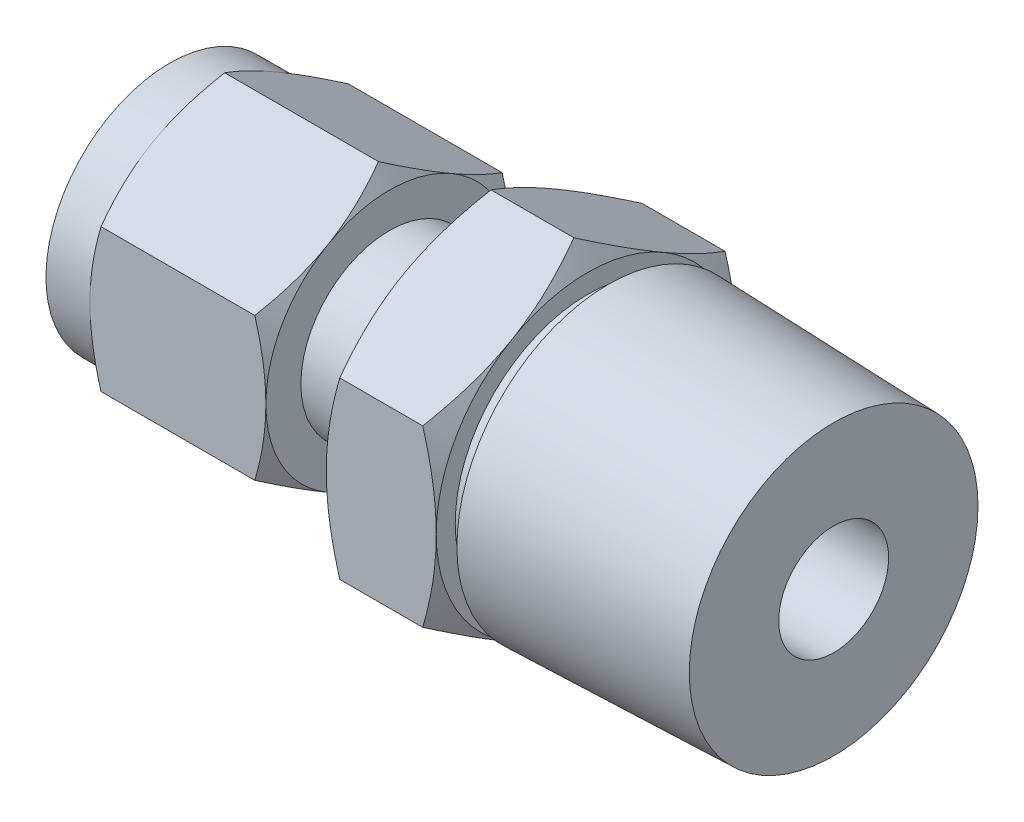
ISO-10303-21;
HEADER;
FILE_DESCRIPTION(('STEP AP214'),'2;1');
FILE_NAME('part.step','',(''),(''),'','','');
FILE_SCHEMA(('AUTOMOTIVE_DESIGN { 1 0 10303 214 1 1 1 1 }'));
ENDSEC;
DATA;
#1=APPLICATION_CONTEXT('core data for automotive mechanical design processes');
#2=APPLICATION_PROTOCOL_DEFINITION('international standard','automotive_design',2000,#1);
#3=PRODUCT_CONTEXT('',#1,'mechanical');
#4=PRODUCT('Part','Part','',(#3));
#5=PRODUCT_RELATED_PRODUCT_CATEGORY('part','',(#4));
#6=PRODUCT_DEFINITION_FORMATION('','',#4);
#7=PRODUCT_DEFINITION_CONTEXT('part definition',#1,'design');
#8=PRODUCT_DEFINITION('design','',#6,#7);
#9=PRODUCT_DEFINITION_SHAPE('','',#8);
#10=(LENGTH_UNIT() NAMED_UNIT(*) SI_UNIT(.MILLI.,.METRE.));
#11=(NAMED_UNIT(*) PLANE_ANGLE_UNIT() SI_UNIT($,.RADIAN.));
#12=(NAMED_UNIT(*) SI_UNIT($,.STERADIAN.) SOLID_ANGLE_UNIT());
#13=UNCERTAINTY_MEASURE_WITH_UNIT(LENGTH_MEASURE(1.E-05),#10,'distance_accuracy_value','');
#14=(GEOMETRIC_REPRESENTATION_CONTEXT(3) GLOBAL_UNCERTAINTY_ASSIGNED_CONTEXT((#13)) GLOBAL_UNIT_ASSIGNED_CONTEXT((#10,
#11,#12)) REPRESENTATION_CONTEXT('',''));
#15=CARTESIAN_POINT('',(0.,0.,0.));
#16=DIRECTION('',(0.,0.,1.));
#17=DIRECTION('',(1.,0.,0.));
#18=AXIS2_PLACEMENT_3D('',#15,#16,#17);
#19=CARTESIAN_POINT('',(-35.814,0.,0.));
#20=DIRECTION('',(1.,0.,0.));
#21=DIRECTION('',(0.,0.,-1.));
#22=AXIS2_PLACEMENT_3D('',#19,#20,#21);
#23=CYLINDRICAL_SURFACE('',#22,2.92099999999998);
#24=CARTESIAN_POINT('',(-7.38378,0.,0.));
#25=DIRECTION('',(1.,0.,0.));
#26=DIRECTION('',(0.,0.,-1.));
#27=AXIS2_PLACEMENT_3D('',#24,#25,#26);
#28=CIRCLE('',#27,2.92099999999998);
#29=CARTESIAN_POINT('',(-7.38378,0.,-2.92099999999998));
#30=VERTEX_POINT('',#29);
#31=EDGE_CURVE('E256',#30,#30,#28,.T.);
#32=ORIENTED_EDGE('',*,*,#31,.T.);
#33=EDGE_LOOP('',(#32));
#34=FACE_BOUND('',#33,.T.);
#35=CARTESIAN_POINT('',(-23.114,0.,0.));
#36=DIRECTION('',(-1.,0.,0.));
#37=DIRECTION('',(0.,0.,1.));
#38=AXIS2_PLACEMENT_3D('',#35,#36,#37);
#39=CIRCLE('',#38,2.92099999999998);
#40=CARTESIAN_POINT('',(-23.114,0.,2.92099999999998));
#41=VERTEX_POINT('',#40);
#42=EDGE_CURVE('E45',#41,#41,#39,.F.);
#43=ORIENTED_EDGE('',*,*,#42,.F.);
#44=EDGE_LOOP('',(#43));
#45=FACE_BOUND('',#44,.T.);
#46=ADVANCED_FACE('F40',(#34,#45),#23,.F.);
#47=CARTESIAN_POINT('',(-35.814,-4.12444598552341,7.14375));
#48=DIRECTION('',(0.,-0.866025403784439,0.5));
#49=DIRECTION('',(0.,-0.5,-0.866025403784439));
#50=AXIS2_PLACEMENT_3D('',#47,#48,#49);
#51=PLANE('',#50);
#52=DIRECTION('',(1.,0.,0.));
#53=VECTOR('',#52,1.);
#54=CARTESIAN_POINT('',(-35.814,-8.2488919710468,0.));
#55=LINE('',#54,#53);
#56=CARTESIAN_POINT('',(-35.1759459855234,-8.2488919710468,0.));
#57=VERTEX_POINT('',#56);
#58=CARTESIAN_POINT('',(-26.2920540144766,-8.2488919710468,0.));
#59=VERTEX_POINT('',#58);
#60=EDGE_CURVE('E565',#57,#59,#55,.T.);
#61=ORIENTED_EDGE('',*,*,#60,.T.);
#62=CARTESIAN_POINT('',(-28.985039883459,-11.5653222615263,-5.74422576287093));
#63=CARTESIAN_POINT('',(-28.8348902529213,-11.4091805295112,-5.47378034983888));
#64=CARTESIAN_POINT('',(-28.6862898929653,-11.2526591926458,-5.20267744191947));
#65=CARTESIAN_POINT('',(-28.3930774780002,-10.9386515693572,-4.65880028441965));
#66=CARTESIAN_POINT('',(-28.2484661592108,-10.7811651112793,-4.3860257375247));
#67=CARTESIAN_POINT('',(-27.9633196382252,-10.4641250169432,-3.83689618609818));
#68=CARTESIAN_POINT('',(-27.8228142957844,-10.3045646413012,-3.56052950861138));
#69=CARTESIAN_POINT('',(-27.5481057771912,-9.98409850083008,-3.00546587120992));
#70=CARTESIAN_POINT('',(-27.4139022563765,-9.82319281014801,-2.72676903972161));
#71=CARTESIAN_POINT('',(-27.1522356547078,-9.49821248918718,-2.16388661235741));
#72=CARTESIAN_POINT('',(-27.024849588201,-9.33412226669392,-1.87967400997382));
#73=CARTESIAN_POINT('',(-26.7805146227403,-9.00397489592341,-1.30784198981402));
#74=CARTESIAN_POINT('',(-26.6635669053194,-8.83791752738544,-1.02022219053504));
#75=CARTESIAN_POINT('',(-26.4433848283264,-8.50394218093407,-0.441759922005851));
#76=CARTESIAN_POINT('',(-26.3401196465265,-8.3360293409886,-0.150926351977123));
#77=CARTESIAN_POINT('',(-26.15077059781,-7.99782913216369,0.434853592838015));
#78=CARTESIAN_POINT('',(-26.0646811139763,-7.82754255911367,0.729798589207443));
#79=CARTESIAN_POINT('',(-25.9139676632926,-7.48441603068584,1.32411116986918));
#80=CARTESIAN_POINT('',(-25.849359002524,-7.31157434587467,1.62348174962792));
#81=CARTESIAN_POINT('',(-25.7718904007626,-7.05087050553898,2.07503404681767));
#82=CARTESIAN_POINT('',(-25.7493066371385,-6.96371787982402,2.22598682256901));
#83=CARTESIAN_POINT('',(-25.7110673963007,-6.78903618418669,2.52854439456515));
#84=CARTESIAN_POINT('',(-25.6954112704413,-6.70150715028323,2.68014912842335));
#85=CARTESIAN_POINT('',(-25.6714404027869,-6.52669308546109,2.98293597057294));
#86=CARTESIAN_POINT('',(-25.6630847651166,-6.43940946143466,3.13411564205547));
#87=CARTESIAN_POINT('',(-25.6537552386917,-6.26474409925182,3.43664492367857));
#88=CARTESIAN_POINT('',(-25.6527812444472,-6.17736236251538,3.58799453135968));
#89=CARTESIAN_POINT('',(-25.658237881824,-6.00267917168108,3.89055469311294));
#90=CARTESIAN_POINT('',(-25.6646666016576,-5.91537770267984,4.04176527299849));
#91=CARTESIAN_POINT('',(-25.6847748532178,-5.74098244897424,4.34382671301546));
#92=CARTESIAN_POINT('',(-25.6984548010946,-5.65388867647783,4.49467755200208));
#93=CARTESIAN_POINT('',(-25.7407036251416,-5.43986877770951,4.86537089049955));
#94=CARTESIAN_POINT('',(-25.7732315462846,-5.31313450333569,5.08488109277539));
#95=CARTESIAN_POINT('',(-25.8517851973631,-5.0607210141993,5.52207408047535));
#96=CARTESIAN_POINT('',(-25.8978130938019,-4.93504197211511,5.73975656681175));
#97=CARTESIAN_POINT('',(-26.0538230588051,-4.55933716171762,6.39049638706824));
#98=CARTESIAN_POINT('',(-26.1816207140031,-4.31114273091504,6.82038175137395));
#99=CARTESIAN_POINT('',(-26.4004011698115,-3.94006918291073,7.46309998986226));
#100=CARTESIAN_POINT('',(-26.4788471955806,-3.81523292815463,7.67932272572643));
#101=CARTESIAN_POINT('',(-26.6431715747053,-3.56676599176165,8.10968008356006));
#102=CARTESIAN_POINT('',(-26.7290505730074,-3.44313541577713,8.32381452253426));
#103=CARTESIAN_POINT('',(-26.9064307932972,-3.1976995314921,8.74892194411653));
#104=CARTESIAN_POINT('',(-26.9978969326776,-3.07588782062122,8.95990601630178));
#105=CARTESIAN_POINT('',(-27.1858730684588,-2.83328630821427,9.38010416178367));
#106=CARTESIAN_POINT('',(-27.2823813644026,-2.71249617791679,9.58931880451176));
#107=CARTESIAN_POINT('',(-27.3809326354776,-2.59213384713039,9.79779247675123));
#108=B_SPLINE_CURVE_WITH_KNOTS('',3,(#62,#63,#64,#65,#66,#67,#68,#69,#70,#71,#72,#73,#74,#75,
#76,#77,#78,#79,#80,#81,#82,#83,#84,#85,#86,#87,#88,#89,#90,#91,#92,#93,#94,#95,#96,#97,#98,#99,
#100,#101,#102,#103,#104,#105,#106,#107),.UNSPECIFIED.,.F.,.F.,(4,2,2,2,2,2,2,2,2,2,2,2,2,2,2,2,
2,2,2,2,2,2,4),(0.,1.03953067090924,2.0792519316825,3.12524674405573,4.17118428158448,
5.22715585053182,6.28324679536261,7.33691673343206,8.39024152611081,9.44431526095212,
9.97148564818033,10.4986066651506,11.0227555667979,11.546896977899,12.0709030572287,
12.5949392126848,13.3611413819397,14.1274665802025,15.6631162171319,16.4481792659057,
17.2333105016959,18.0139372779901,18.7943024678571),.UNSPECIFIED.);
#109=CARTESIAN_POINT('',(-25.654,-6.18666897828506,3.57187499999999));
#110=VERTEX_POINT('',#109);
#111=EDGE_CURVE('E65',#59,#110,#108,.T.);
#112=ORIENTED_EDGE('',*,*,#111,.T.);
#113=CARTESIAN_POINT('',(-26.2920540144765,-4.12444598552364,7.14375));
#114=VERTEX_POINT('',#113);
#115=EDGE_CURVE('E474',#110,#114,#108,.T.);
#116=ORIENTED_EDGE('',*,*,#115,.T.);
#117=DIRECTION('',(1.,0.,0.));
#118=VECTOR('',#117,1.);
#119=CARTESIAN_POINT('',(-35.814,-4.12444598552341,7.14375));
#120=LINE('',#119,#118);
#121=CARTESIAN_POINT('',(-35.1759459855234,-4.12444598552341,7.14375));
#122=VERTEX_POINT('',#121);
#123=EDGE_CURVE('E579',#122,#114,#120,.T.);
#124=ORIENTED_EDGE('',*,*,#123,.F.);
#125=CARTESIAN_POINT('',(-32.4368239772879,-11.6132202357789,-5.82718748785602));
#126=CARTESIAN_POINT('',(-32.5893011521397,-11.4550844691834,-5.55328830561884));
#127=CARTESIAN_POINT('',(-32.7402215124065,-11.2965661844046,-5.2787265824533));
#128=CARTESIAN_POINT('',(-33.0380437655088,-10.978554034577,-4.72791338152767));
#129=CARTESIAN_POINT('',(-33.1849449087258,-10.8190599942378,-4.45166160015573));
#130=CARTESIAN_POINT('',(-33.4746631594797,-10.4979506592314,-3.89548391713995));
#131=CARTESIAN_POINT('',(-33.6174492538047,-10.3363283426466,-3.61554585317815));
#132=CARTESIAN_POINT('',(-33.8966421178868,-10.0117174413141,-3.05330327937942));
#133=CARTESIAN_POINT('',(-34.0330492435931,-9.84872893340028,-2.7709989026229));
#134=CARTESIAN_POINT('',(-34.2990518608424,-9.51949890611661,-2.20075576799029));
#135=CARTESIAN_POINT('',(-34.4285674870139,-9.35324116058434,-1.91278890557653));
#136=CARTESIAN_POINT('',(-34.6769686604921,-9.01871460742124,-1.33337191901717));
#137=CARTESIAN_POINT('',(-34.7958529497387,-8.85044556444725,-1.04192138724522));
#138=CARTESIAN_POINT('',(-35.0195981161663,-8.5120086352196,-0.45573143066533));
#139=CARTESIAN_POINT('',(-35.1244915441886,-8.34184619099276,-0.161001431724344));
#140=CARTESIAN_POINT('',(-35.3166567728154,-7.99908293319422,0.432681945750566));
#141=CARTESIAN_POINT('',(-35.4039345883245,-7.82648297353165,0.731633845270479));
#142=CARTESIAN_POINT('',(-35.5553622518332,-7.48104469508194,1.32995049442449));
#143=CARTESIAN_POINT('',(-35.6197976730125,-7.30823856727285,1.62925948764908));
#144=CARTESIAN_POINT('',(-35.6969986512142,-7.04759160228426,2.08071327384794));
#145=CARTESIAN_POINT('',(-35.7194919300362,-6.96045832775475,2.23163253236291));
#146=CARTESIAN_POINT('',(-35.7575491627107,-6.78581699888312,2.53412018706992));
#147=CARTESIAN_POINT('',(-35.7731137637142,-6.69830898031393,2.68568852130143));
#148=CARTESIAN_POINT('',(-35.7969019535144,-6.52354591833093,2.98838702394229));
#149=CARTESIAN_POINT('',(-35.8051670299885,-6.43629229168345,3.13951473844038));
#150=CARTESIAN_POINT('',(-35.8143195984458,-6.26168882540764,3.44193681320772));
#151=CARTESIAN_POINT('',(-35.8152071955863,-6.17433898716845,3.59323117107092));
#152=CARTESIAN_POINT('',(-35.8095839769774,-5.99972119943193,3.89567805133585));
#153=CARTESIAN_POINT('',(-35.8030750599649,-5.91245323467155,4.04683060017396));
#154=CARTESIAN_POINT('',(-35.7828142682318,-5.7381264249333,4.34877349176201));
#155=CARTESIAN_POINT('',(-35.7690619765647,-5.6510675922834,4.49956381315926));
#156=CARTESIAN_POINT('',(-35.7266179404,-5.43699264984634,4.87035249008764));
#157=CARTESIAN_POINT('',(-35.6939556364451,-5.31016980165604,5.09001610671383));
#158=CARTESIAN_POINT('',(-35.6151254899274,-5.05758271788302,5.52750976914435));
#159=CARTESIAN_POINT('',(-35.5689554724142,-4.93181865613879,5.74533951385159));
#160=CARTESIAN_POINT('',(-35.4125150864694,-4.55586269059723,6.39651434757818));
#161=CARTESIAN_POINT('',(-35.2844256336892,-4.30750645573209,6.82667996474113));
#162=CARTESIAN_POINT('',(-35.0652030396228,-3.93617433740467,7.46984606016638));
#163=CARTESIAN_POINT('',(-34.9866008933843,-3.81123973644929,7.68623913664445));
#164=CARTESIAN_POINT('',(-34.8219661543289,-3.56257714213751,8.11693538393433));
#165=CARTESIAN_POINT('',(-34.7359329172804,-3.43884925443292,8.33123837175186));
#166=CARTESIAN_POINT('',(-34.5582481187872,-3.19322019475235,8.75668038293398));
#167=CARTESIAN_POINT('',(-34.4666316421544,-3.07131261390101,8.96783050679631));
#168=CARTESIAN_POINT('',(-34.278357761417,-2.82851956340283,9.3883604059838));
#169=CARTESIAN_POINT('',(-34.1817020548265,-2.70763376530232,9.5977407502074));
#170=CARTESIAN_POINT('',(-34.0830049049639,-2.58717572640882,9.80638019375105));
#171=B_SPLINE_CURVE_WITH_KNOTS('',3,(#125,#126,#127,#128,#129,#130,#131,#132,#133,#134,#135,
#136,#137,#138,#139,#140,#141,#142,#143,#144,#145,#146,#147,#148,#149,#150,#151,#152,#153,#154,
#155,#156,#157,#158,#159,#160,#161,#162,#163,#164,#165,#166,#167,#168,#169,#170),.UNSPECIFIED.,
.F.,.F.,(4,2,2,2,2,2,2,2,2,2,2,2,2,2,2,2,2,2,2,2,2,2,4),(0.,1.05333984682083,2.10687482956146,
3.16694981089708,4.22696556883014,5.29737068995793,6.36790231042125,7.4358981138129,
8.50352862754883,9.55729736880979,10.0843176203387,10.6112886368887,11.1352449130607,
11.6591937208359,12.1830080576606,12.7068525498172,13.473632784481,14.2405365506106,
15.7773460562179,16.5631126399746,17.3489474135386,18.1302713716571,18.91133381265),.UNSPECIFIED.);
#172=CARTESIAN_POINT('',(-35.814,-6.18666897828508,3.571875));
#173=VERTEX_POINT('',#172);
#174=EDGE_CURVE('E534',#122,#173,#171,.F.);
#175=ORIENTED_EDGE('',*,*,#174,.T.);
#176=EDGE_CURVE('E528',#173,#57,#171,.F.);
#177=ORIENTED_EDGE('',*,*,#176,.T.);
#178=EDGE_LOOP('',(#61,#112,#116,#124,#175,#177));
#179=FACE_BOUND('',#178,.T.);
#180=ADVANCED_FACE('F42',(#179),#51,.T.);
#181=CARTESIAN_POINT('',(-35.814,4.12444598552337,7.14374999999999));
#182=DIRECTION('',(0.,0.,1.));
#183=DIRECTION('',(0.,-1.,0.));
#184=AXIS2_PLACEMENT_3D('',#181,#182,#183);
#185=PLANE('',#184);
#186=ORIENTED_EDGE('',*,*,#123,.T.);
#187=CARTESIAN_POINT('',(-29.2452892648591,-11.2944476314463,7.14375));
#188=CARTESIAN_POINT('',(-29.0921529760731,-10.980523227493,7.14375));
#189=CARTESIAN_POINT('',(-28.9404240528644,-10.6659008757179,7.14375));
#190=CARTESIAN_POINT('',(-28.6405685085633,-10.0348898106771,7.14375));
#191=CARTESIAN_POINT('',(-28.492442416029,-9.71850084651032,7.14375));
#192=CARTESIAN_POINT('',(-28.1998805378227,-9.08205742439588,7.14375));
#193=CARTESIAN_POINT('',(-28.0554674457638,-8.76199250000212,7.14375));
#194=CARTESIAN_POINT('',(-27.7722709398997,-8.11939095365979,7.14375));
#195=CARTESIAN_POINT('',(-27.6334872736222,-7.79685444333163,7.14375));
#196=CARTESIAN_POINT('',(-27.3583837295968,-7.13766603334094,7.14375));
#197=CARTESIAN_POINT('',(-27.222312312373,-6.80090988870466,7.14375));
#198=CARTESIAN_POINT('',(-26.9599553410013,-6.12353918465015,7.14375));
#199=CARTESIAN_POINT('',(-26.8336708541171,-5.78292420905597,7.14375));
#200=CARTESIAN_POINT('',(-26.5940456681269,-5.09786024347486,7.14375));
#201=CARTESIAN_POINT('',(-26.480680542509,-4.75341988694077,7.14375));
#202=CARTESIAN_POINT('',(-26.2703870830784,-4.05961513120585,7.14375));
#203=CARTESIAN_POINT('',(-26.173453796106,-3.71025225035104,7.14375));
#204=CARTESIAN_POINT('',(-26.0010527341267,-3.00829070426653,7.14375));
#205=CARTESIAN_POINT('',(-25.9254631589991,-2.65572276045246,7.14375));
#206=CARTESIAN_POINT('',(-25.8312526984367,-2.12349462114,7.14375));
#207=CARTESIAN_POINT('',(-25.8030436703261,-1.94551103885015,7.14375));
#208=CARTESIAN_POINT('',(-25.7535643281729,-1.58858869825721,7.14375));
#209=CARTESIAN_POINT('',(-25.7322933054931,-1.40965003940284,7.14375));
#210=CARTESIAN_POINT('',(-25.6973920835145,-1.0534873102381,7.14375));
#211=CARTESIAN_POINT('',(-25.6836617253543,-0.876273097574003,7.14375));
#212=CARTESIAN_POINT('',(-25.6637152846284,-0.521422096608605,7.14375));
#213=CARTESIAN_POINT('',(-25.6574990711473,-0.343785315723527,7.14375));
#214=CARTESIAN_POINT('',(-25.6527302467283,0.011593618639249,7.14375));
#215=CARTESIAN_POINT('',(-25.6541776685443,0.18933577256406,7.14375));
#216=CARTESIAN_POINT('',(-25.6646985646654,0.54459618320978,7.14375));
#217=CARTESIAN_POINT('',(-25.673772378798,0.722114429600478,7.14375));
#218=CARTESIAN_POINT('',(-25.704080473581,1.1423167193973,7.14375));
#219=CARTESIAN_POINT('',(-25.7285750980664,1.38477115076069,7.14375));
#220=CARTESIAN_POINT('',(-25.7905020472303,1.86800860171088,7.14375));
#221=CARTESIAN_POINT('',(-25.8279359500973,2.10879141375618,7.14374999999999));
#222=CARTESIAN_POINT('',(-25.9576719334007,2.82827839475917,7.14374999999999));
#223=CARTESIAN_POINT('',(-26.0673893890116,3.30389105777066,7.14374999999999));
#224=CARTESIAN_POINT('',(-26.2593162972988,4.01550297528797,7.14374999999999));
#225=CARTESIAN_POINT('',(-26.3288123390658,4.25514453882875,7.14374999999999));
#226=CARTESIAN_POINT('',(-26.4754363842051,4.73210449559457,7.14374999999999));
#227=CARTESIAN_POINT('',(-26.5525644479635,4.96942287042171,7.14374999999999));
#228=CARTESIAN_POINT('',(-26.7131810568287,5.44180613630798,7.14374999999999));
#229=CARTESIAN_POINT('',(-26.7966678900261,5.67687161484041,7.14374999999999));
#230=CARTESIAN_POINT('',(-26.9689785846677,6.14502502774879,7.14374999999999));
#231=CARTESIAN_POINT('',(-27.0578023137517,6.37811301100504,7.14374999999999));
#232=CARTESIAN_POINT('',(-27.3080518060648,7.01633973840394,7.14374999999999));
#233=CARTESIAN_POINT('',(-27.4740598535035,7.41968024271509,7.14374999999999));
#234=CARTESIAN_POINT('',(-27.8161253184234,8.22209356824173,7.14374999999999));
#235=CARTESIAN_POINT('',(-27.9921839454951,8.62116586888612,7.14374999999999));
#236=CARTESIAN_POINT('',(-28.3519243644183,9.41604680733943,7.14374999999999));
#237=CARTESIAN_POINT('',(-28.5356092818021,9.81185402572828,7.14374999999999));
#238=CARTESIAN_POINT('',(-28.9087402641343,10.6007123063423,7.14374999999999));
#239=CARTESIAN_POINT('',(-29.0981860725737,10.9937634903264,7.14374999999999));
#240=CARTESIAN_POINT('',(-29.4818868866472,11.7783334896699,7.14374999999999));
#241=CARTESIAN_POINT('',(-29.6761495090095,12.1698485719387,7.14374999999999));
#242=CARTESIAN_POINT('',(-30.0682272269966,12.951097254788,7.14374999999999));
#243=CARTESIAN_POINT('',(-30.2660423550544,13.3408308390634,7.14374999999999));
#244=CARTESIAN_POINT('',(-30.6644682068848,14.1187472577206,7.14374999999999));
#245=CARTESIAN_POINT('',(-30.8650782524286,14.5069304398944,7.14374999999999));
#246=CARTESIAN_POINT('',(-31.2686086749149,15.2820947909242,7.14374999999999));
#247=CARTESIAN_POINT('',(-31.471529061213,15.6690759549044,7.14374999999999));
#248=CARTESIAN_POINT('',(-32.0386526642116,16.744223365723,7.14374999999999));
#249=CARTESIAN_POINT('',(-32.4049082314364,17.4313067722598,7.14374999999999));
#250=CARTESIAN_POINT('',(-33.141764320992,18.8031936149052,7.14374999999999));
#251=CARTESIAN_POINT('',(-33.5123651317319,19.4879968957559,7.14374999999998));
#252=CARTESIAN_POINT('',(-34.2554798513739,20.853450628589,7.14374999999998));
#253=CARTESIAN_POINT('',(-34.6279824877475,21.5341072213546,7.14374999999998));
#254=CARTESIAN_POINT('',(-35.3754448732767,22.8939962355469,7.14374999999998));
#255=CARTESIAN_POINT('',(-35.7504044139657,23.5732287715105,7.14374999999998));
#256=CARTESIAN_POINT('',(-36.1262540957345,24.2519647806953,7.14374999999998));
#257=B_SPLINE_CURVE_WITH_KNOTS('',3,(#187,#188,#189,#190,#191,#192,#193,#194,#195,#196,#197,
#198,#199,#200,#201,#202,#203,#204,#205,#206,#207,#208,#209,#210,#211,#212,#213,#214,#215,#216,
#217,#218,#219,#220,#221,#222,#223,#224,#225,#226,#227,#228,#229,#230,#231,#232,#233,#234,#235,
#236,#237,#238,#239,#240,#241,#242,#243,#244,#245,#246,#247,#248,#249,#250,#251,#252,#253,#254,
#255,#256),.UNSPECIFIED.,.F.,.F.,(4,2,2,2,2,2,2,2,2,2,2,2,2,2,2,2,2,2,2,2,2,2,2,2,2,2,2,2,2,2,2,
2,2,2,4),(0.,1.04786354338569,2.09587989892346,3.14924522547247,4.20256325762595,
5.2920693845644,6.38169415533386,7.46922335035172,8.55642413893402,9.63728917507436,
10.1777908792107,10.7182373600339,11.2513201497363,11.784393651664,12.3174694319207,
12.8505689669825,13.5812265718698,14.3119733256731,15.7741561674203,16.5226327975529,
17.2711153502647,18.0193971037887,18.7676603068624,20.0759569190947,21.3844113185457,
22.6934073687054,24.0023452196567,25.3135046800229,26.6246761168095,27.9355347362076,
29.2463986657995,31.5821913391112,33.9181399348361,36.2458936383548,38.573452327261),.UNSPECIFIED.);
#258=CARTESIAN_POINT('',(-25.654,0.,7.14374999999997));
#259=VERTEX_POINT('',#258);
#260=EDGE_CURVE('E467',#114,#259,#257,.T.);
#261=ORIENTED_EDGE('',*,*,#260,.T.);
#262=CARTESIAN_POINT('',(-26.2920540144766,4.12444598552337,7.14374999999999));
#263=VERTEX_POINT('',#262);
#264=EDGE_CURVE('E460',#259,#263,#257,.T.);
#265=ORIENTED_EDGE('',*,*,#264,.T.);
#266=DIRECTION('',(1.,0.,0.));
#267=VECTOR('',#266,1.);
#268=CARTESIAN_POINT('',(-35.814,4.12444598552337,7.14374999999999));
#269=LINE('',#268,#267);
#270=CARTESIAN_POINT('',(-35.1759459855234,4.12444598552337,7.14374999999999));
#271=VERTEX_POINT('',#270);
#272=EDGE_CURVE('E616',#271,#263,#269,.T.);
#273=ORIENTED_EDGE('',*,*,#272,.F.);
#274=CARTESIAN_POINT('',(-32.3357928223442,-11.0619998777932,7.14375));
#275=CARTESIAN_POINT('',(-32.4870094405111,-10.7501315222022,7.14375));
#276=CARTESIAN_POINT('',(-32.6367712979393,-10.4375454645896,7.14375));
#277=CARTESIAN_POINT('',(-32.9325669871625,-9.81055620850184,7.14375));
#278=CARTESIAN_POINT('',(-33.0786002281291,-9.49615273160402,7.14375));
#279=CARTESIAN_POINT('',(-33.3668584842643,-8.86351888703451,7.14375));
#280=CARTESIAN_POINT('',(-33.5090582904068,-8.545276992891,7.14375));
#281=CARTESIAN_POINT('',(-33.7876163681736,-7.90625626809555,7.14375));
#282=CARTESIAN_POINT('',(-33.9239749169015,-7.58547755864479,7.14375));
#283=CARTESIAN_POINT('',(-34.1935482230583,-6.93057093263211,7.14375));
#284=CARTESIAN_POINT('',(-34.3265234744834,-6.5963438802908,7.14375));
#285=CARTESIAN_POINT('',(-34.5823692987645,-5.92397412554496,7.14375));
#286=CARTESIAN_POINT('',(-34.7052387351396,-5.5858309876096,7.14375));
#287=CARTESIAN_POINT('',(-34.9376346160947,-4.90572540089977,7.14375));
#288=CARTESIAN_POINT('',(-35.0471882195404,-4.56377233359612,7.14375));
#289=CARTESIAN_POINT('',(-35.2494273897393,-3.87497338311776,7.14375));
#290=CARTESIAN_POINT('',(-35.3421182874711,-3.52812908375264,7.14375));
#291=CARTESIAN_POINT('',(-35.5056727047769,-2.83122175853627,7.14375));
#292=CARTESIAN_POINT('',(-35.5766543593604,-2.48118722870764,7.14375));
#293=CARTESIAN_POINT('',(-35.6637650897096,-1.95296127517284,7.14375));
#294=CARTESIAN_POINT('',(-35.6895762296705,-1.77634379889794,7.14375));
#295=CARTESIAN_POINT('',(-35.7342379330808,-1.42223667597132,7.14375));
#296=CARTESIAN_POINT('',(-35.7530891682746,-1.24474711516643,7.14375));
#297=CARTESIAN_POINT('',(-35.7832199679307,-0.891444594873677,7.14375));
#298=CARTESIAN_POINT('',(-35.7945946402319,-0.715639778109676,7.14375));
#299=CARTESIAN_POINT('',(-35.8099005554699,-0.36370677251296,7.14375));
#300=CARTESIAN_POINT('',(-35.8138319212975,-0.187578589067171,7.14375));
#301=CARTESIAN_POINT('',(-35.8141574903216,0.164686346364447,7.14375));
#302=CARTESIAN_POINT('',(-35.8105516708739,0.340823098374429,7.14375));
#303=CARTESIAN_POINT('',(-35.7958907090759,0.692788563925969,7.14375));
#304=CARTESIAN_POINT('',(-35.7848351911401,0.868617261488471,7.14375));
#305=CARTESIAN_POINT('',(-35.7495029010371,1.29170712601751,7.14375));
#306=CARTESIAN_POINT('',(-35.7216625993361,1.53867692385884,7.14375));
#307=CARTESIAN_POINT('',(-35.652807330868,2.03076077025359,7.14375));
#308=CARTESIAN_POINT('',(-35.6117905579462,2.27587455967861,7.14374999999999));
#309=CARTESIAN_POINT('',(-35.4711524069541,3.00816528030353,7.14374999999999));
#310=CARTESIAN_POINT('',(-35.3539695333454,3.49201283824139,7.14374999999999));
#311=CARTESIAN_POINT('',(-35.1510528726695,4.21544835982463,7.14374999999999));
#312=CARTESIAN_POINT('',(-35.0779558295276,4.45879640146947,7.14374999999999));
#313=CARTESIAN_POINT('',(-34.924240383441,4.94312854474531,7.14374999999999));
#314=CARTESIAN_POINT('',(-34.8436219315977,5.18411263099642,7.14374999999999));
#315=CARTESIAN_POINT('',(-34.6761512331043,5.66379378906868,7.14374999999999));
#316=CARTESIAN_POINT('',(-34.5893010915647,5.90249160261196,7.14374999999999));
#317=CARTESIAN_POINT('',(-34.4103817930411,6.37791459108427,7.14374999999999));
#318=CARTESIAN_POINT('',(-34.3183126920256,6.61463978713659,7.14374999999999));
#319=CARTESIAN_POINT('',(-34.0983856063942,7.1650089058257,7.14374999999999));
#320=CARTESIAN_POINT('',(-33.9688327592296,7.47797422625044,7.14374999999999));
#321=CARTESIAN_POINT('',(-33.7035984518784,8.10130467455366,7.14374999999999));
#322=CARTESIAN_POINT('',(-33.5679166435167,8.41166965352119,7.14374999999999));
#323=CARTESIAN_POINT('',(-33.2916308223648,9.03026595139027,7.14374999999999));
#324=CARTESIAN_POINT('',(-33.1510258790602,9.33849685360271,7.14374999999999));
#325=CARTESIAN_POINT('',(-32.8658592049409,9.95312610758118,7.14374999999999));
#326=CARTESIAN_POINT('',(-32.7212973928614,10.2595244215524,7.14374999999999));
#327=CARTESIAN_POINT('',(-32.4287994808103,10.8710890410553,7.14374999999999));
#328=CARTESIAN_POINT('',(-32.280860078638,11.1762537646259,7.14374999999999));
#329=CARTESIAN_POINT('',(-31.9823141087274,11.7852769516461,7.14374999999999));
#330=CARTESIAN_POINT('',(-31.8317075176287,12.0891354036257,7.14374999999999));
#331=CARTESIAN_POINT('',(-31.3766223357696,12.9989813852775,7.14374999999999));
#332=CARTESIAN_POINT('',(-31.068841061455,13.6033168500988,7.14374999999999));
#333=CARTESIAN_POINT('',(-30.4724456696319,14.7595313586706,7.14374999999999));
#334=CARTESIAN_POINT('',(-30.1843193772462,15.3116631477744,7.14374999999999));
#335=CARTESIAN_POINT('',(-29.6040915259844,16.4138558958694,7.14374999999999));
#336=CARTESIAN_POINT('',(-29.311989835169,16.9639167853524,7.14374999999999));
#337=CARTESIAN_POINT('',(-28.725456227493,18.0610962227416,7.14374999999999));
#338=CARTESIAN_POINT('',(-28.4310315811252,18.6082186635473,7.14374999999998));
#339=CARTESIAN_POINT('',(-27.8397935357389,19.7011342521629,7.14374999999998));
#340=CARTESIAN_POINT('',(-27.5429802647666,20.2469274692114,7.14374999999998));
#341=CARTESIAN_POINT('',(-27.2452725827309,20.7922290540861,7.14374999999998));
#342=B_SPLINE_CURVE_WITH_KNOTS('',3,(#274,#275,#276,#277,#278,#279,#280,#281,#282,#283,#284,
#285,#286,#287,#288,#289,#290,#291,#292,#293,#294,#295,#296,#297,#298,#299,#300,#301,#302,#303,
#304,#305,#306,#307,#308,#309,#310,#311,#312,#313,#314,#315,#316,#317,#318,#319,#320,#321,#322,
#323,#324,#325,#326,#327,#328,#329,#330,#331,#332,#333,#334,#335,#336,#337,#338,#339,#340,#341),
.UNSPECIFIED.,.F.,.F.,(4,2,2,2,2,2,2,2,2,2,2,2,2,2,2,2,2,2,2,2,2,2,2,2,2,2,2,2,2,2,2,2,2,4),(0.,
1.03979882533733,2.07976140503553,3.12541423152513,4.17101739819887,5.25001583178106,
6.32913544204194,7.4060157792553,8.48255507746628,9.55312744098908,10.088492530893,
10.6238059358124,11.1521706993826,11.6805267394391,12.208884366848,12.7372686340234,
13.4824492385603,14.2277320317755,15.719133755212,16.4813393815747,17.2435499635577,
18.0055042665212,18.7674503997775,19.7835233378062,20.7996540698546,21.815977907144,
22.8323226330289,23.8497076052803,24.8671014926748,26.9016318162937,28.7699818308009,
30.6383940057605,32.50232427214,34.3661552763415),.UNSPECIFIED.);
#343=CARTESIAN_POINT('',(-35.814,0.,7.14375));
#344=VERTEX_POINT('',#343);
#345=EDGE_CURVE('E639',#271,#344,#342,.F.);
#346=ORIENTED_EDGE('',*,*,#345,.T.);
#347=EDGE_CURVE('E453',#344,#122,#342,.F.);
#348=ORIENTED_EDGE('',*,*,#347,.T.);
#349=EDGE_LOOP('',(#186,#261,#265,#273,#346,#348));
#350=FACE_BOUND('',#349,.T.);
#351=ADVANCED_FACE('F431',(#350),#185,.T.);
#352=CARTESIAN_POINT('',(-35.814,8.24889197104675,0.));
#353=DIRECTION('',(0.,0.866025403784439,0.499999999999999));
#354=DIRECTION('',(0.,-0.499999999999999,0.866025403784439));
#355=AXIS2_PLACEMENT_3D('',#352,#353,#354);
#356=PLANE('',#355);
#357=ORIENTED_EDGE('',*,*,#272,.T.);
#358=CARTESIAN_POINT('',(-26.3776496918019,3.97992187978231,7.39407309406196));
#359=CARTESIAN_POINT('',(-26.2609218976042,4.17222802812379,7.06098907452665));
#360=CARTESIAN_POINT('',(-26.1541377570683,4.36633328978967,6.72478889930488));
#361=CARTESIAN_POINT('',(-25.9667811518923,4.75828985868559,6.04590020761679));
#362=CARTESIAN_POINT('',(-25.8862920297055,4.95615101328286,5.70319463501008));
#363=CARTESIAN_POINT('',(-25.791485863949,5.2521027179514,5.19059124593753));
#364=CARTESIAN_POINT('',(-25.764426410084,5.3491691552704,5.02246724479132));
#365=CARTESIAN_POINT('',(-25.7188244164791,5.54380656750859,4.68534535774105));
#366=CARTESIAN_POINT('',(-25.7002819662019,5.64137754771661,4.51634746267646));
#367=CARTESIAN_POINT('',(-25.6722429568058,5.83668876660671,4.17805850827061));
#368=CARTESIAN_POINT('',(-25.6627318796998,5.93442847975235,4.00876835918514));
#369=CARTESIAN_POINT('',(-25.6529754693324,6.13002408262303,3.66998683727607));
#370=CARTESIAN_POINT('',(-25.6527301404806,6.22787997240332,3.50049546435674));
#371=CARTESIAN_POINT('',(-25.6617995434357,6.42982711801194,3.15071274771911));
#372=CARTESIAN_POINT('',(-25.6717348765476,6.53391147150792,2.9704333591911));
#373=CARTESIAN_POINT('',(-25.701800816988,6.74171052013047,2.61051484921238));
#374=CARTESIAN_POINT('',(-25.7219317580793,6.84542520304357,2.43087574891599));
#375=CARTESIAN_POINT('',(-25.771821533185,7.05246728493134,2.07226834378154));
#376=CARTESIAN_POINT('',(-25.8015984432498,7.15579358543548,1.89330194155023));
#377=CARTESIAN_POINT('',(-25.8699534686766,7.36171744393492,1.53663135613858));
#378=CARTESIAN_POINT('',(-25.9085322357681,7.46431494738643,1.35892726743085));
#379=CARTESIAN_POINT('',(-25.9949283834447,7.67195170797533,0.999289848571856));
#380=CARTESIAN_POINT('',(-26.043001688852,7.77696416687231,0.817402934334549));
#381=CARTESIAN_POINT('',(-26.1465166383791,7.98608323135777,0.455198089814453));
#382=CARTESIAN_POINT('',(-26.2019590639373,8.090189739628,0.274880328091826));
#383=CARTESIAN_POINT('',(-26.318979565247,8.29706335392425,-0.0834352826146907));
#384=CARTESIAN_POINT('',(-26.3805311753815,8.39983422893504,-0.261439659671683));
#385=CARTESIAN_POINT('',(-26.509080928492,8.60448027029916,-0.615897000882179));
#386=CARTESIAN_POINT('',(-26.5760770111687,8.706355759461,-0.792350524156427));
#387=CARTESIAN_POINT('',(-26.6453790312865,8.80782486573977,-0.968100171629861));
#388=B_SPLINE_CURVE_WITH_KNOTS('',3,(#358,#359,#360,#361,#362,#363,#364,#365,#366,#367,#368,
#369,#370,#371,#372,#373,#374,#375,#376,#377,#378,#379,#380,#381,#382,#383,#384,#385,#386,#387),
.UNSPECIFIED.,.F.,.F.,(4,2,2,2,2,2,2,2,2,2,2,2,2,2,4),(0.,1.20656408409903,2.41691610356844,
3.00477275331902,3.5926355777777,4.17955180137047,4.76646830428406,5.39142184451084,
6.01639584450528,6.64254785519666,7.26874624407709,7.91496391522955,8.56125016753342,
9.20484964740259,9.84820670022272),.UNSPECIFIED.);
#389=CARTESIAN_POINT('',(-25.654,6.18666897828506,3.57187499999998));
#390=VERTEX_POINT('',#389);
#391=EDGE_CURVE('E468',#263,#390,#388,.T.);
#392=ORIENTED_EDGE('',*,*,#391,.T.);
#393=CARTESIAN_POINT('',(-26.2920540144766,8.24889197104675,0.));
#394=VERTEX_POINT('',#393);
#395=EDGE_CURVE('E469',#390,#394,#388,.T.);
#396=ORIENTED_EDGE('',*,*,#395,.T.);
#397=DIRECTION('',(1.,0.,0.));
#398=VECTOR('',#397,1.);
#399=CARTESIAN_POINT('',(-35.814,8.24889197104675,0.));
#400=LINE('',#399,#398);
#401=CARTESIAN_POINT('',(-35.1759459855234,8.24889197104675,0.));
#402=VERTEX_POINT('',#401);
#403=EDGE_CURVE('E568',#402,#394,#400,.T.);
#404=ORIENTED_EDGE('',*,*,#403,.F.);
#405=CARTESIAN_POINT('',(-34.8230581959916,8.8071847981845,-0.966991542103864));
#406=CARTESIAN_POINT('',(-34.8923429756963,8.70572484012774,-0.791257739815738));
#407=CARTESIAN_POINT('',(-34.959321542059,8.60385851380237,-0.614820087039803));
#408=CARTESIAN_POINT('',(-35.0878357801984,8.39923088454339,-0.260394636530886));
#409=CARTESIAN_POINT('',(-35.1493693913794,8.29646925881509,-0.0824062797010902));
#410=CARTESIAN_POINT('',(-35.2663533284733,8.08961447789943,0.275876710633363));
#411=CARTESIAN_POINT('',(-35.3217771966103,7.98551755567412,0.456177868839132));
#412=CARTESIAN_POINT('',(-35.4252548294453,7.776417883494,0.818349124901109));
#413=CARTESIAN_POINT('',(-35.4733093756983,7.67141523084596,1.00021905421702));
#414=CARTESIAN_POINT('',(-35.5596688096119,7.46379776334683,1.35982305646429));
#415=CARTESIAN_POINT('',(-35.5982295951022,7.36120973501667,1.53751073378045));
#416=CARTESIAN_POINT('',(-35.6665490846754,7.15530517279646,1.89414789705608));
#417=CARTESIAN_POINT('',(-35.6963084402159,7.05198869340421,2.07309728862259));
#418=CARTESIAN_POINT('',(-35.7461640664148,6.84496659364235,2.43167008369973));
#419=CARTESIAN_POINT('',(-35.7662784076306,6.74126207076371,2.61129158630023));
#420=CARTESIAN_POINT('',(-35.7963126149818,6.53348374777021,2.97117419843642));
#421=CARTESIAN_POINT('',(-35.8062328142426,6.42940995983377,3.15143528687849));
#422=CARTESIAN_POINT('',(-35.8152756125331,6.22746572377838,3.50121296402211));
#423=CARTESIAN_POINT('',(-35.8150169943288,6.1296021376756,3.67071766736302));
#424=CARTESIAN_POINT('',(-35.805232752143,5.93399147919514,4.00952526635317));
#425=CARTESIAN_POINT('',(-35.7957071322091,5.8362444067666,4.17882816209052));
#426=CARTESIAN_POINT('',(-35.767638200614,5.64091876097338,4.51714210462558));
#427=CARTESIAN_POINT('',(-35.7490803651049,5.54334071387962,4.68615223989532));
#428=CARTESIAN_POINT('',(-35.7034472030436,5.34868949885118,5.0232980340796));
#429=CARTESIAN_POINT('',(-35.6763719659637,5.25161632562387,5.19143370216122));
#430=CARTESIAN_POINT('',(-35.5815173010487,4.95564369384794,5.70407333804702));
#431=CARTESIAN_POINT('',(-35.5009953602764,4.75776881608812,6.0468026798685));
#432=CARTESIAN_POINT('',(-35.3135749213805,4.36578585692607,6.72573708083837));
#433=CARTESIAN_POINT('',(-35.206759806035,4.17166792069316,7.06195920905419));
#434=CARTESIAN_POINT('',(-35.0900026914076,3.97934916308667,7.39506506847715));
#435=B_SPLINE_CURVE_WITH_KNOTS('',3,(#405,#406,#407,#408,#409,#410,#411,#412,#413,#414,#415,
#416,#417,#418,#419,#420,#421,#422,#423,#424,#425,#426,#427,#428,#429,#430,#431,#432,#433,#434),
.UNSPECIFIED.,.F.,.F.,(4,2,2,2,2,2,2,2,2,2,2,2,2,2,4),(0.,0.643288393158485,1.28681920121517,
1.93303553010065,2.57918327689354,3.20531582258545,3.83140201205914,4.45631056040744,
5.0811986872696,5.66816136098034,6.25512377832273,6.84303316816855,7.43093638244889,
8.64138886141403,9.8480510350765),.UNSPECIFIED.);
#436=CARTESIAN_POINT('',(-35.814,6.18666897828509,3.571875));
#437=VERTEX_POINT('',#436);
#438=EDGE_CURVE('E571',#402,#437,#435,.T.);
#439=ORIENTED_EDGE('',*,*,#438,.T.);
#440=EDGE_CURVE('E637',#437,#271,#435,.T.);
#441=ORIENTED_EDGE('',*,*,#440,.T.);
#442=EDGE_LOOP('',(#357,#392,#396,#404,#439,#441));
#443=FACE_BOUND('',#442,.T.);
#444=ADVANCED_FACE('F447',(#443),#356,.T.);
#445=CARTESIAN_POINT('',(-35.814,4.12444598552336,-7.14375));
#446=DIRECTION('',(0.,0.866025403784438,-0.5));
#447=DIRECTION('',(0.,0.5,0.866025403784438));
#448=AXIS2_PLACEMENT_3D('',#445,#446,#447);
#449=PLANE('',#448);
#450=ORIENTED_EDGE('',*,*,#403,.T.);
#451=CARTESIAN_POINT('',(-28.9789299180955,0.8143687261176,-12.8769719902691));
#452=CARTESIAN_POINT('',(-28.8288791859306,0.97046424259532,-12.606606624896));
#453=CARTESIAN_POINT('',(-28.680380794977,1.12693999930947,-12.3355826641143));
#454=CARTESIAN_POINT('',(-28.3873805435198,1.44085811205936,-11.7918605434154));
#455=CARTESIAN_POINT('',(-28.2428794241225,1.59830064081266,-11.5191620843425));
#456=CARTESIAN_POINT('',(-27.9579613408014,1.91525794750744,-10.970175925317));
#457=CARTESIAN_POINT('',(-27.8175744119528,2.07477950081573,-10.6938764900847));
#458=CARTESIAN_POINT('',(-27.543116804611,2.39517009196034,-10.1389437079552));
#459=CARTESIAN_POINT('',(-27.4090457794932,2.55603905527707,-9.8603104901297));
#460=CARTESIAN_POINT('',(-27.1476886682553,2.88091676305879,-9.29760579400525));
#461=CARTESIAN_POINT('',(-27.0204782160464,3.04494080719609,-9.01350781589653));
#462=CARTESIAN_POINT('',(-26.7765135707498,3.37495724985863,-8.44190256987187));
#463=CARTESIAN_POINT('',(-26.6597605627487,3.54094986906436,-8.15439491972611));
#464=CARTESIAN_POINT('',(-26.4399911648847,3.87479487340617,-7.57615841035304));
#465=CARTESIAN_POINT('',(-26.3369437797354,4.04264209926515,-7.2854384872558));
#466=CARTESIAN_POINT('',(-26.1480545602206,4.38070952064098,-6.69988853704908));
#467=CARTESIAN_POINT('',(-26.0622070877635,4.55092891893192,-6.40505989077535));
#468=CARTESIAN_POINT('',(-25.9119969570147,4.89392161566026,-5.81097911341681));
#469=CARTESIAN_POINT('',(-25.8476502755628,5.06669671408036,-5.51172386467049));
#470=CARTESIAN_POINT('',(-25.7705829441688,5.32729433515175,-5.06035554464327));
#471=CARTESIAN_POINT('',(-25.7481343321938,5.41441053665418,-4.90946585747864));
#472=CARTESIAN_POINT('',(-25.710165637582,5.5890168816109,-4.60703879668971));
#473=CARTESIAN_POINT('',(-25.6946449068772,5.67650698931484,-4.45550148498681));
#474=CARTESIAN_POINT('',(-25.6709408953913,5.85124482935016,-4.15284666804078));
#475=CARTESIAN_POINT('',(-25.6627170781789,5.93849118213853,-4.00173155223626));
#476=CARTESIAN_POINT('',(-25.653646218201,6.11307923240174,-3.69933617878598));
#477=CARTESIAN_POINT('',(-25.6527990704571,6.20042092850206,-3.54805592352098));
#478=CARTESIAN_POINT('',(-25.6585014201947,6.3750215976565,-3.24563869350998));
#479=CARTESIAN_POINT('',(-25.6650490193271,6.46228058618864,-3.09450169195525));
#480=CARTESIAN_POINT('',(-25.6853845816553,6.63658872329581,-2.79259114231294));
#481=CARTESIAN_POINT('',(-25.6991729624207,6.72363785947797,-2.64181761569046));
#482=CARTESIAN_POINT('',(-25.7417174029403,6.93776610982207,-2.27093660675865));
#483=CARTESIAN_POINT('',(-25.7744512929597,7.06465119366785,-2.05116519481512));
#484=CARTESIAN_POINT('',(-25.8534322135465,7.31736066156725,-1.61345955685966));
#485=CARTESIAN_POINT('',(-25.899681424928,7.44318487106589,-1.39552563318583));
#486=CARTESIAN_POINT('',(-26.0563661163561,7.81931927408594,-0.74404173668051));
#487=CARTESIAN_POINT('',(-26.1846270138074,8.06779107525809,-0.313675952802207));
#488=CARTESIAN_POINT('',(-26.4040920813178,8.43926607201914,0.329737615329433));
#489=CARTESIAN_POINT('',(-26.482763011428,8.56422972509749,0.546181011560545));
#490=CARTESIAN_POINT('',(-26.6475316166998,8.81295031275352,0.97697770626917));
#491=CARTESIAN_POINT('',(-26.7336299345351,8.93670714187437,1.1913308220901));
#492=CARTESIAN_POINT('',(-26.9114407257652,9.18239357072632,1.61687219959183));
#493=CARTESIAN_POINT('',(-27.0031181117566,9.30432958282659,1.82807156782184));
#494=CARTESIAN_POINT('',(-27.1915107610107,9.54717974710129,2.24870039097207));
#495=CARTESIAN_POINT('',(-27.2882243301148,9.6680942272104,2.45813041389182));
#496=CARTESIAN_POINT('',(-27.3869780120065,9.78858109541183,2.66681979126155));
#497=B_SPLINE_CURVE_WITH_KNOTS('',3,(#451,#452,#453,#454,#455,#456,#457,#458,#459,#460,#461,
#462,#463,#464,#465,#466,#467,#468,#469,#470,#471,#472,#473,#474,#475,#476,#477,#478,#479,#480,
#481,#482,#483,#484,#485,#486,#487,#488,#489,#490,#491,#492,#493,#494,#495,#496),.UNSPECIFIED.,
.F.,.F.,(4,2,2,2,2,2,2,2,2,2,2,2,2,2,2,2,2,2,2,2,2,2,4),(0.,1.03915228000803,2.07849594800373,
3.12413420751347,4.16971501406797,5.22512528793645,6.28065501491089,7.3337555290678,
8.38651027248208,9.4400455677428,9.9669471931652,10.4937995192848,11.017706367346,
11.5416057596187,12.0653706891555,12.58916582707,13.3563434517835,14.1236449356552,
15.6612542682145,16.4472492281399,17.2333122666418,18.0148602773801,18.7961470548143),.UNSPECIFIED.);
#498=CARTESIAN_POINT('',(-25.654,6.18666897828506,-3.57187499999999));
#499=VERTEX_POINT('',#498);
#500=EDGE_CURVE('E511',#394,#499,#497,.F.);
#501=ORIENTED_EDGE('',*,*,#500,.T.);
#502=CARTESIAN_POINT('',(-26.2920540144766,4.12444598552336,-7.14375));
#503=VERTEX_POINT('',#502);
#504=EDGE_CURVE('E506',#499,#503,#497,.F.);
#505=ORIENTED_EDGE('',*,*,#504,.T.);
#506=DIRECTION('',(1.,0.,0.));
#507=VECTOR('',#506,1.);
#508=CARTESIAN_POINT('',(-35.814,4.12444598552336,-7.14375));
#509=LINE('',#508,#507);
#510=CARTESIAN_POINT('',(-35.1759459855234,4.12444598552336,-7.14375));
#511=VERTEX_POINT('',#510);
#512=EDGE_CURVE('E564',#511,#503,#509,.T.);
#513=ORIENTED_EDGE('',*,*,#512,.F.);
#514=CARTESIAN_POINT('',(-32.4408186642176,0.764259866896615,-12.9637630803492));
#515=CARTESIAN_POINT('',(-32.5932861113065,0.922422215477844,-12.6898178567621));
#516=CARTESIAN_POINT('',(-32.7441936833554,1.08096776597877,-12.4152089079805));
#517=CARTESIAN_POINT('',(-33.0419817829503,1.39903633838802,-11.8642979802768));
#518=CARTESIAN_POINT('',(-33.1888615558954,1.55855953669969,-11.5879956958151));
#519=CARTESIAN_POINT('',(-33.4785295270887,1.87973386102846,-11.031705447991));
#520=CARTESIAN_POINT('',(-33.621286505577,2.04139205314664,-10.7517052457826));
#521=CARTESIAN_POINT('',(-33.9004054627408,2.36607738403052,-10.1893337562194));
#522=CARTESIAN_POINT('',(-34.0367677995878,2.52910444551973,-9.90696260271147));
#523=CARTESIAN_POINT('',(-34.3026367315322,2.8583871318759,-9.33662825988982));
#524=CARTESIAN_POINT('',(-34.4320646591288,3.02465872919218,-9.04863740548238));
#525=CARTESIAN_POINT('',(-34.6802659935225,3.359215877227,-8.46916742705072));
#526=CARTESIAN_POINT('',(-34.7990381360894,3.52750166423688,-8.17768789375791));
#527=CARTESIAN_POINT('',(-35.022526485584,3.86597262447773,-7.59143899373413));
#528=CARTESIAN_POINT('',(-35.1272754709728,4.03615232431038,-7.29667910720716));
#529=CARTESIAN_POINT('',(-35.3191137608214,4.37895087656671,-6.70293459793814));
#530=CARTESIAN_POINT('',(-35.4062091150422,4.55156887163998,-6.40395146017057));
#531=CARTESIAN_POINT('',(-35.5571994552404,4.89696444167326,-5.8057087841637));
#532=CARTESIAN_POINT('',(-35.6213901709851,5.06970877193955,-5.50650682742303));
#533=CARTESIAN_POINT('',(-35.6982163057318,5.33025713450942,-5.05522382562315));
#534=CARTESIAN_POINT('',(-35.7205833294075,5.41735660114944,-4.90436312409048));
#535=CARTESIAN_POINT('',(-35.7583878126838,5.59192797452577,-4.60199663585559));
#536=CARTESIAN_POINT('',(-35.7738259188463,5.67939984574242,-4.45049091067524));
#537=CARTESIAN_POINT('',(-35.7973647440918,5.85409179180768,-4.14791558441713));
#538=CARTESIAN_POINT('',(-35.8055066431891,5.94131047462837,-3.99684839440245));
#539=CARTESIAN_POINT('',(-35.8144175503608,6.11584146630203,-3.6945518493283));
#540=CARTESIAN_POINT('',(-35.8151866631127,6.20315377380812,-3.54332249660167));
#541=CARTESIAN_POINT('',(-35.8093339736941,6.37769422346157,-3.24100956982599));
#542=CARTESIAN_POINT('',(-35.8027140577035,6.46492238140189,-3.08992596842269));
#543=CARTESIAN_POINT('',(-35.7822410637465,6.63916756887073,-2.7881244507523));
#544=CARTESIAN_POINT('',(-35.7683875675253,6.72618458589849,-2.63740655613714));
#545=CARTESIAN_POINT('',(-35.7256672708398,6.9403606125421,-2.26644279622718));
#546=CARTESIAN_POINT('',(-35.6928123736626,7.0673243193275,-2.04653520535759));
#547=CARTESIAN_POINT('',(-35.6135827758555,7.32018785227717,-1.6085627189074));
#548=CARTESIAN_POINT('',(-35.5672058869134,7.4460875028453,-1.39049812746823));
#549=CARTESIAN_POINT('',(-35.41013489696,7.82244471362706,-0.738628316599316));
#550=CARTESIAN_POINT('',(-35.2816126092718,8.07106002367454,-0.308013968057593));
#551=CARTESIAN_POINT('',(-35.0617498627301,8.44276806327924,0.335803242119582));
#552=CARTESIAN_POINT('',(-34.9829369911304,8.56782258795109,0.552404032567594));
#553=CARTESIAN_POINT('',(-34.8178859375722,8.81672395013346,0.983513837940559));
#554=CARTESIAN_POINT('',(-34.7316471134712,8.94057068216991,1.19802267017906));
#555=CARTESIAN_POINT('',(-34.5535586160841,9.18643559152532,1.62387318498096));
#556=CARTESIAN_POINT('',(-34.4617440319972,9.30846018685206,1.83522598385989));
#557=CARTESIAN_POINT('',(-34.2730794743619,9.55148730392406,2.2561612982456));
#558=CARTESIAN_POINT('',(-34.1762311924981,9.6724901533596,2.46574438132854));
#559=CARTESIAN_POINT('',(-34.0773441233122,9.79306541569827,2.67458686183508));
#560=B_SPLINE_CURVE_WITH_KNOTS('',3,(#514,#515,#516,#517,#518,#519,#520,#521,#522,#523,#524,
#525,#526,#527,#528,#529,#530,#531,#532,#533,#534,#535,#536,#537,#538,#539,#540,#541,#542,#543,
#544,#545,#546,#547,#548,#549,#550,#551,#552,#553,#554,#555,#556,#557,#558,#559),.UNSPECIFIED.,
.F.,.F.,(4,2,2,2,2,2,2,2,2,2,2,2,2,2,2,2,2,2,2,2,2,2,4),(0.,1.05347091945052,2.10713787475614,
3.16737423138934,4.22755113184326,5.29793763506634,6.36845096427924,7.43641662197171,
8.50401567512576,9.55728415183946,10.0840547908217,10.610776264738,11.1345058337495,
11.658227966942,12.1818164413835,12.7054351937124,13.4731267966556,14.2409427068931,
15.7795830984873,16.566226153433,17.3529372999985,18.1351277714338,18.9170570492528),.UNSPECIFIED.);
#561=CARTESIAN_POINT('',(-35.814,6.18666897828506,-3.57187499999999));
#562=VERTEX_POINT('',#561);
#563=EDGE_CURVE('E520',#511,#562,#560,.T.);
#564=ORIENTED_EDGE('',*,*,#563,.T.);
#565=EDGE_CURVE('E527',#562,#402,#560,.T.);
#566=ORIENTED_EDGE('',*,*,#565,.T.);
#567=EDGE_LOOP('',(#450,#501,#505,#513,#564,#566));
#568=FACE_BOUND('',#567,.T.);
#569=ADVANCED_FACE('F513',(#568),#449,.T.);
#570=CARTESIAN_POINT('',(-35.814,-4.12444598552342,-7.14375));
#571=DIRECTION('',(0.,0.,-1.));
#572=DIRECTION('',(0.,1.,0.));
#573=AXIS2_PLACEMENT_3D('',#570,#571,#572);
#574=PLANE('',#573);
#575=ORIENTED_EDGE('',*,*,#512,.T.);
#576=CARTESIAN_POINT('',(-29.2452892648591,-11.2944476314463,-7.14374999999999));
#577=CARTESIAN_POINT('',(-29.0921529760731,-10.9805232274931,-7.14374999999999));
#578=CARTESIAN_POINT('',(-28.9404240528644,-10.6659008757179,-7.14374999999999));
#579=CARTESIAN_POINT('',(-28.6405685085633,-10.0348898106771,-7.14374999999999));
#580=CARTESIAN_POINT('',(-28.492442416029,-9.71850084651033,-7.14374999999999));
#581=CARTESIAN_POINT('',(-28.1998805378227,-9.08205742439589,-7.14374999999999));
#582=CARTESIAN_POINT('',(-28.0554674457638,-8.76199250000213,-7.14375));
#583=CARTESIAN_POINT('',(-27.7722709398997,-8.11939095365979,-7.14375));
#584=CARTESIAN_POINT('',(-27.6334872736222,-7.79685444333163,-7.14375));
#585=CARTESIAN_POINT('',(-27.3583837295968,-7.13766603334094,-7.14375));
#586=CARTESIAN_POINT('',(-27.222312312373,-6.80090988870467,-7.14375));
#587=CARTESIAN_POINT('',(-26.9599553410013,-6.12353918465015,-7.14375));
#588=CARTESIAN_POINT('',(-26.8336708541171,-5.78292420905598,-7.14375));
#589=CARTESIAN_POINT('',(-26.5940456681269,-5.09786024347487,-7.14375));
#590=CARTESIAN_POINT('',(-26.480680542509,-4.75341988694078,-7.14375));
#591=CARTESIAN_POINT('',(-26.2703870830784,-4.05961513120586,-7.14375));
#592=CARTESIAN_POINT('',(-26.173453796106,-3.71025225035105,-7.14375));
#593=CARTESIAN_POINT('',(-26.0010527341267,-3.00829070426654,-7.14375));
#594=CARTESIAN_POINT('',(-25.9254631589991,-2.65572276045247,-7.14375));
#595=CARTESIAN_POINT('',(-25.8312526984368,-2.12349462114,-7.14375));
#596=CARTESIAN_POINT('',(-25.8030436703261,-1.94551103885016,-7.14375));
#597=CARTESIAN_POINT('',(-25.7535643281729,-1.58858869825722,-7.14375));
#598=CARTESIAN_POINT('',(-25.7322933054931,-1.40965003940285,-7.14375));
#599=CARTESIAN_POINT('',(-25.6973920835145,-1.0534873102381,-7.14375));
#600=CARTESIAN_POINT('',(-25.6836617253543,-0.876273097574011,-7.14375));
#601=CARTESIAN_POINT('',(-25.6637152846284,-0.521422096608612,-7.14375));
#602=CARTESIAN_POINT('',(-25.6574990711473,-0.343785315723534,-7.14375));
#603=CARTESIAN_POINT('',(-25.6527302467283,0.0115936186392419,-7.14375));
#604=CARTESIAN_POINT('',(-25.6541776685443,0.189335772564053,-7.14375));
#605=CARTESIAN_POINT('',(-25.6646985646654,0.544596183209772,-7.14375));
#606=CARTESIAN_POINT('',(-25.673772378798,0.72211442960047,-7.14375));
#607=CARTESIAN_POINT('',(-25.704080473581,1.14231671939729,-7.14375));
#608=CARTESIAN_POINT('',(-25.7285750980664,1.38477115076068,-7.14375));
#609=CARTESIAN_POINT('',(-25.7905020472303,1.86800860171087,-7.14375));
#610=CARTESIAN_POINT('',(-25.8279359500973,2.10879141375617,-7.14375));
#611=CARTESIAN_POINT('',(-25.9576719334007,2.82827839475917,-7.14375));
#612=CARTESIAN_POINT('',(-26.0673893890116,3.30389105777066,-7.14375));
#613=CARTESIAN_POINT('',(-26.2593162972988,4.01550297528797,-7.14375));
#614=CARTESIAN_POINT('',(-26.3288123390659,4.25514453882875,-7.14375));
#615=CARTESIAN_POINT('',(-26.4754363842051,4.73210449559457,-7.14375));
#616=CARTESIAN_POINT('',(-26.5525644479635,4.96942287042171,-7.14375));
#617=CARTESIAN_POINT('',(-26.7131810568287,5.44180613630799,-7.14375));
#618=CARTESIAN_POINT('',(-26.7966678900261,5.67687161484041,-7.14375));
#619=CARTESIAN_POINT('',(-26.9689785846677,6.14502502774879,-7.14375));
#620=CARTESIAN_POINT('',(-27.0578023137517,6.37811301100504,-7.14375));
#621=CARTESIAN_POINT('',(-27.3080518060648,7.01633973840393,-7.14375));
#622=CARTESIAN_POINT('',(-27.4740598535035,7.41968024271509,-7.14375));
#623=CARTESIAN_POINT('',(-27.8161253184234,8.22209356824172,-7.14375));
#624=CARTESIAN_POINT('',(-27.9921839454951,8.62116586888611,-7.14375));
#625=CARTESIAN_POINT('',(-28.3519243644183,9.41604680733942,-7.14375));
#626=CARTESIAN_POINT('',(-28.5356092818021,9.81185402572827,-7.14375));
#627=CARTESIAN_POINT('',(-28.9087402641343,10.6007123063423,-7.14375));
#628=CARTESIAN_POINT('',(-29.0981860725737,10.9937634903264,-7.14375));
#629=CARTESIAN_POINT('',(-29.4818868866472,11.7783334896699,-7.14375));
#630=CARTESIAN_POINT('',(-29.6761495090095,12.1698485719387,-7.14375));
#631=CARTESIAN_POINT('',(-30.0682272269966,12.951097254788,-7.14375));
#632=CARTESIAN_POINT('',(-30.2660423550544,13.3408308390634,-7.14375000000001));
#633=CARTESIAN_POINT('',(-30.6644682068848,14.1187472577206,-7.14375000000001));
#634=CARTESIAN_POINT('',(-30.8650782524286,14.5069304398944,-7.14375000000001));
#635=CARTESIAN_POINT('',(-31.2686086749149,15.2820947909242,-7.14375000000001));
#636=CARTESIAN_POINT('',(-31.471529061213,15.6690759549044,-7.14375000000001));
#637=CARTESIAN_POINT('',(-32.0386526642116,16.7442233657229,-7.14375000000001));
#638=CARTESIAN_POINT('',(-32.4049082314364,17.4313067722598,-7.14375000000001));
#639=CARTESIAN_POINT('',(-33.141764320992,18.8031936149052,-7.14375000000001));
#640=CARTESIAN_POINT('',(-33.5123651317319,19.4879968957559,-7.14375000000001));
#641=CARTESIAN_POINT('',(-34.2554798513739,20.853450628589,-7.14375000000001));
#642=CARTESIAN_POINT('',(-34.6279824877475,21.5341072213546,-7.14375000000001));
#643=CARTESIAN_POINT('',(-35.3754448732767,22.8939962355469,-7.14375000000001));
#644=CARTESIAN_POINT('',(-35.7504044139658,23.5732287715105,-7.14375000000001));
#645=CARTESIAN_POINT('',(-36.1262540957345,24.2519647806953,-7.14375000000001));
#646=B_SPLINE_CURVE_WITH_KNOTS('',3,(#576,#577,#578,#579,#580,#581,#582,#583,#584,#585,#586,
#587,#588,#589,#590,#591,#592,#593,#594,#595,#596,#597,#598,#599,#600,#601,#602,#603,#604,#605,
#606,#607,#608,#609,#610,#611,#612,#613,#614,#615,#616,#617,#618,#619,#620,#621,#622,#623,#624,
#625,#626,#627,#628,#629,#630,#631,#632,#633,#634,#635,#636,#637,#638,#639,#640,#641,#642,#643,
#644,#645),.UNSPECIFIED.,.F.,.F.,(4,2,2,2,2,2,2,2,2,2,2,2,2,2,2,2,2,2,2,2,2,2,2,2,2,2,2,2,2,2,2,
2,2,2,4),(0.,1.04786354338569,2.09587989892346,3.14924522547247,4.20256325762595,
5.2920693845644,6.38169415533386,7.46922335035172,8.55642413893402,9.63728917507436,
10.1777908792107,10.7182373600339,11.2513201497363,11.784393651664,12.3174694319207,
12.8505689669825,13.5812265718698,14.3119733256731,15.7741561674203,16.5226327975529,
17.2711153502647,18.0193971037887,18.7676603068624,20.0759569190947,21.3844113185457,
22.6934073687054,24.0023452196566,25.3135046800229,26.6246761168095,27.9355347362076,
29.2463986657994,31.5821913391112,33.9181399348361,36.2458936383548,38.573452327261),.UNSPECIFIED.);
#647=CARTESIAN_POINT('',(-25.654,0.,-7.14374999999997));
#648=VERTEX_POINT('',#647);
#649=EDGE_CURVE('E512',#503,#648,#646,.F.);
#650=ORIENTED_EDGE('',*,*,#649,.T.);
#651=CARTESIAN_POINT('',(-26.2920540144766,-4.12444598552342,-7.14375));
#652=VERTEX_POINT('',#651);
#653=EDGE_CURVE('E500',#648,#652,#646,.F.);
#654=ORIENTED_EDGE('',*,*,#653,.T.);
#655=DIRECTION('',(1.,0.,0.));
#656=VECTOR('',#655,1.);
#657=CARTESIAN_POINT('',(-35.814,-4.12444598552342,-7.14375));
#658=LINE('',#657,#656);
#659=CARTESIAN_POINT('',(-35.1759459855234,-4.12444598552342,-7.14375));
#660=VERTEX_POINT('',#659);
#661=EDGE_CURVE('E559',#660,#652,#658,.T.);
#662=ORIENTED_EDGE('',*,*,#661,.F.);
#663=CARTESIAN_POINT('',(-32.3357928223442,-11.0619998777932,-7.14374999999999));
#664=CARTESIAN_POINT('',(-32.4870094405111,-10.7501315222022,-7.14374999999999));
#665=CARTESIAN_POINT('',(-32.6367712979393,-10.4375454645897,-7.14374999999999));
#666=CARTESIAN_POINT('',(-32.9325669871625,-9.81055620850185,-7.14374999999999));
#667=CARTESIAN_POINT('',(-33.0786002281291,-9.49615273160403,-7.14375));
#668=CARTESIAN_POINT('',(-33.3668584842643,-8.86351888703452,-7.14375));
#669=CARTESIAN_POINT('',(-33.5090582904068,-8.54527699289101,-7.14375));
#670=CARTESIAN_POINT('',(-33.7876163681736,-7.90625626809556,-7.14375));
#671=CARTESIAN_POINT('',(-33.9239749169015,-7.5854775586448,-7.14375));
#672=CARTESIAN_POINT('',(-34.1935482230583,-6.93057093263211,-7.14375));
#673=CARTESIAN_POINT('',(-34.3265234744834,-6.59634388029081,-7.14375));
#674=CARTESIAN_POINT('',(-34.5823692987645,-5.92397412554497,-7.14375));
#675=CARTESIAN_POINT('',(-34.7052387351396,-5.58583098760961,-7.14375));
#676=CARTESIAN_POINT('',(-34.9376346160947,-4.90572540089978,-7.14375));
#677=CARTESIAN_POINT('',(-35.0471882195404,-4.56377233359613,-7.14375));
#678=CARTESIAN_POINT('',(-35.2494273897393,-3.87497338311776,-7.14375));
#679=CARTESIAN_POINT('',(-35.3421182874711,-3.52812908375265,-7.14375));
#680=CARTESIAN_POINT('',(-35.5056727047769,-2.83122175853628,-7.14375));
#681=CARTESIAN_POINT('',(-35.5766543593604,-2.48118722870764,-7.14375));
#682=CARTESIAN_POINT('',(-35.6637650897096,-1.95296127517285,-7.14375));
#683=CARTESIAN_POINT('',(-35.6895762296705,-1.77634379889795,-7.14375));
#684=CARTESIAN_POINT('',(-35.7342379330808,-1.42223667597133,-7.14375));
#685=CARTESIAN_POINT('',(-35.7530891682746,-1.24474711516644,-7.14375));
#686=CARTESIAN_POINT('',(-35.7832199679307,-0.891444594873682,-7.14375));
#687=CARTESIAN_POINT('',(-35.7945946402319,-0.715639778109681,-7.14375));
#688=CARTESIAN_POINT('',(-35.8099005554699,-0.363706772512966,-7.14375));
#689=CARTESIAN_POINT('',(-35.8138319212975,-0.187578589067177,-7.14375));
#690=CARTESIAN_POINT('',(-35.8141574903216,0.16468634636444,-7.14375));
#691=CARTESIAN_POINT('',(-35.8105516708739,0.340823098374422,-7.14375));
#692=CARTESIAN_POINT('',(-35.7958907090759,0.692788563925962,-7.14375));
#693=CARTESIAN_POINT('',(-35.7848351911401,0.868617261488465,-7.14375));
#694=CARTESIAN_POINT('',(-35.7495029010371,1.29170712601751,-7.14375));
#695=CARTESIAN_POINT('',(-35.7216625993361,1.53867692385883,-7.14375));
#696=CARTESIAN_POINT('',(-35.652807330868,2.03076077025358,-7.14375));
#697=CARTESIAN_POINT('',(-35.6117905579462,2.2758745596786,-7.14375));
#698=CARTESIAN_POINT('',(-35.4711524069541,3.00816528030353,-7.14375));
#699=CARTESIAN_POINT('',(-35.3539695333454,3.49201283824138,-7.14375));
#700=CARTESIAN_POINT('',(-35.1510528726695,4.21544835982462,-7.14375));
#701=CARTESIAN_POINT('',(-35.0779558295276,4.45879640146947,-7.14375));
#702=CARTESIAN_POINT('',(-34.924240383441,4.9431285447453,-7.14375));
#703=CARTESIAN_POINT('',(-34.8436219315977,5.18411263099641,-7.14375));
#704=CARTESIAN_POINT('',(-34.6761512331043,5.66379378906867,-7.14375));
#705=CARTESIAN_POINT('',(-34.5893010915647,5.90249160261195,-7.14375));
#706=CARTESIAN_POINT('',(-34.4103817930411,6.37791459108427,-7.14375));
#707=CARTESIAN_POINT('',(-34.3183126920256,6.61463978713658,-7.14375));
#708=CARTESIAN_POINT('',(-34.0983856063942,7.16500890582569,-7.14375));
#709=CARTESIAN_POINT('',(-33.9688327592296,7.47797422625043,-7.14375));
#710=CARTESIAN_POINT('',(-33.7035984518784,8.10130467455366,-7.14375));
#711=CARTESIAN_POINT('',(-33.5679166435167,8.41166965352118,-7.14375));
#712=CARTESIAN_POINT('',(-33.2916308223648,9.03026595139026,-7.14375));
#713=CARTESIAN_POINT('',(-33.1510258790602,9.3384968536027,-7.14375));
#714=CARTESIAN_POINT('',(-32.8658592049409,9.95312610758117,-7.14375));
#715=CARTESIAN_POINT('',(-32.7212973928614,10.2595244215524,-7.14375));
#716=CARTESIAN_POINT('',(-32.4287994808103,10.8710890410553,-7.14375));
#717=CARTESIAN_POINT('',(-32.280860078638,11.1762537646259,-7.14375));
#718=CARTESIAN_POINT('',(-31.9823141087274,11.7852769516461,-7.14375));
#719=CARTESIAN_POINT('',(-31.8317075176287,12.0891354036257,-7.14375));
#720=CARTESIAN_POINT('',(-31.3766223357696,12.9989813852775,-7.14375));
#721=CARTESIAN_POINT('',(-31.068841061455,13.6033168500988,-7.14375));
#722=CARTESIAN_POINT('',(-30.4724456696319,14.7595313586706,-7.14375000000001));
#723=CARTESIAN_POINT('',(-30.1843193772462,15.3116631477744,-7.14375000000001));
#724=CARTESIAN_POINT('',(-29.6040915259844,16.4138558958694,-7.14375000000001));
#725=CARTESIAN_POINT('',(-29.311989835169,16.9639167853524,-7.14375000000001));
#726=CARTESIAN_POINT('',(-28.725456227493,18.0610962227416,-7.14375000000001));
#727=CARTESIAN_POINT('',(-28.4310315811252,18.6082186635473,-7.14375000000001));
#728=CARTESIAN_POINT('',(-27.8397935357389,19.7011342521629,-7.14375000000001));
#729=CARTESIAN_POINT('',(-27.5429802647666,20.2469274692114,-7.14375000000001));
#730=CARTESIAN_POINT('',(-27.2452725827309,20.7922290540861,-7.14375000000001));
#731=B_SPLINE_CURVE_WITH_KNOTS('',3,(#663,#664,#665,#666,#667,#668,#669,#670,#671,#672,#673,
#674,#675,#676,#677,#678,#679,#680,#681,#682,#683,#684,#685,#686,#687,#688,#689,#690,#691,#692,
#693,#694,#695,#696,#697,#698,#699,#700,#701,#702,#703,#704,#705,#706,#707,#708,#709,#710,#711,
#712,#713,#714,#715,#716,#717,#718,#719,#720,#721,#722,#723,#724,#725,#726,#727,#728,#729,#730),
.UNSPECIFIED.,.F.,.F.,(4,2,2,2,2,2,2,2,2,2,2,2,2,2,2,2,2,2,2,2,2,2,2,2,2,2,2,2,2,2,2,2,2,4),(0.,
1.03979882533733,2.07976140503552,3.12541423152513,4.17101739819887,5.25001583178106,
6.32913544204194,7.40601577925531,8.48255507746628,9.55312744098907,10.088492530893,
10.6238059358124,11.1521706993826,11.6805267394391,12.208884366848,12.7372686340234,
13.4824492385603,14.2277320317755,15.719133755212,16.4813393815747,17.2435499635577,
18.0055042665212,18.7674503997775,19.7835233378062,20.7996540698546,21.815977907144,
22.8323226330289,23.8497076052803,24.8671014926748,26.9016318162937,28.7699818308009,
30.6383940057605,32.50232427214,34.3661552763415),.UNSPECIFIED.);
#732=CARTESIAN_POINT('',(-35.814,0.,-7.14375));
#733=VERTEX_POINT('',#732);
#734=EDGE_CURVE('E535',#660,#733,#731,.T.);
#735=ORIENTED_EDGE('',*,*,#734,.T.);
#736=EDGE_CURVE('E526',#733,#511,#731,.T.);
#737=ORIENTED_EDGE('',*,*,#736,.T.);
#738=EDGE_LOOP('',(#575,#650,#654,#662,#735,#737));
#739=FACE_BOUND('',#738,.T.);
#740=ADVANCED_FACE('F516',(#739),#574,.T.);
#741=CARTESIAN_POINT('',(-35.814,-8.2488919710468,0.));
#742=DIRECTION('',(0.,-0.866025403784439,-0.499999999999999));
#743=DIRECTION('',(0.,0.499999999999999,-0.866025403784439));
#744=AXIS2_PLACEMENT_3D('',#741,#742,#743);
#745=PLANE('',#744);
#746=ORIENTED_EDGE('',*,*,#661,.T.);
#747=CARTESIAN_POINT('',(-26.6419475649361,-3.5705392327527,-8.10314463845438));
#748=CARTESIAN_POINT('',(-26.5727808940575,-3.67193658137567,-7.92751927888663));
#749=CARTESIAN_POINT('',(-26.5059223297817,-3.77374019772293,-7.75119024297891));
#750=CARTESIAN_POINT('',(-26.3776514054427,-3.97824181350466,-7.39698305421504));
#751=CARTESIAN_POINT('',(-26.3162411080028,-4.08094013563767,-7.21910434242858));
#752=CARTESIAN_POINT('',(-26.1995076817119,-4.28766601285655,-6.86104461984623));
#753=CARTESIAN_POINT('',(-26.1442109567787,-4.39169732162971,-6.68085710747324));
#754=CARTESIAN_POINT('',(-26.0409889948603,-4.60066425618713,-6.31891575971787));
#755=CARTESIAN_POINT('',(-25.9930629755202,-4.70559978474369,-6.1371620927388));
#756=CARTESIAN_POINT('',(-25.9069550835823,-4.91308519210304,-5.77778682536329));
#757=CARTESIAN_POINT('',(-25.8685174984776,-5.01560836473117,-5.60021148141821));
#758=CARTESIAN_POINT('',(-25.8004414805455,-5.22138084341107,-5.24380309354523));
#759=CARTESIAN_POINT('',(-25.7708023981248,-5.32463009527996,-5.06497014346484));
#760=CARTESIAN_POINT('',(-25.7211807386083,-5.53151541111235,-4.7066342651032));
#761=CARTESIAN_POINT('',(-25.7011801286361,-5.6351503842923,-4.5271332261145));
#762=CARTESIAN_POINT('',(-25.6713633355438,-5.84278682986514,-4.16749635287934));
#763=CARTESIAN_POINT('',(-25.6615468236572,-5.9467882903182,-3.98736053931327));
#764=CARTESIAN_POINT('',(-25.6526864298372,-6.14871280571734,-3.63761701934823));
#765=CARTESIAN_POINT('',(-25.6530362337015,-6.24662927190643,-3.46802072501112));
#766=CARTESIAN_POINT('',(-25.6630114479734,-6.44234337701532,-3.12903395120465));
#767=CARTESIAN_POINT('',(-25.672636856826,-6.54014101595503,-2.9596434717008));
#768=CARTESIAN_POINT('',(-25.7009111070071,-6.73556579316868,-2.62115782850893));
#769=CARTESIAN_POINT('',(-25.7195745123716,-6.83319240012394,-2.45206358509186));
#770=CARTESIAN_POINT('',(-25.7654215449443,-7.0279384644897,-2.11475350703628));
#771=CARTESIAN_POINT('',(-25.792605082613,-7.12505792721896,-1.94653766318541));
#772=CARTESIAN_POINT('',(-25.8877925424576,-7.42117436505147,-1.43364894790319));
#773=CARTESIAN_POINT('',(-25.9685396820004,-7.61914355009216,-1.09075626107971));
#774=CARTESIAN_POINT('',(-26.1563981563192,-8.01130788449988,-0.411507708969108));
#775=CARTESIAN_POINT('',(-26.2634258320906,-8.2055129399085,-0.0751346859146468));
#776=CARTESIAN_POINT('',(-26.3803841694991,-8.39791837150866,0.258121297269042));
#777=B_SPLINE_CURVE_WITH_KNOTS('',3,(#747,#748,#749,#750,#751,#752,#753,#754,#755,#756,#757,
#758,#759,#760,#761,#762,#763,#764,#765,#766,#767,#768,#769,#770,#771,#772,#773,#774,#775,#776),
.UNSPECIFIED.,.F.,.F.,(4,2,2,2,2,2,2,2,2,2,2,2,2,2,4),(0.,0.64281842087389,1.28587917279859,
1.93161686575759,2.57728597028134,3.20296784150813,3.82860350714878,4.45306406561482,
5.07750446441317,5.66478444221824,6.25206432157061,6.84029372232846,7.4285169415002,
8.63965973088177,9.84699595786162),.UNSPECIFIED.);
#778=CARTESIAN_POINT('',(-25.654,-6.18666897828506,-3.57187499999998));
#779=VERTEX_POINT('',#778);
#780=EDGE_CURVE('E560',#652,#779,#777,.T.);
#781=ORIENTED_EDGE('',*,*,#780,.T.);
#782=EDGE_CURVE('E492',#779,#59,#777,.T.);
#783=ORIENTED_EDGE('',*,*,#782,.T.);
#784=ORIENTED_EDGE('',*,*,#60,.F.);
#785=CARTESIAN_POINT('',(-35.0873771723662,-8.39831100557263,0.258801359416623));
#786=CARTESIAN_POINT('',(-35.2043556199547,-8.20589689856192,-0.0744696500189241));
#787=CARTESIAN_POINT('',(-35.3114045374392,-8.01168312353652,-0.410857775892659));
#788=CARTESIAN_POINT('',(-35.4993067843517,-7.61950063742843,-1.09013776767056));
#789=CARTESIAN_POINT('',(-35.5800764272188,-7.42152201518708,-1.43304680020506));
#790=CARTESIAN_POINT('',(-35.6752971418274,-7.12539118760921,-1.94596043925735));
#791=CARTESIAN_POINT('',(-35.702491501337,-7.02826709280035,-2.11418430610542));
#792=CARTESIAN_POINT('',(-35.7483599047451,-6.83351153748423,-2.45151082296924));
#793=CARTESIAN_POINT('',(-35.7670338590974,-6.7358800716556,-2.62061348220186));
#794=CARTESIAN_POINT('',(-35.7953286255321,-6.54044537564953,-2.95911630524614));
#795=CARTESIAN_POINT('',(-35.8049640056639,-6.44264267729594,-3.12851554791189));
#796=CARTESIAN_POINT('',(-35.8149583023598,-6.24691822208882,-3.46752024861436));
#797=CARTESIAN_POINT('',(-35.8153172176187,-6.14899646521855,-3.63712570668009));
#798=CARTESIAN_POINT('',(-35.8064750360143,-5.9470738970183,-3.98686585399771));
#799=CARTESIAN_POINT('',(-35.7966688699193,-5.84307964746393,-4.16698917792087));
#800=CARTESIAN_POINT('',(-35.7668737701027,-5.63545734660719,-4.5266015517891));
#801=CARTESIAN_POINT('',(-35.7468845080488,-5.53182930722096,-4.70609058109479));
#802=CARTESIAN_POINT('',(-35.6972861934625,-5.32495762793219,-5.06440284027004));
#803=CARTESIAN_POINT('',(-35.6676591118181,-5.22171507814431,-5.24322418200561));
#804=CARTESIAN_POINT('',(-35.5996073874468,-5.01595576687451,-5.59960976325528));
#805=CARTESIAN_POINT('',(-35.5611820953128,-4.91343905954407,-5.77717390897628));
#806=CARTESIAN_POINT('',(-35.4750993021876,-4.70596681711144,-6.13652637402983));
#807=CARTESIAN_POINT('',(-35.4271861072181,-4.60103798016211,-6.3182684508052));
#808=CARTESIAN_POINT('',(-35.3239896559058,-4.39208427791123,-6.68018687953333));
#809=CARTESIAN_POINT('',(-35.2687056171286,-4.28805950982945,-6.86036306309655));
#810=CARTESIAN_POINT('',(-35.1519971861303,-4.08134648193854,-7.21840052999));
#811=CARTESIAN_POINT('',(-35.0905991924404,-3.97865446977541,-7.39626831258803));
#812=CARTESIAN_POINT('',(-34.9623525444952,-3.7741654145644,-7.75045374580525));
#813=CARTESIAN_POINT('',(-34.8955059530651,-3.6723680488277,-7.92677195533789));
#814=CARTESIAN_POINT('',(-34.8263510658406,-3.57097694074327,-8.10238650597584));
#815=B_SPLINE_CURVE_WITH_KNOTS('',3,(#785,#786,#787,#788,#789,#790,#791,#792,#793,#794,#795,
#796,#797,#798,#799,#800,#801,#802,#803,#804,#805,#806,#807,#808,#809,#810,#811,#812,#813,#814),
.UNSPECIFIED.,.F.,.F.,(4,2,2,2,2,2,2,2,2,2,2,2,2,2,4),(0.,1.20740367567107,2.41861553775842,
3.00687078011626,3.59513220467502,4.18244385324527,4.76975558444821,5.39415135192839,
6.01856725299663,6.64415800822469,7.26979495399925,7.9154163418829,8.56110631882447,
9.20412021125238,9.84689178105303),.UNSPECIFIED.);
#816=CARTESIAN_POINT('',(-35.814,-6.18666897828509,-3.571875));
#817=VERTEX_POINT('',#816);
#818=EDGE_CURVE('E541',#57,#817,#815,.T.);
#819=ORIENTED_EDGE('',*,*,#818,.T.);
#820=EDGE_CURVE('E542',#817,#660,#815,.T.);
#821=ORIENTED_EDGE('',*,*,#820,.T.);
#822=EDGE_LOOP('',(#746,#781,#783,#784,#819,#821));
#823=FACE_BOUND('',#822,.T.);
#824=ADVANCED_FACE('F442',(#823),#745,.T.);
#825=CARTESIAN_POINT('',(-25.654,-8.2488919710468,0.));
#826=DIRECTION('',(1.,0.,0.));
#827=DIRECTION('',(0.,0.,-1.));
#828=AXIS2_PLACEMENT_3D('',#825,#826,#827);
#829=PLANE('',#828);
#830=CARTESIAN_POINT('',(-25.654,0.,0.));
#831=DIRECTION('',(1.,0.,0.));
#832=DIRECTION('',(0.,0.,-1.));
#833=AXIS2_PLACEMENT_3D('',#830,#831,#832);
#834=CIRCLE('',#833,5.12049800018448);
#835=CARTESIAN_POINT('',(-25.654,0.,-5.12049800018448));
#836=VERTEX_POINT('',#835);
#837=EDGE_CURVE('E50',#836,#836,#834,.T.);
#838=ORIENTED_EDGE('',*,*,#837,.F.);
#839=EDGE_LOOP('',(#838));
#840=FACE_BOUND('',#839,.T.);
#841=CARTESIAN_POINT('',(-25.654,0.,0.));
#842=DIRECTION('',(1.,0.,0.));
#843=DIRECTION('',(0.,0.,-1.));
#844=AXIS2_PLACEMENT_3D('',#841,#842,#843);
#845=CIRCLE('',#844,7.14374999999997);
#846=EDGE_CURVE('E581',#779,#648,#845,.T.);
#847=ORIENTED_EDGE('',*,*,#846,.T.);
#848=CARTESIAN_POINT('',(-25.654,0.,0.));
#849=DIRECTION('',(1.,0.,0.));
#850=DIRECTION('',(0.,0.,-1.));
#851=AXIS2_PLACEMENT_3D('',#848,#849,#850);
#852=CIRCLE('',#851,7.14374999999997);
#853=EDGE_CURVE('E57',#648,#499,#852,.T.);
#854=ORIENTED_EDGE('',*,*,#853,.T.);
#855=EDGE_CURVE('E585',#499,#390,#845,.T.);
#856=ORIENTED_EDGE('',*,*,#855,.T.);
#857=EDGE_CURVE('E590',#390,#259,#845,.T.);
#858=ORIENTED_EDGE('',*,*,#857,.T.);
#859=EDGE_CURVE('E595',#259,#110,#845,.T.);
#860=ORIENTED_EDGE('',*,*,#859,.T.);
#861=EDGE_CURVE('E584',#110,#779,#845,.T.);
#862=ORIENTED_EDGE('',*,*,#861,.T.);
#863=EDGE_LOOP('',(#847,#854,#856,#858,#860,#862));
#864=FACE_BOUND('',#863,.T.);
#865=ADVANCED_FACE('F439',(#840,#864),#829,.T.);
#866=CARTESIAN_POINT('',(-35.814,0.,0.));
#867=DIRECTION('',(1.,0.,0.));
#868=DIRECTION('',(0.,0.,1.));
#869=AXIS2_PLACEMENT_3D('',#866,#867,#868);
#870=CONICAL_SURFACE('',#869,7.14374999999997,1.0471975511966);
#871=ORIENTED_EDGE('',*,*,#820,.F.);
#872=CARTESIAN_POINT('',(-35.814,0.,0.));
#873=DIRECTION('',(1.,0.,0.));
#874=DIRECTION('',(0.,0.,-1.));
#875=AXIS2_PLACEMENT_3D('',#872,#873,#874);
#876=CIRCLE('',#875,7.14374999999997);
#877=EDGE_CURVE('E575',#817,#733,#876,.T.);
#878=ORIENTED_EDGE('',*,*,#877,.T.);
#879=ORIENTED_EDGE('',*,*,#734,.F.);
#880=EDGE_LOOP('',(#871,#878,#879));
#881=FACE_BOUND('',#880,.T.);
#882=ADVANCED_FACE('F436',(#881),#870,.T.);
#883=EDGE_CURVE('E578',#173,#817,#876,.T.);
#884=ORIENTED_EDGE('',*,*,#883,.T.);
#885=ORIENTED_EDGE('',*,*,#818,.F.);
#886=ORIENTED_EDGE('',*,*,#176,.F.);
#887=EDGE_LOOP('',(#884,#885,#886));
#888=FACE_BOUND('',#887,.T.);
#889=ADVANCED_FACE('F654',(#888),#870,.T.);
#890=EDGE_CURVE('E634',#344,#173,#876,.T.);
#891=ORIENTED_EDGE('',*,*,#890,.T.);
#892=ORIENTED_EDGE('',*,*,#174,.F.);
#893=ORIENTED_EDGE('',*,*,#347,.F.);
#894=EDGE_LOOP('',(#891,#892,#893));
#895=FACE_BOUND('',#894,.T.);
#896=ADVANCED_FACE('F658',(#895),#870,.T.);
#897=CARTESIAN_POINT('',(-35.814,0.,0.));
#898=DIRECTION('',(-1.,0.,0.));
#899=DIRECTION('',(0.,0.,1.));
#900=AXIS2_PLACEMENT_3D('',#897,#898,#899);
#901=CIRCLE('',#900,7.14374999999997);
#902=EDGE_CURVE('E547',#344,#437,#901,.T.);
#903=ORIENTED_EDGE('',*,*,#902,.F.);
#904=ORIENTED_EDGE('',*,*,#345,.F.);
#905=ORIENTED_EDGE('',*,*,#440,.F.);
#906=EDGE_LOOP('',(#903,#904,#905));
#907=FACE_BOUND('',#906,.T.);
#908=ADVANCED_FACE('F638',(#907),#870,.T.);
#909=ORIENTED_EDGE('',*,*,#565,.F.);
#910=EDGE_CURVE('E631',#562,#437,#876,.T.);
#911=ORIENTED_EDGE('',*,*,#910,.T.);
#912=ORIENTED_EDGE('',*,*,#438,.F.);
#913=EDGE_LOOP('',(#909,#911,#912));
#914=FACE_BOUND('',#913,.T.);
#915=ADVANCED_FACE('F642',(#914),#870,.T.);
#916=ORIENTED_EDGE('',*,*,#736,.F.);
#917=EDGE_CURVE('E580',#733,#562,#876,.T.);
#918=ORIENTED_EDGE('',*,*,#917,.T.);
#919=ORIENTED_EDGE('',*,*,#563,.F.);
#920=EDGE_LOOP('',(#916,#918,#919));
#921=FACE_BOUND('',#920,.T.);
#922=ADVANCED_FACE('F484',(#921),#870,.T.);
#923=CARTESIAN_POINT('',(-25.654,0.,0.));
#924=DIRECTION('',(-1.,0.,0.));
#925=DIRECTION('',(0.,0.,-1.));
#926=AXIS2_PLACEMENT_3D('',#923,#924,#925);
#927=CONICAL_SURFACE('',#926,7.14374999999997,1.0471975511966);
#928=ORIENTED_EDGE('',*,*,#846,.F.);
#929=ORIENTED_EDGE('',*,*,#780,.F.);
#930=ORIENTED_EDGE('',*,*,#653,.F.);
#931=EDGE_LOOP('',(#928,#929,#930));
#932=FACE_BOUND('',#931,.T.);
#933=ADVANCED_FACE('F479',(#932),#927,.T.);
#934=ORIENTED_EDGE('',*,*,#782,.F.);
#935=ORIENTED_EDGE('',*,*,#861,.F.);
#936=ORIENTED_EDGE('',*,*,#111,.F.);
#937=EDGE_LOOP('',(#934,#935,#936));
#938=FACE_BOUND('',#937,.T.);
#939=ADVANCED_FACE('F483',(#938),#927,.T.);
#940=ORIENTED_EDGE('',*,*,#859,.F.);
#941=ORIENTED_EDGE('',*,*,#260,.F.);
#942=ORIENTED_EDGE('',*,*,#115,.F.);
#943=EDGE_LOOP('',(#940,#941,#942));
#944=FACE_BOUND('',#943,.T.);
#945=ADVANCED_FACE('F1041',(#944),#927,.T.);
#946=ORIENTED_EDGE('',*,*,#857,.F.);
#947=ORIENTED_EDGE('',*,*,#391,.F.);
#948=ORIENTED_EDGE('',*,*,#264,.F.);
#949=EDGE_LOOP('',(#946,#947,#948));
#950=FACE_BOUND('',#949,.T.);
#951=ADVANCED_FACE('F618',(#950),#927,.T.);
#952=ORIENTED_EDGE('',*,*,#855,.F.);
#953=ORIENTED_EDGE('',*,*,#500,.F.);
#954=ORIENTED_EDGE('',*,*,#395,.F.);
#955=EDGE_LOOP('',(#952,#953,#954));
#956=FACE_BOUND('',#955,.T.);
#957=ADVANCED_FACE('F1030',(#956),#927,.T.);
#958=ORIENTED_EDGE('',*,*,#853,.F.);
#959=ORIENTED_EDGE('',*,*,#649,.F.);
#960=ORIENTED_EDGE('',*,*,#504,.F.);
#961=EDGE_LOOP('',(#958,#959,#960));
#962=FACE_BOUND('',#961,.T.);
#963=ADVANCED_FACE('F486',(#962),#927,.T.);
#964=CARTESIAN_POINT('',(-38.354,7.14375,0.));
#965=DIRECTION('',(-1.,0.,0.));
#966=DIRECTION('',(0.,-1.,0.));
#967=AXIS2_PLACEMENT_3D('',#964,#965,#966);
#968=PLANE('',#967);
#969=CARTESIAN_POINT('',(-38.354,0.,0.));
#970=DIRECTION('',(-1.,0.,0.));
#971=DIRECTION('',(0.,0.,1.));
#972=AXIS2_PLACEMENT_3D('',#969,#970,#971);
#973=CIRCLE('',#972,3.175);
#974=CARTESIAN_POINT('',(-38.354,0.,3.175));
#975=VERTEX_POINT('',#974);
#976=EDGE_CURVE('E987',#975,#975,#973,.T.);
#977=ORIENTED_EDGE('',*,*,#976,.F.);
#978=EDGE_LOOP('',(#977));
#979=FACE_BOUND('',#978,.T.);
#980=CARTESIAN_POINT('',(-38.354,0.,0.));
#981=DIRECTION('',(1.,0.,0.));
#982=DIRECTION('',(0.,1.,0.));
#983=AXIS2_PLACEMENT_3D('',#980,#981,#982);
#984=CIRCLE('',#983,7.14375);
#985=CARTESIAN_POINT('',(-38.354,7.14375,0.));
#986=VERTEX_POINT('',#985);
#987=EDGE_CURVE('E996',#986,#986,#984,.T.);
#988=ORIENTED_EDGE('',*,*,#987,.F.);
#989=EDGE_LOOP('',(#988));
#990=FACE_BOUND('',#989,.T.);
#991=ADVANCED_FACE('F707',(#979,#990),#968,.T.);
#992=CARTESIAN_POINT('',(0.,0.,0.));
#993=DIRECTION('',(1.,0.,0.));
#994=DIRECTION('',(0.,1.,0.));
#995=AXIS2_PLACEMENT_3D('',#992,#993,#994);
#996=CYLINDRICAL_SURFACE('',#995,7.14375);
#997=ORIENTED_EDGE('',*,*,#917,.F.);
#998=ORIENTED_EDGE('',*,*,#877,.F.);
#999=ORIENTED_EDGE('',*,*,#883,.F.);
#1000=ORIENTED_EDGE('',*,*,#890,.F.);
#1001=ORIENTED_EDGE('',*,*,#902,.T.);
#1002=ORIENTED_EDGE('',*,*,#910,.F.);
#1003=EDGE_LOOP('',(#997,#998,#999,#1000,#1001,#1002));
#1004=FACE_BOUND('',#1003,.T.);
#1005=ORIENTED_EDGE('',*,*,#987,.T.);
#1006=EDGE_LOOP('',(#1005));
#1007=FACE_BOUND('',#1006,.T.);
#1008=ADVANCED_FACE('F628',(#1004,#1007),#996,.T.);
#1009=CARTESIAN_POINT('',(0.,0.,0.));
#1010=DIRECTION('',(1.,0.,0.));
#1011=DIRECTION('',(0.,1.,0.));
#1012=AXIS2_PLACEMENT_3D('',#1009,#1010,#1011);
#1013=CYLINDRICAL_SURFACE('',#1012,4.49834);
#1014=CARTESIAN_POINT('',(-20.574,0.,0.));
#1015=DIRECTION('',(-1.,0.,0.));
#1016=DIRECTION('',(0.,0.,1.));
#1017=AXIS2_PLACEMENT_3D('',#1014,#1015,#1016);
#1018=CIRCLE('',#1017,4.49834);
#1019=CARTESIAN_POINT('',(-20.574,0.,4.49834));
#1020=VERTEX_POINT('',#1019);
#1021=EDGE_CURVE('E12',#1020,#1020,#1018,.F.);
#1022=ORIENTED_EDGE('',*,*,#1021,.F.);
#1023=EDGE_LOOP('',(#1022));
#1024=FACE_BOUND('',#1023,.T.);
#1025=CARTESIAN_POINT('',(-21.4629773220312,0.,0.));
#1026=DIRECTION('',(1.,0.,0.));
#1027=DIRECTION('',(0.,1.,0.));
#1028=AXIS2_PLACEMENT_3D('',#1025,#1026,#1027);
#1029=CIRCLE('',#1028,4.49834);
#1030=CARTESIAN_POINT('',(-21.4629773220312,4.49834,0.));
#1031=VERTEX_POINT('',#1030);
#1032=EDGE_CURVE('E1000',#1031,#1031,#1029,.T.);
#1033=ORIENTED_EDGE('',*,*,#1032,.T.);
#1034=EDGE_LOOP('',(#1033));
#1035=FACE_BOUND('',#1034,.T.);
#1036=ADVANCED_FACE('F487',(#1024,#1035),#1013,.T.);
#1037=CARTESIAN_POINT('',(-21.4629773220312,0.,0.));
#1038=DIRECTION('',(-1.,0.,0.));
#1039=DIRECTION('',(0.,-1.,0.));
#1040=AXIS2_PLACEMENT_3D('',#1037,#1038,#1039);
#1041=CONICAL_SURFACE('',#1040,4.49834,1.04719755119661);
#1042=CARTESIAN_POINT('',(-21.88972,0.,0.));
#1043=DIRECTION('',(1.,0.,0.));
#1044=DIRECTION('',(0.,1.,0.));
#1045=AXIS2_PLACEMENT_3D('',#1042,#1043,#1044);
#1046=CIRCLE('',#1045,5.23748);
#1047=CARTESIAN_POINT('',(-21.88972,5.23748,0.));
#1048=VERTEX_POINT('',#1047);
#1049=EDGE_CURVE('E997',#1048,#1048,#1046,.T.);
#1050=ORIENTED_EDGE('',*,*,#1049,.T.);
#1051=EDGE_LOOP('',(#1050));
#1052=FACE_BOUND('',#1051,.T.);
#1053=ORIENTED_EDGE('',*,*,#1032,.F.);
#1054=EDGE_LOOP('',(#1053));
#1055=FACE_BOUND('',#1054,.T.);
#1056=ADVANCED_FACE('F718',(#1052,#1055),#1041,.T.);
#1057=CARTESIAN_POINT('',(-21.88972,0.,0.));
#1058=DIRECTION('',(1.,0.,0.));
#1059=DIRECTION('',(0.,1.,0.));
#1060=AXIS2_PLACEMENT_3D('',#1057,#1058,#1059);
#1061=CONICAL_SURFACE('',#1060,5.23748,0.0310668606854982);
#1062=ORIENTED_EDGE('',*,*,#837,.T.);
#1063=EDGE_LOOP('',(#1062));
#1064=FACE_BOUND('',#1063,.T.);
#1065=ORIENTED_EDGE('',*,*,#1049,.F.);
#1066=EDGE_LOOP('',(#1065));
#1067=FACE_BOUND('',#1066,.T.);
#1068=ADVANCED_FACE('F727',(#1064,#1067),#1061,.T.);
#1069=CARTESIAN_POINT('',(-20.574,5.0409895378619,8.73125));
#1070=DIRECTION('',(0.,-0.866025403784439,-0.5));
#1071=DIRECTION('',(0.,0.5,-0.866025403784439));
#1072=AXIS2_PLACEMENT_3D('',#1069,#1070,#1071);
#1073=PLANE('',#1072);
#1074=CARTESIAN_POINT('',(-15.4442101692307,10.7775820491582,-1.20481969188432));
#1075=CARTESIAN_POINT('',(-15.3591718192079,10.6533856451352,-0.989705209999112));
#1076=CARTESIAN_POINT('',(-15.2769464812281,10.5286922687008,-0.773729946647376));
#1077=CARTESIAN_POINT('',(-15.1191382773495,10.2782098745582,-0.339881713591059));
#1078=CARTESIAN_POINT('',(-15.0435579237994,10.1524204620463,-0.122008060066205));
#1079=CARTESIAN_POINT('',(-14.8998206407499,9.89920729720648,0.316570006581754));
#1080=CARTESIAN_POINT('',(-14.831696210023,9.77177890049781,0.537282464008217));
#1081=CARTESIAN_POINT('',(-14.7044510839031,9.51581043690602,0.980632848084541));
#1082=CARTESIAN_POINT('',(-14.6453294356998,9.38727048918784,1.20327056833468));
#1083=CARTESIAN_POINT('',(-14.5390213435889,9.13312117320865,1.6434700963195));
#1084=CARTESIAN_POINT('',(-14.491521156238,9.00754483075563,1.86097470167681));
#1085=CARTESIAN_POINT('',(-14.4072830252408,8.75548359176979,2.29755757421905));
#1086=CARTESIAN_POINT('',(-14.370545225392,8.62899868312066,2.51663586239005));
#1087=CARTESIAN_POINT('',(-14.3089023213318,8.37555172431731,2.95561887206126));
#1088=CARTESIAN_POINT('',(-14.2839745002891,8.24859106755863,3.17552118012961));
#1089=CARTESIAN_POINT('',(-14.2466091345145,7.99421001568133,3.61612208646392));
#1090=CARTESIAN_POINT('',(-14.2341711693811,7.86678963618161,3.83682065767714));
#1091=CARTESIAN_POINT('',(-14.2225689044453,7.61990737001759,4.26443328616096));
#1092=CARTESIAN_POINT('',(-14.2226107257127,7.5004547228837,4.47133134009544));
#1093=CARTESIAN_POINT('',(-14.2339948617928,7.26168488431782,4.88489283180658));
#1094=CARTESIAN_POINT('',(-14.2453371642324,7.14236769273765,5.09155626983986));
#1095=CARTESIAN_POINT('',(-14.2790261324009,6.90393323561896,5.50453686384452));
#1096=CARTESIAN_POINT('',(-14.3013904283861,6.78481659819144,5.71085293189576));
#1097=CARTESIAN_POINT('',(-14.3565210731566,6.54719356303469,6.12242810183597));
#1098=CARTESIAN_POINT('',(-14.3892873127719,6.42868715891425,6.32768721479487));
#1099=CARTESIAN_POINT('',(-14.5042199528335,6.06737342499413,6.95350095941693));
#1100=CARTESIAN_POINT('',(-14.6019584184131,5.82580868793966,7.37190335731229));
#1101=CARTESIAN_POINT('',(-14.8297106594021,5.34726123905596,8.20077185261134));
#1102=CARTESIAN_POINT('',(-14.9596233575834,5.11026663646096,8.61125854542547));
#1103=CARTESIAN_POINT('',(-15.1017216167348,4.87546966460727,9.01793883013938));
#1104=B_SPLINE_CURVE_WITH_KNOTS('',3,(#1074,#1075,#1076,#1077,#1078,#1079,#1080,#1081,#1082,
#1083,#1084,#1085,#1086,#1087,#1088,#1089,#1090,#1091,#1092,#1093,#1094,#1095,#1096,#1097,#1098,
#1099,#1100,#1101,#1102,#1103),.UNSPECIFIED.,.F.,.F.,(4,2,2,2,2,2,2,2,2,2,2,2,2,2,4),(0.,
0.787665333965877,1.57562720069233,2.3668972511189,3.15808349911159,3.9246886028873,
4.69130394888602,5.45643864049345,6.22154757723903,6.93799657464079,7.65444478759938,
8.37204273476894,9.08963315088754,10.567007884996,12.0397989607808),.UNSPECIFIED.);
#1105=CARTESIAN_POINT('',(-15.0038437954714,10.0819790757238,0.));
#1106=VERTEX_POINT('',#1105);
#1107=CARTESIAN_POINT('',(-14.224,7.56148430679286,4.365625));
#1108=VERTEX_POINT('',#1107);
#1109=EDGE_CURVE('E404',#1106,#1108,#1104,.T.);
#1110=ORIENTED_EDGE('',*,*,#1109,.F.);
#1111=DIRECTION('',(1.,0.,0.));
#1112=VECTOR('',#1111,1.);
#1113=CARTESIAN_POINT('',(-20.574,10.0819790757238,0.));
#1114=LINE('',#1113,#1112);
#1115=CARTESIAN_POINT('',(-19.7941562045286,10.0819790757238,0.));
#1116=VERTEX_POINT('',#1115);
#1117=EDGE_CURVE('E247',#1116,#1106,#1114,.T.);
#1118=ORIENTED_EDGE('',*,*,#1117,.F.);
#1119=CARTESIAN_POINT('',(-19.6962783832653,4.87546966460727,9.01793883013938));
#1120=CARTESIAN_POINT('',(-19.8383766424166,5.11026663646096,8.61125854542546));
#1121=CARTESIAN_POINT('',(-19.968289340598,5.34726123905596,8.20077185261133));
#1122=CARTESIAN_POINT('',(-20.196041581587,5.82580868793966,7.37190335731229));
#1123=CARTESIAN_POINT('',(-20.2937800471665,6.06737342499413,6.95350095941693));
#1124=CARTESIAN_POINT('',(-20.4087126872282,6.42868715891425,6.32768721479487));
#1125=CARTESIAN_POINT('',(-20.4414789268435,6.54719356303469,6.12242810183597));
#1126=CARTESIAN_POINT('',(-20.4966095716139,6.78481659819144,5.71085293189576));
#1127=CARTESIAN_POINT('',(-20.5189738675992,6.90393323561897,5.50453686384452));
#1128=CARTESIAN_POINT('',(-20.5526628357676,7.14236769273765,5.09155626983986));
#1129=CARTESIAN_POINT('',(-20.5640051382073,7.26168488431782,4.88489283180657));
#1130=CARTESIAN_POINT('',(-20.5753892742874,7.50045472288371,4.47133134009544));
#1131=CARTESIAN_POINT('',(-20.5754310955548,7.61990737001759,4.26443328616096));
#1132=CARTESIAN_POINT('',(-20.563828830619,7.86678963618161,3.83682065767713));
#1133=CARTESIAN_POINT('',(-20.5513908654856,7.99421001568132,3.61612208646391));
#1134=CARTESIAN_POINT('',(-20.5140254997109,8.24859106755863,3.17552118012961));
#1135=CARTESIAN_POINT('',(-20.4890976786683,8.37555172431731,2.95561887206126));
#1136=CARTESIAN_POINT('',(-20.427454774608,8.62899868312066,2.51663586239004));
#1137=CARTESIAN_POINT('',(-20.3907169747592,8.75548359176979,2.29755757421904));
#1138=CARTESIAN_POINT('',(-20.3064788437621,9.00754483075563,1.86097470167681));
#1139=CARTESIAN_POINT('',(-20.2589786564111,9.13312117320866,1.6434700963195));
#1140=CARTESIAN_POINT('',(-20.1526705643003,9.38727048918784,1.20327056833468));
#1141=CARTESIAN_POINT('',(-20.093548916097,9.51581043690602,0.98063284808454));
#1142=CARTESIAN_POINT('',(-19.9663037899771,9.77177890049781,0.537282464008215));
#1143=CARTESIAN_POINT('',(-19.8981793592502,9.89920729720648,0.316570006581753));
#1144=CARTESIAN_POINT('',(-19.7544420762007,10.1524204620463,-0.122008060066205));
#1145=CARTESIAN_POINT('',(-19.6788617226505,10.2782098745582,-0.339881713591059));
#1146=CARTESIAN_POINT('',(-19.521053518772,10.5286922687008,-0.773729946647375));
#1147=CARTESIAN_POINT('',(-19.4388281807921,10.6533856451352,-0.989705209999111));
#1148=CARTESIAN_POINT('',(-19.3537898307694,10.7775820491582,-1.20481969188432));
#1149=B_SPLINE_CURVE_WITH_KNOTS('',3,(#1119,#1120,#1121,#1122,#1123,#1124,#1125,#1126,#1127,
#1128,#1129,#1130,#1131,#1132,#1133,#1134,#1135,#1136,#1137,#1138,#1139,#1140,#1141,#1142,#1143,
#1144,#1145,#1146,#1147,#1148),.UNSPECIFIED.,.F.,.F.,(4,2,2,2,2,2,2,2,2,2,2,2,2,2,4),(0.,
1.47279107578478,2.95016580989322,3.66775622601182,4.38535417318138,5.10180238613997,
5.81825138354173,6.58336032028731,7.34849501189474,8.11511035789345,8.88171546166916,
9.67290170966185,10.4641717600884,11.2521336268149,12.0397989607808),.UNSPECIFIED.);
#1150=CARTESIAN_POINT('',(-20.574,7.56148430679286,4.365625));
#1151=VERTEX_POINT('',#1150);
#1152=EDGE_CURVE('E326',#1151,#1116,#1149,.T.);
#1153=ORIENTED_EDGE('',*,*,#1152,.F.);
#1154=CARTESIAN_POINT('',(-19.7941562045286,5.0409895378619,8.73125));
#1155=VERTEX_POINT('',#1154);
#1156=EDGE_CURVE('E238',#1155,#1151,#1149,.T.);
#1157=ORIENTED_EDGE('',*,*,#1156,.F.);
#1158=DIRECTION('',(1.,0.,0.));
#1159=VECTOR('',#1158,1.);
#1160=CARTESIAN_POINT('',(-20.574,5.0409895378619,8.73125));
#1161=LINE('',#1160,#1159);
#1162=CARTESIAN_POINT('',(-15.0038437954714,5.0409895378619,8.73125));
#1163=VERTEX_POINT('',#1162);
#1164=EDGE_CURVE('E233',#1155,#1163,#1161,.T.);
#1165=ORIENTED_EDGE('',*,*,#1164,.T.);
#1166=EDGE_CURVE('E226',#1108,#1163,#1104,.T.);
#1167=ORIENTED_EDGE('',*,*,#1166,.F.);
#1168=EDGE_LOOP('',(#1110,#1118,#1153,#1157,#1165,#1167));
#1169=FACE_BOUND('',#1168,.T.);
#1170=ADVANCED_FACE('F335',(#1169),#1073,.F.);
#1171=CARTESIAN_POINT('',(-20.574,10.0819790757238,0.));
#1172=DIRECTION('',(0.,-0.866025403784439,0.5));
#1173=DIRECTION('',(0.,-0.5,-0.866025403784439));
#1174=AXIS2_PLACEMENT_3D('',#1171,#1172,#1173);
#1175=PLANE('',#1174);
#1176=CARTESIAN_POINT('',(-18.36025461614,0.920123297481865,-15.8687996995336));
#1177=CARTESIAN_POINT('',(-18.2679467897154,1.01579076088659,-15.7030987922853));
#1178=CARTESIAN_POINT('',(-18.1761237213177,1.11157510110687,-15.5371954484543));
#1179=CARTESIAN_POINT('',(-17.9935585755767,1.30340224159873,-15.2049410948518));
#1180=CARTESIAN_POINT('',(-17.9028165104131,1.3994450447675,-15.0385900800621));
#1181=CARTESIAN_POINT('',(-17.632352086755,1.68802704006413,-14.5387514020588));
#1182=CARTESIAN_POINT('',(-17.4544223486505,1.88098794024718,-14.2045333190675));
#1183=CARTESIAN_POINT('',(-17.1034727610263,2.26938452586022,-13.5318106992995));
#1184=CARTESIAN_POINT('',(-16.9304876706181,2.46482808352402,-13.1932925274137));
#1185=CARTESIAN_POINT('',(-16.5920706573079,2.85733734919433,-12.5134465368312));
#1186=CARTESIAN_POINT('',(-16.4266383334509,3.05440297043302,-12.1721188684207));
#1187=CARTESIAN_POINT('',(-16.1035454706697,3.45271346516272,-11.4822248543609));
#1188=CARTESIAN_POINT('',(-15.9459931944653,3.65398041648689,-11.133620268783));
#1189=CARTESIAN_POINT('',(-15.6434457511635,4.05890307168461,-10.4322736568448));
#1190=CARTESIAN_POINT('',(-15.4984519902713,4.26255904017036,-10.0795311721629));
#1191=CARTESIAN_POINT('',(-15.2249819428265,4.67215329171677,-9.37009311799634));
#1192=CARTESIAN_POINT('',(-15.0964697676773,4.8780855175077,-9.0134080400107));
#1193=CARTESIAN_POINT('',(-14.8601900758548,5.29286771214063,-8.29498420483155));
#1194=CARTESIAN_POINT('',(-14.7524159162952,5.50171672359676,-7.93324710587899));
#1195=CARTESIAN_POINT('',(-14.5628996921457,5.92252725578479,-7.20438188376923));
#1196=CARTESIAN_POINT('',(-14.4811691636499,6.13449011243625,-6.83725144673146));
#1197=CARTESIAN_POINT('',(-14.3822474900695,6.45426209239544,-6.28339013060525));
#1198=CARTESIAN_POINT('',(-14.3532171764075,6.5611705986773,-6.09821916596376));
#1199=CARTESIAN_POINT('',(-14.3036203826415,6.77547394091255,-5.72703488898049));
#1200=CARTESIAN_POINT('',(-14.2830531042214,6.88286873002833,-5.54102165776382));
#1201=CARTESIAN_POINT('',(-14.2509318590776,7.09734296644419,-5.16954138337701));
#1202=CARTESIAN_POINT('',(-14.2393241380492,7.20442039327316,-4.98407783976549));
#1203=CARTESIAN_POINT('',(-14.2251818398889,7.41872452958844,-4.61289218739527));
#1204=CARTESIAN_POINT('',(-14.2226471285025,7.52595123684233,-4.42717008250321));
#1205=CARTESIAN_POINT('',(-14.2267109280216,7.74033252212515,-4.05585080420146));
#1206=CARTESIAN_POINT('',(-14.233306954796,7.84748711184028,-3.87025361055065));
#1207=CARTESIAN_POINT('',(-14.2554708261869,8.06156560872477,-3.49945877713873));
#1208=CARTESIAN_POINT('',(-14.2710391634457,8.16848950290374,-3.31426115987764));
#1209=CARTESIAN_POINT('',(-14.3195734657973,8.42896882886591,-2.86309773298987));
#1210=CARTESIAN_POINT('',(-14.3571826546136,8.58231206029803,-2.59749946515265));
#1211=CARTESIAN_POINT('',(-14.4487398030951,8.88776785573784,-2.06843450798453));
#1212=CARTESIAN_POINT('',(-14.5026902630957,9.03988022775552,-1.80496815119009));
#1213=CARTESIAN_POINT('',(-14.6863407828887,9.4946509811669,-1.01728210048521));
#1214=CARTESIAN_POINT('',(-14.8377145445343,9.79514501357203,-0.496811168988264));
#1215=CARTESIAN_POINT('',(-15.0979861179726,10.2445480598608,0.281577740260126));
#1216=CARTESIAN_POINT('',(-15.1915221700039,10.3958141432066,0.543578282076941));
#1217=CARTESIAN_POINT('',(-15.3877379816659,10.696885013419,1.06504832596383));
#1218=CARTESIAN_POINT('',(-15.490418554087,10.8466896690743,1.3245176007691));
#1219=CARTESIAN_POINT('',(-15.7027370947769,11.1440888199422,1.83962804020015));
#1220=CARTESIAN_POINT('',(-15.8123322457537,11.291691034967,2.09528257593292));
#1221=CARTESIAN_POINT('',(-16.0377511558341,11.5856459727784,2.60442746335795));
#1222=CARTESIAN_POINT('',(-16.15357276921,11.7319991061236,2.85791852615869));
#1223=CARTESIAN_POINT('',(-16.2719219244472,11.877827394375,3.110500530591));
#1224=B_SPLINE_CURVE_WITH_KNOTS('',3,(#1176,#1177,#1178,#1179,#1180,#1181,#1182,#1183,#1184,
#1185,#1186,#1187,#1188,#1189,#1190,#1191,#1192,#1193,#1194,#1195,#1196,#1197,#1198,#1199,#1200,
#1201,#1202,#1203,#1204,#1205,#1206,#1207,#1208,#1209,#1210,#1211,#1212,#1213,#1214,#1215,#1216,
#1217,#1218,#1219,#1220,#1221,#1222,#1223),.UNSPECIFIED.,.F.,.F.,(4,2,2,2,2,2,2,2,2,2,2,2,2,2,2,
2,2,2,2,2,2,2,2,4),(0.,0.637311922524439,1.27463101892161,2.5494816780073,3.83178055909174,
5.11401128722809,6.41065512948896,7.70744397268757,9.0013593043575,10.2948594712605,
11.5889318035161,12.2361268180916,12.8832607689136,13.5264812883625,14.1696922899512,
14.812728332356,15.4557996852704,16.3822230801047,17.3087882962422,19.1655103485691,
20.1154245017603,21.0654231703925,22.010027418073,22.9543082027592),.UNSPECIFIED.);
#1225=CARTESIAN_POINT('',(-15.0038437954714,5.0409895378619,-8.73125));
#1226=VERTEX_POINT('',#1225);
#1227=CARTESIAN_POINT('',(-14.224,7.56148430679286,-4.365625));
#1228=VERTEX_POINT('',#1227);
#1229=EDGE_CURVE('E348',#1226,#1228,#1224,.T.);
#1230=ORIENTED_EDGE('',*,*,#1229,.F.);
#1231=DIRECTION('',(1.,0.,0.));
#1232=VECTOR('',#1231,1.);
#1233=CARTESIAN_POINT('',(-20.574,5.0409895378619,-8.73125));
#1234=LINE('',#1233,#1232);
#1235=CARTESIAN_POINT('',(-19.7941562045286,5.0409895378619,-8.73125));
#1236=VERTEX_POINT('',#1235);
#1237=EDGE_CURVE('E244',#1236,#1226,#1234,.T.);
#1238=ORIENTED_EDGE('',*,*,#1237,.F.);
#1239=CARTESIAN_POINT('',(-16.4377453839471,0.920123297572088,-15.8687996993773));
#1240=CARTESIAN_POINT('',(-16.5300532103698,1.01579076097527,-15.7030987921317));
#1241=CARTESIAN_POINT('',(-16.6218762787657,1.11157510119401,-15.5371954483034));
#1242=CARTESIAN_POINT('',(-16.804441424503,1.30340224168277,-15.2049410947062));
#1243=CARTESIAN_POINT('',(-16.8951834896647,1.39944504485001,-15.0385900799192));
#1244=CARTESIAN_POINT('',(-17.1656479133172,1.68802704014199,-14.5387514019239));
#1245=CARTESIAN_POINT('',(-17.343577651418,1.88098794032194,-14.204533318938));
#1246=CARTESIAN_POINT('',(-17.6945272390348,2.26938452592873,-13.5318106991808));
#1247=CARTESIAN_POINT('',(-17.8675123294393,2.46482808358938,-13.1932925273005));
#1248=CARTESIAN_POINT('',(-18.2059293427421,2.85733734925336,-12.513446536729));
#1249=CARTESIAN_POINT('',(-18.3713616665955,3.05440297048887,-12.1721188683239));
#1250=CARTESIAN_POINT('',(-18.6944545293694,3.45271346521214,-11.4822248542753));
#1251=CARTESIAN_POINT('',(-18.8520068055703,3.65398041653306,-11.133620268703));
#1252=CARTESIAN_POINT('',(-19.1545542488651,4.05890307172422,-10.4322736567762));
#1253=CARTESIAN_POINT('',(-19.2995480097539,4.26255904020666,-10.0795311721));
#1254=CARTESIAN_POINT('',(-19.5730180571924,4.67215329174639,-9.37009311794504));
#1255=CARTESIAN_POINT('',(-19.7015302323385,4.87808551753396,-9.01340803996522));
#1256=CARTESIAN_POINT('',(-19.9378099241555,5.29286771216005,-8.29498420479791));
#1257=CARTESIAN_POINT('',(-20.0455840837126,5.50171672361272,-7.93324710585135));
#1258=CARTESIAN_POINT('',(-20.235100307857,5.92252725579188,-7.20438188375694));
#1259=CARTESIAN_POINT('',(-20.3168308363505,6.13449011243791,-6.83725144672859));
#1260=CARTESIAN_POINT('',(-20.4157525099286,6.45426209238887,-6.28339013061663));
#1261=CARTESIAN_POINT('',(-20.4447828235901,6.56117059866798,-6.09821916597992));
#1262=CARTESIAN_POINT('',(-20.4943796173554,6.77547394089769,-5.72703488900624));
#1263=CARTESIAN_POINT('',(-20.5149468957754,6.88286873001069,-5.54102165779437));
#1264=CARTESIAN_POINT('',(-20.5470681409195,7.09734296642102,-5.16954138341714));
#1265=CARTESIAN_POINT('',(-20.5586758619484,7.20442039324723,-4.9840778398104));
#1266=CARTESIAN_POINT('',(-20.5728181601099,7.418724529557,-4.61289218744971));
#1267=CARTESIAN_POINT('',(-20.5753528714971,7.52595123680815,-4.42717008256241));
#1268=CARTESIAN_POINT('',(-20.5712890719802,7.74033252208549,-4.05585080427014));
#1269=CARTESIAN_POINT('',(-20.5646930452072,7.8474871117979,-3.87025361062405));
#1270=CARTESIAN_POINT('',(-20.5425291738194,8.06156560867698,-3.4994587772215));
#1271=CARTESIAN_POINT('',(-20.5269608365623,8.16848950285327,-3.31426115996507));
#1272=CARTESIAN_POINT('',(-20.478426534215,8.42896882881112,-2.86309773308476));
#1273=CARTESIAN_POINT('',(-20.4408173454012,8.58231206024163,-2.59749946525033));
#1274=CARTESIAN_POINT('',(-20.3492601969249,8.88776785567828,-2.06843450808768));
#1275=CARTESIAN_POINT('',(-20.295309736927,9.03988022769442,-1.80496815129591));
#1276=CARTESIAN_POINT('',(-20.111659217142,9.49465098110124,-1.01728210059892));
#1277=CARTESIAN_POINT('',(-19.9602854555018,9.79514501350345,-0.496811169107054));
#1278=CARTESIAN_POINT('',(-19.7000138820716,10.2445480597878,0.281577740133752));
#1279=CARTESIAN_POINT('',(-19.606477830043,10.3958141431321,0.543578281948));
#1280=CARTESIAN_POINT('',(-19.4102620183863,10.6968850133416,1.06504832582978));
#1281=CARTESIAN_POINT('',(-19.3075814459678,10.8466896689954,1.32451760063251));
#1282=CARTESIAN_POINT('',(-19.0952629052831,11.1440888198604,1.83962804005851));
#1283=CARTESIAN_POINT('',(-18.9856677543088,11.2916910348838,2.09528257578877));
#1284=CARTESIAN_POINT('',(-18.7602488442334,11.5856459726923,2.60442746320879));
#1285=CARTESIAN_POINT('',(-18.6444272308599,11.731999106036,2.85791852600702));
#1286=CARTESIAN_POINT('',(-18.5260780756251,11.877827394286,3.11050053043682));
#1287=B_SPLINE_CURVE_WITH_KNOTS('',3,(#1239,#1240,#1241,#1242,#1243,#1244,#1245,#1246,#1247,
#1248,#1249,#1250,#1251,#1252,#1253,#1254,#1255,#1256,#1257,#1258,#1259,#1260,#1261,#1262,#1263,
#1264,#1265,#1266,#1267,#1268,#1269,#1270,#1271,#1272,#1273,#1274,#1275,#1276,#1277,#1278,#1279,
#1280,#1281,#1282,#1283,#1284,#1285,#1286),.UNSPECIFIED.,.F.,.F.,(4,2,2,2,2,2,2,2,2,2,2,2,2,2,2,
2,2,2,2,2,2,2,2,4),(0.,0.637311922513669,1.27463101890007,2.5494816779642,3.83178055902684,
5.11401128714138,6.41065512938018,7.70744397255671,9.00135930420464,10.2948594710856,
11.588931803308,12.2361268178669,12.8832607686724,13.5264812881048,14.169692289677,
14.8127283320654,15.4557996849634,16.3822230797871,17.3087882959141,19.16551034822,
20.1154245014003,21.0654231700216,22.0100274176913,22.9543082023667),.UNSPECIFIED.);
#1288=CARTESIAN_POINT('',(-20.574,7.56148430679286,-4.365625));
#1289=VERTEX_POINT('',#1288);
#1290=EDGE_CURVE('E319',#1289,#1236,#1287,.F.);
#1291=ORIENTED_EDGE('',*,*,#1290,.F.);
#1292=EDGE_CURVE('E324',#1116,#1289,#1287,.F.);
#1293=ORIENTED_EDGE('',*,*,#1292,.F.);
#1294=ORIENTED_EDGE('',*,*,#1117,.T.);
#1295=EDGE_CURVE('E342',#1228,#1106,#1224,.T.);
#1296=ORIENTED_EDGE('',*,*,#1295,.F.);
#1297=EDGE_LOOP('',(#1230,#1238,#1291,#1293,#1294,#1296));
#1298=FACE_BOUND('',#1297,.T.);
#1299=ADVANCED_FACE('F331',(#1298),#1175,.F.);
#1300=CARTESIAN_POINT('',(-20.574,5.0409895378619,-8.73125));
#1301=DIRECTION('',(0.,0.,1.));
#1302=DIRECTION('',(1.,0.,0.));
#1303=AXIS2_PLACEMENT_3D('',#1300,#1301,#1302);
#1304=PLANE('',#1303);
#1305=CARTESIAN_POINT('',(-18.564707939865,-13.704525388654,-8.73125));
#1306=CARTESIAN_POINT('',(-18.3783603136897,-13.3217201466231,-8.73125));
#1307=CARTESIAN_POINT('',(-18.1937528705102,-12.9380534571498,-8.73125));
#1308=CARTESIAN_POINT('',(-17.828994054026,-12.1685395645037,-8.73125));
#1309=CARTESIAN_POINT('',(-17.6488433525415,-11.782692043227,-8.73125));
#1310=CARTESIAN_POINT('',(-17.2931024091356,-11.0064489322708,-8.73125));
#1311=CARTESIAN_POINT('',(-17.1175409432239,-10.6160401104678,-8.73125));
#1312=CARTESIAN_POINT('',(-16.7733884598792,-9.83217359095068,-8.73125));
#1313=CARTESIAN_POINT('',(-16.6047971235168,-9.4387160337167,-8.73125));
#1314=CARTESIAN_POINT('',(-16.2709324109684,-8.63491429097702,-8.73125));
#1315=CARTESIAN_POINT('',(-16.1059581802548,-8.22444517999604,-8.73125));
#1316=CARTESIAN_POINT('',(-15.7881035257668,-7.39876690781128,-8.73125));
#1317=CARTESIAN_POINT('',(-15.6352244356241,-6.98355722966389,-8.73125));
#1318=CARTESIAN_POINT('',(-15.3454534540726,-6.14845728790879,-8.73125));
#1319=CARTESIAN_POINT('',(-15.2085305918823,-5.7285778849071,-8.73125));
#1320=CARTESIAN_POINT('',(-14.9549551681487,-4.88281332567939,-8.73125));
#1321=CARTESIAN_POINT('',(-14.8382963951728,-4.45693005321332,-8.73125));
#1322=CARTESIAN_POINT('',(-14.6313603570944,-3.60118936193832,-8.73125));
#1323=CARTESIAN_POINT('',(-14.5409372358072,-3.17136817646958,-8.73125));
#1324=CARTESIAN_POINT('',(-14.4288203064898,-2.52259506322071,-8.73125));
#1325=CARTESIAN_POINT('',(-14.3953661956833,-2.3056494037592,-8.73125));
#1326=CARTESIAN_POINT('',(-14.3369490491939,-1.87062496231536,-8.73125));
#1327=CARTESIAN_POINT('',(-14.3119851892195,-1.6525462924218,-8.73125));
#1328=CARTESIAN_POINT('',(-14.271367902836,-1.21846955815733,-8.73125));
#1329=CARTESIAN_POINT('',(-14.2555941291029,-1.00248280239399,-8.73125));
#1330=CARTESIAN_POINT('',(-14.2332017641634,-0.570035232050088,-8.73125));
#1331=CARTESIAN_POINT('',(-14.2265830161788,-0.353574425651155,-8.73125));
#1332=CARTESIAN_POINT('',(-14.2226592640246,0.0794348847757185,-8.73125));
#1333=CARTESIAN_POINT('',(-14.2253543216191,0.295983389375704,-8.73125));
#1334=CARTESIAN_POINT('',(-14.23999044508,0.728770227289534,-8.73125));
#1335=CARTESIAN_POINT('',(-14.2519319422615,0.945008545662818,-8.73125));
#1336=CARTESIAN_POINT('',(-14.2911042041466,1.45971828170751,-8.73125));
#1337=CARTESIAN_POINT('',(-14.3224450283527,1.75788395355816,-8.73125));
#1338=CARTESIAN_POINT('',(-14.4010343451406,2.35209540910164,-8.73125));
#1339=CARTESIAN_POINT('',(-14.4482848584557,2.64814091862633,-8.73125));
#1340=CARTESIAN_POINT('',(-14.6114029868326,3.53269799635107,-8.73125));
#1341=CARTESIAN_POINT('',(-14.7486113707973,4.11733148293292,-8.73125));
#1342=CARTESIAN_POINT('',(-14.9877774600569,4.99192635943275,-8.73125));
#1343=CARTESIAN_POINT('',(-15.0742360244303,5.28638771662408,-8.73125));
#1344=CARTESIAN_POINT('',(-15.2564359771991,5.87245272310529,-8.73125));
#1345=CARTESIAN_POINT('',(-15.3521774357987,6.16405635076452,-8.73125));
#1346=CARTESIAN_POINT('',(-15.5513818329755,6.74449496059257,-8.73125));
#1347=CARTESIAN_POINT('',(-15.6548425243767,7.03333072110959,-8.73125));
#1348=CARTESIAN_POINT('',(-15.8682377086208,7.60858591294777,-8.73125));
#1349=CARTESIAN_POINT('',(-15.9781720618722,7.89500539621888,-8.73125));
#1350=CARTESIAN_POINT('',(-16.2785797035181,8.65606278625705,-8.73125));
#1351=CARTESIAN_POINT('',(-16.4738585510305,9.12880188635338,-8.73125));
#1352=CARTESIAN_POINT('',(-16.8756403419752,10.0695035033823,-8.73125));
#1353=CARTESIAN_POINT('',(-17.0821444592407,10.5374655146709,-8.73125));
#1354=CARTESIAN_POINT('',(-17.5037589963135,11.469689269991,-8.73125));
#1355=CARTESIAN_POINT('',(-17.7188725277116,11.9339496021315,-8.73125));
#1356=CARTESIAN_POINT('',(-18.1556776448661,12.8593334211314,-8.73125));
#1357=CARTESIAN_POINT('',(-18.3773689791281,13.3204570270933,-8.73125));
#1358=CARTESIAN_POINT('',(-18.8262635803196,14.240891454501,-8.73125));
#1359=CARTESIAN_POINT('',(-19.053474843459,14.7001983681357,-8.73125));
#1360=CARTESIAN_POINT('',(-19.5120204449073,15.616750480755,-8.73125));
#1361=CARTESIAN_POINT('',(-19.7433548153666,16.0739956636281,-8.73125));
#1362=CARTESIAN_POINT('',(-20.2092974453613,16.9866917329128,-8.73125));
#1363=CARTESIAN_POINT('',(-20.4439050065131,17.4421429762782,-8.73125));
#1364=CARTESIAN_POINT('',(-20.9158365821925,18.3516367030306,-8.73125));
#1365=CARTESIAN_POINT('',(-21.1531606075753,18.8056791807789,-8.73125));
#1366=CARTESIAN_POINT('',(-21.8191057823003,20.0721484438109,-8.73125));
#1367=CARTESIAN_POINT('',(-22.2501978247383,20.8832757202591,-8.73125));
#1368=CARTESIAN_POINT('',(-23.1176083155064,22.5027855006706,-8.73125));
#1369=CARTESIAN_POINT('',(-23.5539270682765,23.3111678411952,-8.73125));
#1370=CARTESIAN_POINT('',(-24.4290452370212,24.9231821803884,-8.73125));
#1371=CARTESIAN_POINT('',(-24.8678319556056,25.7268210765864,-8.73125));
#1372=CARTESIAN_POINT('',(-25.5282333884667,26.9310203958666,-8.73125));
#1373=CARTESIAN_POINT('',(-25.7487291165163,27.3321953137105,-8.73125));
#1374=CARTESIAN_POINT('',(-26.1903841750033,28.1341790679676,-8.73125));
#1375=CARTESIAN_POINT('',(-26.4115435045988,28.5349879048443,-8.73125));
#1376=CARTESIAN_POINT('',(-26.6329937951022,28.9356359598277,-8.73125));
#1377=B_SPLINE_CURVE_WITH_KNOTS('',3,(#1305,#1306,#1307,#1308,#1309,#1310,#1311,#1312,#1313,
#1314,#1315,#1316,#1317,#1318,#1319,#1320,#1321,#1322,#1323,#1324,#1325,#1326,#1327,#1328,#1329,
#1330,#1331,#1332,#1333,#1334,#1335,#1336,#1337,#1338,#1339,#1340,#1341,#1342,#1343,#1344,#1345,
#1346,#1347,#1348,#1349,#1350,#1351,#1352,#1353,#1354,#1355,#1356,#1357,#1358,#1359,#1360,#1361,
#1362,#1363,#1364,#1365,#1366,#1367,#1368,#1369,#1370,#1371,#1372,#1373,#1374,#1375,#1376),
.UNSPECIFIED.,.F.,.F.,(4,2,2,2,2,2,2,2,2,2,2,2,2,2,2,2,2,2,2,2,2,2,2,2,2,2,2,2,2,2,2,2,2,2,2,4),
(0.,1.27727267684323,2.55473673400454,3.83888136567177,5.12296717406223,6.44996362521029,
7.77710619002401,9.10162830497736,10.425743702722,11.7423501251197,12.4007399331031,
13.0590658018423,13.7085647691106,14.3580526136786,15.0075447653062,15.6570672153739,
16.5559878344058,17.4550226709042,19.2539875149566,20.1745814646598,21.0951823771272,
22.0155163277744,22.9358304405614,24.4700681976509,26.0044667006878,27.5394248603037,
29.0743244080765,30.6115983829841,32.1488843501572,33.6858471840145,35.2228161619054,
37.9784915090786,40.7343281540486,43.481194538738,44.8545247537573,46.2278532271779),.UNSPECIFIED.);
#1378=CARTESIAN_POINT('',(-15.0038437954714,-5.04098953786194,-8.73125));
#1379=VERTEX_POINT('',#1378);
#1380=CARTESIAN_POINT('',(-14.224,0.,-8.73125));
#1381=VERTEX_POINT('',#1380);
#1382=EDGE_CURVE('E358',#1379,#1381,#1377,.T.);
#1383=ORIENTED_EDGE('',*,*,#1382,.F.);
#1384=DIRECTION('',(1.,0.,0.));
#1385=VECTOR('',#1384,1.);
#1386=CARTESIAN_POINT('',(-20.574,-5.04098953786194,-8.73125));
#1387=LINE('',#1386,#1385);
#1388=CARTESIAN_POINT('',(-19.7941562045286,-5.04098953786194,-8.73125));
#1389=VERTEX_POINT('',#1388);
#1390=EDGE_CURVE('E235',#1389,#1379,#1387,.T.);
#1391=ORIENTED_EDGE('',*,*,#1390,.F.);
#1392=CARTESIAN_POINT('',(-16.2332920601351,-13.704525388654,-8.73125));
#1393=CARTESIAN_POINT('',(-16.4196396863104,-13.3217201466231,-8.73125));
#1394=CARTESIAN_POINT('',(-16.6042471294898,-12.9380534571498,-8.73125));
#1395=CARTESIAN_POINT('',(-16.9690059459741,-12.1685395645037,-8.73125));
#1396=CARTESIAN_POINT('',(-17.1491566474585,-11.782692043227,-8.73125));
#1397=CARTESIAN_POINT('',(-17.5048975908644,-11.0064489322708,-8.73125));
#1398=CARTESIAN_POINT('',(-17.6804590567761,-10.6160401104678,-8.73125));
#1399=CARTESIAN_POINT('',(-18.0246115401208,-9.83217359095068,-8.73125));
#1400=CARTESIAN_POINT('',(-18.1932028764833,-9.4387160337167,-8.73125));
#1401=CARTESIAN_POINT('',(-18.5270675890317,-8.63491429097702,-8.73125));
#1402=CARTESIAN_POINT('',(-18.6920418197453,-8.22444517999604,-8.73125));
#1403=CARTESIAN_POINT('',(-19.0098964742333,-7.39876690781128,-8.73125));
#1404=CARTESIAN_POINT('',(-19.1627755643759,-6.98355722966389,-8.73125));
#1405=CARTESIAN_POINT('',(-19.4525465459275,-6.14845728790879,-8.73125));
#1406=CARTESIAN_POINT('',(-19.5894694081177,-5.7285778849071,-8.73125));
#1407=CARTESIAN_POINT('',(-19.8430448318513,-4.88281332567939,-8.73125));
#1408=CARTESIAN_POINT('',(-19.9597036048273,-4.45693005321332,-8.73125));
#1409=CARTESIAN_POINT('',(-20.1666396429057,-3.60118936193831,-8.73125));
#1410=CARTESIAN_POINT('',(-20.2570627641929,-3.17136817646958,-8.73125));
#1411=CARTESIAN_POINT('',(-20.3691796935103,-2.52259506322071,-8.73125));
#1412=CARTESIAN_POINT('',(-20.4026338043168,-2.3056494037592,-8.73125));
#1413=CARTESIAN_POINT('',(-20.4610509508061,-1.87062496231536,-8.73125));
#1414=CARTESIAN_POINT('',(-20.4860148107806,-1.6525462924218,-8.73125));
#1415=CARTESIAN_POINT('',(-20.526632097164,-1.21846955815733,-8.73125));
#1416=CARTESIAN_POINT('',(-20.5424058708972,-1.00248280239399,-8.73125));
#1417=CARTESIAN_POINT('',(-20.5647982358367,-0.570035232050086,-8.73125));
#1418=CARTESIAN_POINT('',(-20.5714169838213,-0.353574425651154,-8.73125));
#1419=CARTESIAN_POINT('',(-20.5753407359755,0.0794348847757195,-8.73125));
#1420=CARTESIAN_POINT('',(-20.572645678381,0.295983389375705,-8.73125));
#1421=CARTESIAN_POINT('',(-20.5580095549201,0.728770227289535,-8.73125));
#1422=CARTESIAN_POINT('',(-20.5460680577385,0.945008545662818,-8.73125));
#1423=CARTESIAN_POINT('',(-20.5068957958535,1.45971828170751,-8.73125));
#1424=CARTESIAN_POINT('',(-20.4755549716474,1.75788395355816,-8.73125));
#1425=CARTESIAN_POINT('',(-20.3969656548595,2.35209540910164,-8.73125));
#1426=CARTESIAN_POINT('',(-20.3497151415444,2.64814091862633,-8.73125));
#1427=CARTESIAN_POINT('',(-20.1865970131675,3.53269799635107,-8.73125));
#1428=CARTESIAN_POINT('',(-20.0493886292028,4.11733148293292,-8.73125));
#1429=CARTESIAN_POINT('',(-19.8102225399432,4.99192635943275,-8.73125));
#1430=CARTESIAN_POINT('',(-19.7237639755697,5.28638771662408,-8.73125));
#1431=CARTESIAN_POINT('',(-19.5415640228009,5.87245272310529,-8.73125));
#1432=CARTESIAN_POINT('',(-19.4458225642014,6.16405635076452,-8.73125));
#1433=CARTESIAN_POINT('',(-19.2466181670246,6.74449496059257,-8.73125));
#1434=CARTESIAN_POINT('',(-19.1431574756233,7.03333072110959,-8.73125));
#1435=CARTESIAN_POINT('',(-18.9297622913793,7.60858591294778,-8.73125));
#1436=CARTESIAN_POINT('',(-18.8198279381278,7.89500539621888,-8.73125));
#1437=CARTESIAN_POINT('',(-18.519420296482,8.65606278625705,-8.73125));
#1438=CARTESIAN_POINT('',(-18.3241414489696,9.12880188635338,-8.73125));
#1439=CARTESIAN_POINT('',(-17.9223596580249,10.0695035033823,-8.73125));
#1440=CARTESIAN_POINT('',(-17.7158555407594,10.5374655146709,-8.73125));
#1441=CARTESIAN_POINT('',(-17.2942410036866,11.469689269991,-8.73125));
#1442=CARTESIAN_POINT('',(-17.0791274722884,11.9339496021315,-8.73125));
#1443=CARTESIAN_POINT('',(-16.642322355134,12.8593334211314,-8.73125));
#1444=CARTESIAN_POINT('',(-16.420631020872,13.3204570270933,-8.73125));
#1445=CARTESIAN_POINT('',(-15.9717364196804,14.240891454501,-8.73125));
#1446=CARTESIAN_POINT('',(-15.7445251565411,14.7001983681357,-8.73125));
#1447=CARTESIAN_POINT('',(-15.2859795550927,15.616750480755,-8.73125));
#1448=CARTESIAN_POINT('',(-15.0546451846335,16.0739956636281,-8.73125));
#1449=CARTESIAN_POINT('',(-14.5887025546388,16.9866917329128,-8.73125));
#1450=CARTESIAN_POINT('',(-14.3540949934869,17.4421429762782,-8.73125));
#1451=CARTESIAN_POINT('',(-13.8821634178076,18.3516367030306,-8.73125));
#1452=CARTESIAN_POINT('',(-13.6448393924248,18.8056791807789,-8.73125));
#1453=CARTESIAN_POINT('',(-12.9788942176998,20.0721484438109,-8.73125));
#1454=CARTESIAN_POINT('',(-12.5478021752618,20.8832757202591,-8.73125));
#1455=CARTESIAN_POINT('',(-11.6803916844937,22.5027855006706,-8.73125));
#1456=CARTESIAN_POINT('',(-11.2440729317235,23.3111678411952,-8.73125));
#1457=CARTESIAN_POINT('',(-10.3689547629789,24.9231821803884,-8.73125));
#1458=CARTESIAN_POINT('',(-9.93016804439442,25.7268210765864,-8.73125));
#1459=CARTESIAN_POINT('',(-9.26976661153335,26.9310203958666,-8.73125));
#1460=CARTESIAN_POINT('',(-9.0492708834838,27.3321953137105,-8.73125));
#1461=CARTESIAN_POINT('',(-8.6076158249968,28.1341790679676,-8.73125));
#1462=CARTESIAN_POINT('',(-8.38645649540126,28.5349879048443,-8.73125));
#1463=CARTESIAN_POINT('',(-8.16500620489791,28.9356359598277,-8.73125));
#1464=B_SPLINE_CURVE_WITH_KNOTS('',3,(#1392,#1393,#1394,#1395,#1396,#1397,#1398,#1399,#1400,
#1401,#1402,#1403,#1404,#1405,#1406,#1407,#1408,#1409,#1410,#1411,#1412,#1413,#1414,#1415,#1416,
#1417,#1418,#1419,#1420,#1421,#1422,#1423,#1424,#1425,#1426,#1427,#1428,#1429,#1430,#1431,#1432,
#1433,#1434,#1435,#1436,#1437,#1438,#1439,#1440,#1441,#1442,#1443,#1444,#1445,#1446,#1447,#1448,
#1449,#1450,#1451,#1452,#1453,#1454,#1455,#1456,#1457,#1458,#1459,#1460,#1461,#1462,#1463),
.UNSPECIFIED.,.F.,.F.,(4,2,2,2,2,2,2,2,2,2,2,2,2,2,2,2,2,2,2,2,2,2,2,2,2,2,2,2,2,2,2,2,2,2,2,4),
(0.,1.27727267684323,2.55473673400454,3.83888136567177,5.12296717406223,6.44996362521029,
7.77710619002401,9.10162830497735,10.425743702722,11.7423501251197,12.4007399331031,
13.0590658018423,13.7085647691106,14.3580526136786,15.0075447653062,15.6570672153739,
16.5559878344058,17.4550226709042,19.2539875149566,20.1745814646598,21.0951823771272,
22.0155163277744,22.9358304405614,24.4700681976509,26.0044667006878,27.5394248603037,
29.0743244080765,30.6115983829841,32.1488843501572,33.6858471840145,35.2228161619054,
37.9784915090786,40.7343281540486,43.481194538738,44.8545247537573,46.2278532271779),.UNSPECIFIED.);
#1465=CARTESIAN_POINT('',(-20.574,0.,-8.73125));
#1466=VERTEX_POINT('',#1465);
#1467=EDGE_CURVE('E313',#1466,#1389,#1464,.F.);
#1468=ORIENTED_EDGE('',*,*,#1467,.F.);
#1469=EDGE_CURVE('E325',#1236,#1466,#1464,.F.);
#1470=ORIENTED_EDGE('',*,*,#1469,.F.);
#1471=ORIENTED_EDGE('',*,*,#1237,.T.);
#1472=EDGE_CURVE('E354',#1381,#1226,#1377,.T.);
#1473=ORIENTED_EDGE('',*,*,#1472,.F.);
#1474=EDGE_LOOP('',(#1383,#1391,#1468,#1470,#1471,#1473));
#1475=FACE_BOUND('',#1474,.T.);
#1476=ADVANCED_FACE('F334',(#1475),#1304,.F.);
#1477=CARTESIAN_POINT('',(-20.574,-5.04098953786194,-8.73125));
#1478=DIRECTION('',(0.,0.866025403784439,0.5));
#1479=DIRECTION('',(0.,-0.5,0.866025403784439));
#1480=AXIS2_PLACEMENT_3D('',#1477,#1478,#1479);
#1481=PLANE('',#1480);
#1482=CARTESIAN_POINT('',(-15.1071717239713,-10.2564951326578,0.30227067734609));
#1483=CARTESIAN_POINT('',(-14.9646131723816,-10.0215010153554,-0.104751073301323));
#1484=CARTESIAN_POINT('',(-14.8342141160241,-9.78430822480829,-0.515581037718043));
#1485=CARTESIAN_POINT('',(-14.6054594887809,-9.30534800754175,-1.34516446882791));
#1486=CARTESIAN_POINT('',(-14.5072056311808,-9.06356857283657,-1.76393873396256));
#1487=CARTESIAN_POINT('',(-14.3915113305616,-8.7019273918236,-2.39031963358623));
#1488=CARTESIAN_POINT('',(-14.3584972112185,-8.58331560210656,-2.59576127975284));
#1489=CARTESIAN_POINT('',(-14.3028770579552,-8.34547659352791,-3.00771052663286));
#1490=CARTESIAN_POINT('',(-14.2802711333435,-8.22624936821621,-3.21421813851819));
#1491=CARTESIAN_POINT('',(-14.2461122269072,-7.98758913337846,-3.6275897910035));
#1492=CARTESIAN_POINT('',(-14.2345415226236,-7.86815676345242,-3.83445272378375));
#1493=CARTESIAN_POINT('',(-14.2227202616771,-7.62915128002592,-4.24842236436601));
#1494=CARTESIAN_POINT('',(-14.222469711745,-7.50957816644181,-4.45552907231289));
#1495=CARTESIAN_POINT('',(-14.2336532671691,-7.26274301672,-4.88306009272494));
#1496=CARTESIAN_POINT('',(-14.2458526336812,-7.1354895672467,-5.1034695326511));
#1497=CARTESIAN_POINT('',(-14.282717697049,-6.88143597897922,-5.54350325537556));
#1498=CARTESIAN_POINT('',(-14.307383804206,-6.75463585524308,-5.76312751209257));
#1499=CARTESIAN_POINT('',(-14.3684883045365,-6.50150467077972,-6.20156358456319));
#1500=CARTESIAN_POINT('',(-14.4049493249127,-6.37517498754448,-6.42037301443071));
#1501=CARTESIAN_POINT('',(-14.488627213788,-6.12341868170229,-6.85642772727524));
#1502=CARTESIAN_POINT('',(-14.5358439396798,-5.99799204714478,-7.07367303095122));
#1503=CARTESIAN_POINT('',(-14.6415732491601,-5.7441475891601,-7.51334452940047));
#1504=CARTESIAN_POINT('',(-14.7003991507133,-5.61576260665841,-7.73571384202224));
#1505=CARTESIAN_POINT('',(-14.8270559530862,-5.36010061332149,-8.17853340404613));
#1506=CARTESIAN_POINT('',(-14.8948878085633,-5.2328237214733,-8.39898344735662));
#1507=CARTESIAN_POINT('',(-15.0380486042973,-4.97990824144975,-8.83704590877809));
#1508=CARTESIAN_POINT('',(-15.1133451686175,-4.85426503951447,-9.05466631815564));
#1509=CARTESIAN_POINT('',(-15.2705933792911,-4.60407371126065,-9.4880104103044));
#1510=CARTESIAN_POINT('',(-15.3525425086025,-4.4795251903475,-9.70373477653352));
#1511=CARTESIAN_POINT('',(-15.4373089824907,-4.35547341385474,-9.91859875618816));
#1512=B_SPLINE_CURVE_WITH_KNOTS('',3,(#1482,#1483,#1484,#1485,#1486,#1487,#1488,#1489,#1490,
#1491,#1492,#1493,#1494,#1495,#1496,#1497,#1498,#1499,#1500,#1501,#1502,#1503,#1504,#1505,#1506,
#1507,#1508,#1509,#1510,#1511),.UNSPECIFIED.,.F.,.F.,(4,2,2,2,2,2,2,2,2,2,2,2,2,2,4),(0.,
1.47432585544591,2.95327261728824,3.67159148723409,4.38991790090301,5.10708873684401,
5.82425999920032,6.58833506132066,7.35243527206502,8.11801010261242,8.88357478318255,
9.67365608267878,10.463821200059,11.2506978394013,12.0372781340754),.UNSPECIFIED.);
#1513=CARTESIAN_POINT('',(-15.0038437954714,-10.0819790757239,0.));
#1514=VERTEX_POINT('',#1513);
#1515=CARTESIAN_POINT('',(-14.224,-7.5614843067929,-4.365625));
#1516=VERTEX_POINT('',#1515);
#1517=EDGE_CURVE('E349',#1514,#1516,#1512,.T.);
#1518=ORIENTED_EDGE('',*,*,#1517,.F.);
#1519=DIRECTION('',(1.,0.,0.));
#1520=VECTOR('',#1519,1.);
#1521=CARTESIAN_POINT('',(-20.574,-10.0819790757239,0.));
#1522=LINE('',#1521,#1520);
#1523=CARTESIAN_POINT('',(-19.7941562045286,-10.0819790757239,0.));
#1524=VERTEX_POINT('',#1523);
#1525=EDGE_CURVE('E232',#1524,#1514,#1522,.T.);
#1526=ORIENTED_EDGE('',*,*,#1525,.F.);
#1527=CARTESIAN_POINT('',(-19.3606910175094,-4.35547341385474,-9.91859875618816));
#1528=CARTESIAN_POINT('',(-19.4454574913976,-4.4795251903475,-9.70373477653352));
#1529=CARTESIAN_POINT('',(-19.5274066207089,-4.60407371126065,-9.4880104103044));
#1530=CARTESIAN_POINT('',(-19.6846548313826,-4.85426503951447,-9.05466631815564));
#1531=CARTESIAN_POINT('',(-19.7599513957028,-4.97990824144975,-8.83704590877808));
#1532=CARTESIAN_POINT('',(-19.9031121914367,-5.23282372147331,-8.39898344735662));
#1533=CARTESIAN_POINT('',(-19.9709440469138,-5.36010061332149,-8.17853340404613));
#1534=CARTESIAN_POINT('',(-20.0976008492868,-5.61576260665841,-7.73571384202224));
#1535=CARTESIAN_POINT('',(-20.15642675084,-5.7441475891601,-7.51334452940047));
#1536=CARTESIAN_POINT('',(-20.2621560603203,-5.99799204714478,-7.07367303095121));
#1537=CARTESIAN_POINT('',(-20.3093727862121,-6.12341868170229,-6.85642772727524));
#1538=CARTESIAN_POINT('',(-20.3930506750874,-6.37517498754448,-6.42037301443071));
#1539=CARTESIAN_POINT('',(-20.4295116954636,-6.50150467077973,-6.20156358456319));
#1540=CARTESIAN_POINT('',(-20.490616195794,-6.75463585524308,-5.76312751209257));
#1541=CARTESIAN_POINT('',(-20.5152823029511,-6.88143597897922,-5.54350325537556));
#1542=CARTESIAN_POINT('',(-20.5521473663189,-7.1354895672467,-5.1034695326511));
#1543=CARTESIAN_POINT('',(-20.564346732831,-7.26274301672,-4.88306009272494));
#1544=CARTESIAN_POINT('',(-20.5755302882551,-7.50957816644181,-4.45552907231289));
#1545=CARTESIAN_POINT('',(-20.5752797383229,-7.62915128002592,-4.24842236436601));
#1546=CARTESIAN_POINT('',(-20.5634584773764,-7.86815676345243,-3.83445272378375));
#1547=CARTESIAN_POINT('',(-20.5518877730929,-7.98758913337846,-3.62758979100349));
#1548=CARTESIAN_POINT('',(-20.5177288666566,-8.22624936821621,-3.21421813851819));
#1549=CARTESIAN_POINT('',(-20.4951229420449,-8.34547659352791,-3.00771052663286));
#1550=CARTESIAN_POINT('',(-20.4395027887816,-8.58331560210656,-2.59576127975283));
#1551=CARTESIAN_POINT('',(-20.4064886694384,-8.7019273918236,-2.39031963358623));
#1552=CARTESIAN_POINT('',(-20.2907943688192,-9.06356857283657,-1.76393873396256));
#1553=CARTESIAN_POINT('',(-20.1925405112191,-9.30534800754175,-1.34516446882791));
#1554=CARTESIAN_POINT('',(-19.963785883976,-9.78430822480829,-0.51558103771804));
#1555=CARTESIAN_POINT('',(-19.8333868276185,-10.0215010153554,-0.104751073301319));
#1556=CARTESIAN_POINT('',(-19.6908282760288,-10.2564951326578,0.302270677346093));
#1557=B_SPLINE_CURVE_WITH_KNOTS('',3,(#1527,#1528,#1529,#1530,#1531,#1532,#1533,#1534,#1535,
#1536,#1537,#1538,#1539,#1540,#1541,#1542,#1543,#1544,#1545,#1546,#1547,#1548,#1549,#1550,#1551,
#1552,#1553,#1554,#1555,#1556),.UNSPECIFIED.,.F.,.F.,(4,2,2,2,2,2,2,2,2,2,2,2,2,2,4),(0.,
0.786580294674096,1.57345693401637,2.36362205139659,3.15370335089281,3.91926803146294,
4.68484286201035,5.4489430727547,6.21301813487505,6.93018939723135,7.64736023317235,
8.36568664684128,9.08400551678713,10.5629522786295,12.0372781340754),.UNSPECIFIED.);
#1558=CARTESIAN_POINT('',(-20.574,-7.5614843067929,-4.365625));
#1559=VERTEX_POINT('',#1558);
#1560=EDGE_CURVE('E307',#1559,#1524,#1557,.T.);
#1561=ORIENTED_EDGE('',*,*,#1560,.F.);
#1562=EDGE_CURVE('E1016',#1389,#1559,#1557,.T.);
#1563=ORIENTED_EDGE('',*,*,#1562,.F.);
#1564=ORIENTED_EDGE('',*,*,#1390,.T.);
#1565=EDGE_CURVE('E359',#1516,#1379,#1512,.T.);
#1566=ORIENTED_EDGE('',*,*,#1565,.F.);
#1567=EDGE_LOOP('',(#1518,#1526,#1561,#1563,#1564,#1566));
#1568=FACE_BOUND('',#1567,.T.);
#1569=ADVANCED_FACE('F416',(#1568),#1481,.F.);
#1570=CARTESIAN_POINT('',(-20.574,-10.0819790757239,0.));
#1571=DIRECTION('',(0.,0.866025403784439,-0.5));
#1572=DIRECTION('',(0.,0.5,0.866025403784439));
#1573=AXIS2_PLACEMENT_3D('',#1570,#1571,#1572);
#1574=PLANE('',#1573);
#1575=CARTESIAN_POINT('',(-18.3757293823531,-14.2188771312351,-7.1653176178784));
#1576=CARTESIAN_POINT('',(-18.2832954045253,-14.1231484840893,-6.99951073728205));
#1577=CARTESIAN_POINT('',(-18.19134422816,-14.0273033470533,-6.83350209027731));
#1578=CARTESIAN_POINT('',(-18.0085184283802,-13.8353554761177,-6.50103862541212));
#1579=CARTESIAN_POINT('',(-17.9176438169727,-13.7392527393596,-6.33458380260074));
#1580=CARTESIAN_POINT('',(-17.6467745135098,-13.4504926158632,-5.83443659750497));
#1581=CARTESIAN_POINT('',(-17.4685649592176,-13.2574149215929,-5.50001622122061));
#1582=CARTESIAN_POINT('',(-17.1170363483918,-12.8687970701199,-4.8269103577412));
#1583=CARTESIAN_POINT('',(-16.9437516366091,-12.6732491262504,-4.4882113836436));
#1584=CARTESIAN_POINT('',(-16.6047014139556,-12.2805362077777,-3.80801265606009));
#1585=CARTESIAN_POINT('',(-16.4389355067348,-12.0833713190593,-3.46651305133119));
#1586=CARTESIAN_POINT('',(-16.1150657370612,-11.6847904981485,-2.77615081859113));
#1587=CARTESIAN_POINT('',(-15.9570733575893,-11.4833517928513,-2.4272487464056));
#1588=CARTESIAN_POINT('',(-15.6535992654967,-11.0780892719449,-1.72531346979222));
#1589=CARTESIAN_POINT('',(-15.5081189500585,-10.8742651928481,-1.37227980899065));
#1590=CARTESIAN_POINT('',(-15.2336188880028,-10.4643329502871,-0.662256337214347));
#1591=CARTESIAN_POINT('',(-15.1045636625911,-10.2582307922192,-0.305276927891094));
#1592=CARTESIAN_POINT('',(-14.8671380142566,-9.84310529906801,0.413741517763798));
#1593=CARTESIAN_POINT('',(-14.7587610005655,-9.63408291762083,0.77577890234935));
#1594=CARTESIAN_POINT('',(-14.5679910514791,-9.21292832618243,1.50524005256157));
#1595=CARTESIAN_POINT('',(-14.4856079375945,-9.00079497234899,1.87266579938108));
#1596=CARTESIAN_POINT('',(-14.3856849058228,-8.68075185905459,2.4269967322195));
#1597=CARTESIAN_POINT('',(-14.3563170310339,-8.57375048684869,2.61232854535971));
#1598=CARTESIAN_POINT('',(-14.3060437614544,-8.35925526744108,2.98384516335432));
#1599=CARTESIAN_POINT('',(-14.2851375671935,-8.25176146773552,3.17002988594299));
#1600=CARTESIAN_POINT('',(-14.2523477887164,-8.03709323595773,3.5418461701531));
#1601=CARTESIAN_POINT('',(-14.2404095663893,-7.92992089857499,3.7274741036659));
#1602=CARTESIAN_POINT('',(-14.2256179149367,-7.71541997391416,4.09900060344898));
#1603=CARTESIAN_POINT('',(-14.2227643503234,-7.6080913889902,4.28489916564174));
#1604=CARTESIAN_POINT('',(-14.2262097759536,-7.39350014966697,4.65658209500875));
#1605=CARTESIAN_POINT('',(-14.2325062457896,-7.28623748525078,4.84236647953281));
#1606=CARTESIAN_POINT('',(-14.2540967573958,-7.07193726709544,5.21354534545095));
#1607=CARTESIAN_POINT('',(-14.2693912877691,-6.96489972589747,5.39893980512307));
#1608=CARTESIAN_POINT('',(-14.317197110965,-6.70466915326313,5.84967237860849));
#1609=CARTESIAN_POINT('',(-14.3543061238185,-6.55168324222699,6.1146517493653));
#1610=CARTESIAN_POINT('',(-14.4448263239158,-6.24692836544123,6.64250267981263));
#1611=CARTESIAN_POINT('',(-14.4982399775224,-6.09515958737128,6.90537391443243));
#1612=CARTESIAN_POINT('',(-14.6802547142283,-5.64140506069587,7.6912998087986));
#1613=CARTESIAN_POINT('',(-14.830506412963,-5.34156632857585,8.21063572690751));
#1614=CARTESIAN_POINT('',(-15.0891205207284,-4.89311148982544,8.98738229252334));
#1615=CARTESIAN_POINT('',(-15.1821114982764,-4.74214656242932,9.24886121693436));
#1616=CARTESIAN_POINT('',(-15.3772514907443,-4.44167510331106,9.76929305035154));
#1617=CARTESIAN_POINT('',(-15.4794013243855,-4.29216870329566,10.0282457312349));
#1618=CARTESIAN_POINT('',(-15.6906788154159,-3.99536116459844,10.542331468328));
#1619=CARTESIAN_POINT('',(-15.7997636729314,-3.84805233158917,10.7974778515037));
#1620=CARTESIAN_POINT('',(-16.0241772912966,-3.55468426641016,11.3056062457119));
#1621=CARTESIAN_POINT('',(-16.1395038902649,-3.40862462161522,11.5585889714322));
#1622=CARTESIAN_POINT('',(-16.2573653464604,-3.26309028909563,11.8106618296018));
#1623=B_SPLINE_CURVE_WITH_KNOTS('',3,(#1575,#1576,#1577,#1578,#1579,#1580,#1581,#1582,#1583,
#1584,#1585,#1586,#1587,#1588,#1589,#1590,#1591,#1592,#1593,#1594,#1595,#1596,#1597,#1598,#1599,
#1600,#1601,#1602,#1603,#1604,#1605,#1606,#1607,#1608,#1609,#1610,#1611,#1612,#1613,#1614,#1615,
#1616,#1617,#1618,#1619,#1620,#1621,#1622),.UNSPECIFIED.,.F.,.F.,(4,2,2,2,2,2,2,2,2,2,2,2,2,2,2,
2,2,2,2,2,2,2,2,4),(0.,0.637807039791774,1.27562118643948,2.55146016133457,3.83469623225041,
5.1178645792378,6.41595087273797,7.71418193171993,9.00955937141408,10.3045232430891,
11.5999758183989,12.2478600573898,12.8956830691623,13.5395264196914,14.1833601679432,
14.8270166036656,15.4707079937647,16.3948236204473,17.319079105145,19.1711644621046,
20.118869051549,21.0666584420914,22.0090795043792,22.9511762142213),.UNSPECIFIED.);
#1624=CARTESIAN_POINT('',(-15.0038437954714,-5.04098953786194,8.73125));
#1625=VERTEX_POINT('',#1624);
#1626=CARTESIAN_POINT('',(-14.224,-7.5614843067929,4.365625));
#1627=VERTEX_POINT('',#1626);
#1628=EDGE_CURVE('E208',#1625,#1627,#1623,.F.);
#1629=ORIENTED_EDGE('',*,*,#1628,.F.);
#1630=DIRECTION('',(1.,0.,0.));
#1631=VECTOR('',#1630,1.);
#1632=CARTESIAN_POINT('',(-20.574,-5.04098953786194,8.73125));
#1633=LINE('',#1632,#1631);
#1634=CARTESIAN_POINT('',(-19.7941562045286,-5.04098953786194,8.73125));
#1635=VERTEX_POINT('',#1634);
#1636=EDGE_CURVE('E223',#1635,#1625,#1633,.T.);
#1637=ORIENTED_EDGE('',*,*,#1636,.F.);
#1638=CARTESIAN_POINT('',(-16.4222706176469,-14.2188771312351,-7.1653176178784));
#1639=CARTESIAN_POINT('',(-16.5147045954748,-14.1231484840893,-6.99951073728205));
#1640=CARTESIAN_POINT('',(-16.6066557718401,-14.0273033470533,-6.83350209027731));
#1641=CARTESIAN_POINT('',(-16.7894815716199,-13.8353554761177,-6.50103862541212));
#1642=CARTESIAN_POINT('',(-16.8803561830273,-13.7392527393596,-6.33458380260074));
#1643=CARTESIAN_POINT('',(-17.1512254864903,-13.4504926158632,-5.83443659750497));
#1644=CARTESIAN_POINT('',(-17.3294350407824,-13.2574149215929,-5.50001622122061));
#1645=CARTESIAN_POINT('',(-17.6809636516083,-12.8687970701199,-4.8269103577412));
#1646=CARTESIAN_POINT('',(-17.854248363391,-12.6732491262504,-4.4882113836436));
#1647=CARTESIAN_POINT('',(-18.1932985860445,-12.2805362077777,-3.80801265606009));
#1648=CARTESIAN_POINT('',(-18.3590644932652,-12.0833713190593,-3.46651305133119));
#1649=CARTESIAN_POINT('',(-18.6829342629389,-11.6847904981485,-2.77615081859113));
#1650=CARTESIAN_POINT('',(-18.8409266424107,-11.4833517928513,-2.4272487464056));
#1651=CARTESIAN_POINT('',(-19.1444007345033,-11.0780892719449,-1.72531346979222));
#1652=CARTESIAN_POINT('',(-19.2898810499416,-10.8742651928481,-1.37227980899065));
#1653=CARTESIAN_POINT('',(-19.5643811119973,-10.4643329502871,-0.662256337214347));
#1654=CARTESIAN_POINT('',(-19.6934363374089,-10.2582307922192,-0.305276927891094));
#1655=CARTESIAN_POINT('',(-19.9308619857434,-9.84310529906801,0.413741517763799));
#1656=CARTESIAN_POINT('',(-20.0392389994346,-9.63408291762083,0.77577890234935));
#1657=CARTESIAN_POINT('',(-20.230008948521,-9.21292832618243,1.50524005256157));
#1658=CARTESIAN_POINT('',(-20.3123920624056,-9.00079497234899,1.87266579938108));
#1659=CARTESIAN_POINT('',(-20.4123150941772,-8.68075185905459,2.4269967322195));
#1660=CARTESIAN_POINT('',(-20.4416829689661,-8.57375048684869,2.61232854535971));
#1661=CARTESIAN_POINT('',(-20.4919562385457,-8.35925526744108,2.98384516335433));
#1662=CARTESIAN_POINT('',(-20.5128624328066,-8.25176146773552,3.17002988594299));
#1663=CARTESIAN_POINT('',(-20.5456522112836,-8.03709323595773,3.5418461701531));
#1664=CARTESIAN_POINT('',(-20.5575904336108,-7.92992089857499,3.7274741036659));
#1665=CARTESIAN_POINT('',(-20.5723820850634,-7.71541997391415,4.09900060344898));
#1666=CARTESIAN_POINT('',(-20.5752356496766,-7.6080913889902,4.28489916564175));
#1667=CARTESIAN_POINT('',(-20.5717902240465,-7.39350014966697,4.65658209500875));
#1668=CARTESIAN_POINT('',(-20.5654937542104,-7.28623748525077,4.84236647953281));
#1669=CARTESIAN_POINT('',(-20.5439032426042,-7.07193726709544,5.21354534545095));
#1670=CARTESIAN_POINT('',(-20.5286087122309,-6.96489972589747,5.39893980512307));
#1671=CARTESIAN_POINT('',(-20.480802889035,-6.70466915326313,5.84967237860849));
#1672=CARTESIAN_POINT('',(-20.4436938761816,-6.55168324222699,6.1146517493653));
#1673=CARTESIAN_POINT('',(-20.3531736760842,-6.24692836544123,6.64250267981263));
#1674=CARTESIAN_POINT('',(-20.2997600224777,-6.09515958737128,6.90537391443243));
#1675=CARTESIAN_POINT('',(-20.1177452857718,-5.64140506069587,7.6912998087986));
#1676=CARTESIAN_POINT('',(-19.9674935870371,-5.34156632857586,8.2106357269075));
#1677=CARTESIAN_POINT('',(-19.7088794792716,-4.89311148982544,8.98738229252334));
#1678=CARTESIAN_POINT('',(-19.6158885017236,-4.74214656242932,9.24886121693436));
#1679=CARTESIAN_POINT('',(-19.4207485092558,-4.44167510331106,9.76929305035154));
#1680=CARTESIAN_POINT('',(-19.3185986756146,-4.29216870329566,10.0282457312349));
#1681=CARTESIAN_POINT('',(-19.1073211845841,-3.99536116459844,10.542331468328));
#1682=CARTESIAN_POINT('',(-18.9982363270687,-3.84805233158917,10.7974778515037));
#1683=CARTESIAN_POINT('',(-18.7738227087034,-3.55468426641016,11.3056062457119));
#1684=CARTESIAN_POINT('',(-18.6584961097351,-3.40862462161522,11.5585889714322));
#1685=CARTESIAN_POINT('',(-18.5406346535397,-3.26309028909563,11.8106618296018));
#1686=B_SPLINE_CURVE_WITH_KNOTS('',3,(#1638,#1639,#1640,#1641,#1642,#1643,#1644,#1645,#1646,
#1647,#1648,#1649,#1650,#1651,#1652,#1653,#1654,#1655,#1656,#1657,#1658,#1659,#1660,#1661,#1662,
#1663,#1664,#1665,#1666,#1667,#1668,#1669,#1670,#1671,#1672,#1673,#1674,#1675,#1676,#1677,#1678,
#1679,#1680,#1681,#1682,#1683,#1684,#1685),.UNSPECIFIED.,.F.,.F.,(4,2,2,2,2,2,2,2,2,2,2,2,2,2,2,
2,2,2,2,2,2,2,2,4),(0.,0.637807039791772,1.27562118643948,2.55146016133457,3.83469623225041,
5.1178645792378,6.41595087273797,7.71418193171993,9.00955937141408,10.3045232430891,
11.5999758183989,12.2478600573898,12.8956830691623,13.5395264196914,14.1833601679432,
14.8270166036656,15.4707079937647,16.3948236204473,17.319079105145,19.1711644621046,
20.118869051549,21.0666584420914,22.0090795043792,22.9511762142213),.UNSPECIFIED.);
#1687=CARTESIAN_POINT('',(-20.574,-7.5614843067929,4.365625));
#1688=VERTEX_POINT('',#1687);
#1689=EDGE_CURVE('E300',#1688,#1635,#1686,.T.);
#1690=ORIENTED_EDGE('',*,*,#1689,.F.);
#1691=EDGE_CURVE('E368',#1524,#1688,#1686,.T.);
#1692=ORIENTED_EDGE('',*,*,#1691,.F.);
#1693=ORIENTED_EDGE('',*,*,#1525,.T.);
#1694=EDGE_CURVE('E225',#1627,#1514,#1623,.F.);
#1695=ORIENTED_EDGE('',*,*,#1694,.F.);
#1696=EDGE_LOOP('',(#1629,#1637,#1690,#1692,#1693,#1695));
#1697=FACE_BOUND('',#1696,.T.);
#1698=ADVANCED_FACE('F221',(#1697),#1574,.F.);
#1699=CARTESIAN_POINT('',(-20.574,-5.04098953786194,8.73125));
#1700=DIRECTION('',(0.,0.,-1.));
#1701=DIRECTION('',(-1.,0.,0.));
#1702=AXIS2_PLACEMENT_3D('',#1699,#1700,#1701);
#1703=PLANE('',#1702);
#1704=CARTESIAN_POINT('',(-18.564707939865,-13.704525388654,8.73125));
#1705=CARTESIAN_POINT('',(-18.3783603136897,-13.3217201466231,8.73125));
#1706=CARTESIAN_POINT('',(-18.1937528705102,-12.9380534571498,8.73125));
#1707=CARTESIAN_POINT('',(-17.828994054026,-12.1685395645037,8.73125));
#1708=CARTESIAN_POINT('',(-17.6488433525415,-11.782692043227,8.73125));
#1709=CARTESIAN_POINT('',(-17.2931024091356,-11.0064489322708,8.73125));
#1710=CARTESIAN_POINT('',(-17.1175409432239,-10.6160401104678,8.73125));
#1711=CARTESIAN_POINT('',(-16.7733884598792,-9.83217359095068,8.73125));
#1712=CARTESIAN_POINT('',(-16.6047971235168,-9.4387160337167,8.73125));
#1713=CARTESIAN_POINT('',(-16.2709324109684,-8.63491429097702,8.73125));
#1714=CARTESIAN_POINT('',(-16.1059581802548,-8.22444517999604,8.73125));
#1715=CARTESIAN_POINT('',(-15.7881035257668,-7.39876690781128,8.73125));
#1716=CARTESIAN_POINT('',(-15.6352244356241,-6.98355722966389,8.73125));
#1717=CARTESIAN_POINT('',(-15.3454534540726,-6.14845728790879,8.73125));
#1718=CARTESIAN_POINT('',(-15.2085305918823,-5.7285778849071,8.73125));
#1719=CARTESIAN_POINT('',(-14.9549551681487,-4.88281332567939,8.73125));
#1720=CARTESIAN_POINT('',(-14.8382963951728,-4.45693005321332,8.73125));
#1721=CARTESIAN_POINT('',(-14.6313603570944,-3.60118936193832,8.73125));
#1722=CARTESIAN_POINT('',(-14.5409372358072,-3.17136817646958,8.73125));
#1723=CARTESIAN_POINT('',(-14.4288203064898,-2.52259506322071,8.73125));
#1724=CARTESIAN_POINT('',(-14.3953661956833,-2.3056494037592,8.73125));
#1725=CARTESIAN_POINT('',(-14.3369490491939,-1.87062496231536,8.73125));
#1726=CARTESIAN_POINT('',(-14.3119851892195,-1.6525462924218,8.73125));
#1727=CARTESIAN_POINT('',(-14.271367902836,-1.21846955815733,8.73125));
#1728=CARTESIAN_POINT('',(-14.2555941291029,-1.00248280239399,8.73125));
#1729=CARTESIAN_POINT('',(-14.2332017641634,-0.570035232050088,8.73125));
#1730=CARTESIAN_POINT('',(-14.2265830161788,-0.353574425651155,8.73125));
#1731=CARTESIAN_POINT('',(-14.2226592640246,0.0794348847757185,8.73125));
#1732=CARTESIAN_POINT('',(-14.2253543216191,0.295983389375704,8.73125));
#1733=CARTESIAN_POINT('',(-14.23999044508,0.728770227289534,8.73125));
#1734=CARTESIAN_POINT('',(-14.2519319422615,0.945008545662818,8.73125));
#1735=CARTESIAN_POINT('',(-14.2911042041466,1.45971828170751,8.73125));
#1736=CARTESIAN_POINT('',(-14.3224450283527,1.75788395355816,8.73125));
#1737=CARTESIAN_POINT('',(-14.4010343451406,2.35209540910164,8.73125));
#1738=CARTESIAN_POINT('',(-14.4482848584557,2.64814091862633,8.73125));
#1739=CARTESIAN_POINT('',(-14.6114029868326,3.53269799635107,8.73125));
#1740=CARTESIAN_POINT('',(-14.7486113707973,4.11733148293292,8.73125));
#1741=CARTESIAN_POINT('',(-14.9877774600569,4.99192635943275,8.73125));
#1742=CARTESIAN_POINT('',(-15.0742360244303,5.28638771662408,8.73125));
#1743=CARTESIAN_POINT('',(-15.2564359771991,5.87245272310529,8.73125));
#1744=CARTESIAN_POINT('',(-15.3521774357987,6.16405635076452,8.73125));
#1745=CARTESIAN_POINT('',(-15.5513818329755,6.74449496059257,8.73125));
#1746=CARTESIAN_POINT('',(-15.6548425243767,7.03333072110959,8.73125));
#1747=CARTESIAN_POINT('',(-15.8682377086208,7.60858591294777,8.73125));
#1748=CARTESIAN_POINT('',(-15.9781720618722,7.89500539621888,8.73125));
#1749=CARTESIAN_POINT('',(-16.2785797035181,8.65606278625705,8.73125));
#1750=CARTESIAN_POINT('',(-16.4738585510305,9.12880188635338,8.73125));
#1751=CARTESIAN_POINT('',(-16.8756403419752,10.0695035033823,8.73125));
#1752=CARTESIAN_POINT('',(-17.0821444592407,10.5374655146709,8.73125));
#1753=CARTESIAN_POINT('',(-17.5037589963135,11.469689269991,8.73125));
#1754=CARTESIAN_POINT('',(-17.7188725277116,11.9339496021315,8.73125));
#1755=CARTESIAN_POINT('',(-18.1556776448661,12.8593334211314,8.73125));
#1756=CARTESIAN_POINT('',(-18.3773689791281,13.3204570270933,8.73125));
#1757=CARTESIAN_POINT('',(-18.8262635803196,14.240891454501,8.73125));
#1758=CARTESIAN_POINT('',(-19.053474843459,14.7001983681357,8.73125));
#1759=CARTESIAN_POINT('',(-19.5120204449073,15.616750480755,8.73125));
#1760=CARTESIAN_POINT('',(-19.7433548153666,16.0739956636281,8.73125));
#1761=CARTESIAN_POINT('',(-20.2092974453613,16.9866917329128,8.73125));
#1762=CARTESIAN_POINT('',(-20.4439050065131,17.4421429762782,8.73125));
#1763=CARTESIAN_POINT('',(-20.9158365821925,18.3516367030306,8.73125));
#1764=CARTESIAN_POINT('',(-21.1531606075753,18.8056791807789,8.73125));
#1765=CARTESIAN_POINT('',(-21.8191057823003,20.0721484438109,8.73125));
#1766=CARTESIAN_POINT('',(-22.2501978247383,20.8832757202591,8.73125));
#1767=CARTESIAN_POINT('',(-23.1176083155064,22.5027855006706,8.73125));
#1768=CARTESIAN_POINT('',(-23.5539270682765,23.3111678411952,8.73125));
#1769=CARTESIAN_POINT('',(-24.4290452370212,24.9231821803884,8.73125));
#1770=CARTESIAN_POINT('',(-24.8678319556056,25.7268210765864,8.73125));
#1771=CARTESIAN_POINT('',(-25.5282333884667,26.9310203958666,8.73125));
#1772=CARTESIAN_POINT('',(-25.7487291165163,27.3321953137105,8.73125));
#1773=CARTESIAN_POINT('',(-26.1903841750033,28.1341790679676,8.73125));
#1774=CARTESIAN_POINT('',(-26.4115435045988,28.5349879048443,8.73125));
#1775=CARTESIAN_POINT('',(-26.6329937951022,28.9356359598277,8.73125));
#1776=B_SPLINE_CURVE_WITH_KNOTS('',3,(#1704,#1705,#1706,#1707,#1708,#1709,#1710,#1711,#1712,
#1713,#1714,#1715,#1716,#1717,#1718,#1719,#1720,#1721,#1722,#1723,#1724,#1725,#1726,#1727,#1728,
#1729,#1730,#1731,#1732,#1733,#1734,#1735,#1736,#1737,#1738,#1739,#1740,#1741,#1742,#1743,#1744,
#1745,#1746,#1747,#1748,#1749,#1750,#1751,#1752,#1753,#1754,#1755,#1756,#1757,#1758,#1759,#1760,
#1761,#1762,#1763,#1764,#1765,#1766,#1767,#1768,#1769,#1770,#1771,#1772,#1773,#1774,#1775),
.UNSPECIFIED.,.F.,.F.,(4,2,2,2,2,2,2,2,2,2,2,2,2,2,2,2,2,2,2,2,2,2,2,2,2,2,2,2,2,2,2,2,2,2,2,4),
(0.,1.27727267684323,2.55473673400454,3.83888136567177,5.12296717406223,6.44996362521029,
7.77710619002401,9.10162830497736,10.425743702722,11.7423501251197,12.4007399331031,
13.0590658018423,13.7085647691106,14.3580526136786,15.0075447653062,15.6570672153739,
16.5559878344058,17.4550226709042,19.2539875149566,20.1745814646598,21.0951823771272,
22.0155163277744,22.9358304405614,24.4700681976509,26.0044667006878,27.5394248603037,
29.0743244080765,30.6115983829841,32.1488843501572,33.6858471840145,35.2228161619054,
37.9784915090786,40.7343281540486,43.481194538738,44.8545247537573,46.2278532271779),.UNSPECIFIED.);
#1777=CARTESIAN_POINT('',(-14.224,0.,8.73125));
#1778=VERTEX_POINT('',#1777);
#1779=EDGE_CURVE('E215',#1163,#1778,#1776,.F.);
#1780=ORIENTED_EDGE('',*,*,#1779,.F.);
#1781=ORIENTED_EDGE('',*,*,#1164,.F.);
#1782=CARTESIAN_POINT('',(-16.2332920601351,-13.704525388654,8.73125));
#1783=CARTESIAN_POINT('',(-16.4196396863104,-13.3217201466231,8.73125));
#1784=CARTESIAN_POINT('',(-16.6042471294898,-12.9380534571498,8.73125));
#1785=CARTESIAN_POINT('',(-16.9690059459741,-12.1685395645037,8.73125));
#1786=CARTESIAN_POINT('',(-17.1491566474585,-11.782692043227,8.73125));
#1787=CARTESIAN_POINT('',(-17.5048975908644,-11.0064489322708,8.73125));
#1788=CARTESIAN_POINT('',(-17.6804590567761,-10.6160401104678,8.73125));
#1789=CARTESIAN_POINT('',(-18.0246115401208,-9.83217359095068,8.73125));
#1790=CARTESIAN_POINT('',(-18.1932028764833,-9.4387160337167,8.73125));
#1791=CARTESIAN_POINT('',(-18.5270675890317,-8.63491429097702,8.73125));
#1792=CARTESIAN_POINT('',(-18.6920418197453,-8.22444517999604,8.73125));
#1793=CARTESIAN_POINT('',(-19.0098964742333,-7.39876690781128,8.73125));
#1794=CARTESIAN_POINT('',(-19.1627755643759,-6.98355722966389,8.73125));
#1795=CARTESIAN_POINT('',(-19.4525465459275,-6.14845728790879,8.73125));
#1796=CARTESIAN_POINT('',(-19.5894694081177,-5.7285778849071,8.73125));
#1797=CARTESIAN_POINT('',(-19.8430448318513,-4.88281332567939,8.73125));
#1798=CARTESIAN_POINT('',(-19.9597036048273,-4.45693005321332,8.73125));
#1799=CARTESIAN_POINT('',(-20.1666396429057,-3.60118936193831,8.73125));
#1800=CARTESIAN_POINT('',(-20.2570627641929,-3.17136817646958,8.73125));
#1801=CARTESIAN_POINT('',(-20.3691796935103,-2.52259506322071,8.73125));
#1802=CARTESIAN_POINT('',(-20.4026338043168,-2.3056494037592,8.73125));
#1803=CARTESIAN_POINT('',(-20.4610509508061,-1.87062496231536,8.73125));
#1804=CARTESIAN_POINT('',(-20.4860148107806,-1.6525462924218,8.73125));
#1805=CARTESIAN_POINT('',(-20.526632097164,-1.21846955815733,8.73125));
#1806=CARTESIAN_POINT('',(-20.5424058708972,-1.00248280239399,8.73125));
#1807=CARTESIAN_POINT('',(-20.5647982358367,-0.570035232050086,8.73125));
#1808=CARTESIAN_POINT('',(-20.5714169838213,-0.353574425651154,8.73125));
#1809=CARTESIAN_POINT('',(-20.5753407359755,0.0794348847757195,8.73125));
#1810=CARTESIAN_POINT('',(-20.572645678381,0.295983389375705,8.73125));
#1811=CARTESIAN_POINT('',(-20.5580095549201,0.728770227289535,8.73125));
#1812=CARTESIAN_POINT('',(-20.5460680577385,0.945008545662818,8.73125));
#1813=CARTESIAN_POINT('',(-20.5068957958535,1.45971828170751,8.73125));
#1814=CARTESIAN_POINT('',(-20.4755549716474,1.75788395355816,8.73125));
#1815=CARTESIAN_POINT('',(-20.3969656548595,2.35209540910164,8.73125));
#1816=CARTESIAN_POINT('',(-20.3497151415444,2.64814091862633,8.73125));
#1817=CARTESIAN_POINT('',(-20.1865970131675,3.53269799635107,8.73125));
#1818=CARTESIAN_POINT('',(-20.0493886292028,4.11733148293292,8.73125));
#1819=CARTESIAN_POINT('',(-19.8102225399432,4.99192635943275,8.73125));
#1820=CARTESIAN_POINT('',(-19.7237639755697,5.28638771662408,8.73125));
#1821=CARTESIAN_POINT('',(-19.5415640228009,5.87245272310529,8.73125));
#1822=CARTESIAN_POINT('',(-19.4458225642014,6.16405635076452,8.73125));
#1823=CARTESIAN_POINT('',(-19.2466181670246,6.74449496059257,8.73125));
#1824=CARTESIAN_POINT('',(-19.1431574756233,7.03333072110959,8.73125));
#1825=CARTESIAN_POINT('',(-18.9297622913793,7.60858591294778,8.73125));
#1826=CARTESIAN_POINT('',(-18.8198279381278,7.89500539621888,8.73125));
#1827=CARTESIAN_POINT('',(-18.519420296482,8.65606278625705,8.73125));
#1828=CARTESIAN_POINT('',(-18.3241414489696,9.12880188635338,8.73125));
#1829=CARTESIAN_POINT('',(-17.9223596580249,10.0695035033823,8.73125));
#1830=CARTESIAN_POINT('',(-17.7158555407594,10.5374655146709,8.73125));
#1831=CARTESIAN_POINT('',(-17.2942410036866,11.469689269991,8.73125));
#1832=CARTESIAN_POINT('',(-17.0791274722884,11.9339496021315,8.73125));
#1833=CARTESIAN_POINT('',(-16.642322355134,12.8593334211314,8.73125));
#1834=CARTESIAN_POINT('',(-16.420631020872,13.3204570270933,8.73125));
#1835=CARTESIAN_POINT('',(-15.9717364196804,14.240891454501,8.73125));
#1836=CARTESIAN_POINT('',(-15.7445251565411,14.7001983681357,8.73125));
#1837=CARTESIAN_POINT('',(-15.2859795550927,15.616750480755,8.73125));
#1838=CARTESIAN_POINT('',(-15.0546451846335,16.0739956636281,8.73125));
#1839=CARTESIAN_POINT('',(-14.5887025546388,16.9866917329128,8.73125));
#1840=CARTESIAN_POINT('',(-14.3540949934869,17.4421429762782,8.73125));
#1841=CARTESIAN_POINT('',(-13.8821634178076,18.3516367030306,8.73125));
#1842=CARTESIAN_POINT('',(-13.6448393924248,18.8056791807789,8.73125));
#1843=CARTESIAN_POINT('',(-12.9788942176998,20.0721484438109,8.73125));
#1844=CARTESIAN_POINT('',(-12.5478021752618,20.8832757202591,8.73125));
#1845=CARTESIAN_POINT('',(-11.6803916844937,22.5027855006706,8.73125));
#1846=CARTESIAN_POINT('',(-11.2440729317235,23.3111678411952,8.73125));
#1847=CARTESIAN_POINT('',(-10.3689547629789,24.9231821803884,8.73125));
#1848=CARTESIAN_POINT('',(-9.93016804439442,25.7268210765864,8.73125));
#1849=CARTESIAN_POINT('',(-9.26976661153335,26.9310203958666,8.73125));
#1850=CARTESIAN_POINT('',(-9.0492708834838,27.3321953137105,8.73125));
#1851=CARTESIAN_POINT('',(-8.6076158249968,28.1341790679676,8.73125));
#1852=CARTESIAN_POINT('',(-8.38645649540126,28.5349879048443,8.73125));
#1853=CARTESIAN_POINT('',(-8.16500620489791,28.9356359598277,8.73125));
#1854=B_SPLINE_CURVE_WITH_KNOTS('',3,(#1782,#1783,#1784,#1785,#1786,#1787,#1788,#1789,#1790,
#1791,#1792,#1793,#1794,#1795,#1796,#1797,#1798,#1799,#1800,#1801,#1802,#1803,#1804,#1805,#1806,
#1807,#1808,#1809,#1810,#1811,#1812,#1813,#1814,#1815,#1816,#1817,#1818,#1819,#1820,#1821,#1822,
#1823,#1824,#1825,#1826,#1827,#1828,#1829,#1830,#1831,#1832,#1833,#1834,#1835,#1836,#1837,#1838,
#1839,#1840,#1841,#1842,#1843,#1844,#1845,#1846,#1847,#1848,#1849,#1850,#1851,#1852,#1853),
.UNSPECIFIED.,.F.,.F.,(4,2,2,2,2,2,2,2,2,2,2,2,2,2,2,2,2,2,2,2,2,2,2,2,2,2,2,2,2,2,2,2,2,2,2,4),
(0.,1.27727267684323,2.55473673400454,3.83888136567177,5.12296717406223,6.44996362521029,
7.77710619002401,9.10162830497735,10.425743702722,11.7423501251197,12.4007399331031,
13.0590658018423,13.7085647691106,14.3580526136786,15.0075447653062,15.6570672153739,
16.5559878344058,17.4550226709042,19.2539875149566,20.1745814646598,21.0951823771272,
22.0155163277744,22.9358304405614,24.4700681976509,26.0044667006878,27.5394248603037,
29.0743244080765,30.6115983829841,32.1488843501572,33.6858471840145,35.2228161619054,
37.9784915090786,40.7343281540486,43.481194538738,44.8545247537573,46.2278532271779),.UNSPECIFIED.);
#1855=CARTESIAN_POINT('',(-20.574,0.,8.73125));
#1856=VERTEX_POINT('',#1855);
#1857=EDGE_CURVE('E271',#1856,#1155,#1854,.T.);
#1858=ORIENTED_EDGE('',*,*,#1857,.F.);
#1859=EDGE_CURVE('E231',#1635,#1856,#1854,.T.);
#1860=ORIENTED_EDGE('',*,*,#1859,.F.);
#1861=ORIENTED_EDGE('',*,*,#1636,.T.);
#1862=EDGE_CURVE('E205',#1778,#1625,#1776,.F.);
#1863=ORIENTED_EDGE('',*,*,#1862,.F.);
#1864=EDGE_LOOP('',(#1780,#1781,#1858,#1860,#1861,#1863));
#1865=FACE_BOUND('',#1864,.T.);
#1866=ADVANCED_FACE('F229',(#1865),#1703,.F.);
#1867=CARTESIAN_POINT('',(-14.224,10.0819790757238,0.));
#1868=DIRECTION('',(-1.,0.,0.));
#1869=DIRECTION('',(0.,0.,1.));
#1870=AXIS2_PLACEMENT_3D('',#1867,#1868,#1869);
#1871=PLANE('',#1870);
#1872=CARTESIAN_POINT('',(-14.224,0.,0.));
#1873=DIRECTION('',(-1.,0.,0.));
#1874=DIRECTION('',(0.,0.,1.));
#1875=AXIS2_PLACEMENT_3D('',#1872,#1873,#1874);
#1876=CIRCLE('',#1875,7.63396999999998);
#1877=CARTESIAN_POINT('',(-14.224,0.,7.63396999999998));
#1878=VERTEX_POINT('',#1877);
#1879=EDGE_CURVE('E250',#1878,#1878,#1876,.T.);
#1880=ORIENTED_EDGE('',*,*,#1879,.T.);
#1881=EDGE_LOOP('',(#1880));
#1882=FACE_BOUND('',#1881,.T.);
#1883=CARTESIAN_POINT('',(-14.224,0.,0.));
#1884=DIRECTION('',(-1.,0.,0.));
#1885=DIRECTION('',(0.,0.,1.));
#1886=AXIS2_PLACEMENT_3D('',#1883,#1884,#1885);
#1887=CIRCLE('',#1886,8.73125);
#1888=EDGE_CURVE('E998',#1778,#1108,#1887,.T.);
#1889=ORIENTED_EDGE('',*,*,#1888,.F.);
#1890=EDGE_CURVE('E210',#1627,#1778,#1887,.T.);
#1891=ORIENTED_EDGE('',*,*,#1890,.F.);
#1892=EDGE_CURVE('E394',#1516,#1627,#1887,.T.);
#1893=ORIENTED_EDGE('',*,*,#1892,.F.);
#1894=EDGE_CURVE('E378',#1381,#1516,#1887,.T.);
#1895=ORIENTED_EDGE('',*,*,#1894,.F.);
#1896=CARTESIAN_POINT('',(-14.224,0.,0.));
#1897=DIRECTION('',(1.,0.,0.));
#1898=DIRECTION('',(0.,0.,-1.));
#1899=AXIS2_PLACEMENT_3D('',#1896,#1897,#1898);
#1900=CIRCLE('',#1899,8.73125);
#1901=EDGE_CURVE('E216',#1381,#1228,#1900,.T.);
#1902=ORIENTED_EDGE('',*,*,#1901,.T.);
#1903=EDGE_CURVE('E395',#1108,#1228,#1887,.T.);
#1904=ORIENTED_EDGE('',*,*,#1903,.F.);
#1905=EDGE_LOOP('',(#1889,#1891,#1893,#1895,#1902,#1904));
#1906=FACE_BOUND('',#1905,.T.);
#1907=ADVANCED_FACE('F393',(#1882,#1906),#1871,.F.);
#1908=CARTESIAN_POINT('',(-20.574,10.0819790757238,0.));
#1909=DIRECTION('',(-1.,0.,0.));
#1910=DIRECTION('',(0.,0.,1.));
#1911=AXIS2_PLACEMENT_3D('',#1908,#1909,#1910);
#1912=PLANE('',#1911);
#1913=ORIENTED_EDGE('',*,*,#1021,.T.);
#1914=EDGE_LOOP('',(#1913));
#1915=FACE_BOUND('',#1914,.T.);
#1916=CARTESIAN_POINT('',(-20.574,0.,0.));
#1917=DIRECTION('',(-1.,0.,0.));
#1918=DIRECTION('',(0.,0.,1.));
#1919=AXIS2_PLACEMENT_3D('',#1916,#1917,#1918);
#1920=CIRCLE('',#1919,8.73125);
#1921=EDGE_CURVE('E363',#1688,#1856,#1920,.T.);
#1922=ORIENTED_EDGE('',*,*,#1921,.T.);
#1923=EDGE_CURVE('E360',#1856,#1151,#1920,.T.);
#1924=ORIENTED_EDGE('',*,*,#1923,.T.);
#1925=EDGE_CURVE('E362',#1151,#1289,#1920,.T.);
#1926=ORIENTED_EDGE('',*,*,#1925,.T.);
#1927=EDGE_CURVE('E369',#1289,#1466,#1920,.T.);
#1928=ORIENTED_EDGE('',*,*,#1927,.T.);
#1929=EDGE_CURVE('E372',#1466,#1559,#1920,.T.);
#1930=ORIENTED_EDGE('',*,*,#1929,.T.);
#1931=EDGE_CURVE('E370',#1559,#1688,#1920,.T.);
#1932=ORIENTED_EDGE('',*,*,#1931,.T.);
#1933=EDGE_LOOP('',(#1922,#1924,#1926,#1928,#1930,#1932));
#1934=FACE_BOUND('',#1933,.T.);
#1935=ADVANCED_FACE('F294',(#1915,#1934),#1912,.T.);
#1936=CARTESIAN_POINT('',(0.,0.,0.));
#1937=DIRECTION('',(1.,0.,0.));
#1938=DIRECTION('',(0.,0.,-1.));
#1939=AXIS2_PLACEMENT_3D('',#1936,#1937,#1938);
#1940=CYLINDRICAL_SURFACE('',#1939,3.17499999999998);
#1941=CARTESIAN_POINT('',(-7.38378,0.,0.));
#1942=DIRECTION('',(1.,0.,0.));
#1943=DIRECTION('',(0.,0.,-1.));
#1944=AXIS2_PLACEMENT_3D('',#1941,#1942,#1943);
#1945=CIRCLE('',#1944,3.17499999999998);
#1946=CARTESIAN_POINT('',(-7.38378,0.,-3.17499999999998));
#1947=VERTEX_POINT('',#1946);
#1948=EDGE_CURVE('E253',#1947,#1947,#1945,.T.);
#1949=ORIENTED_EDGE('',*,*,#1948,.F.);
#1950=EDGE_LOOP('',(#1949));
#1951=FACE_BOUND('',#1950,.T.);
#1952=CARTESIAN_POINT('',(0.,0.,0.));
#1953=DIRECTION('',(1.,0.,0.));
#1954=DIRECTION('',(0.,0.,-1.));
#1955=AXIS2_PLACEMENT_3D('',#1952,#1953,#1954);
#1956=CIRCLE('',#1955,3.17499999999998);
#1957=CARTESIAN_POINT('',(0.,0.,-3.17499999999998));
#1958=VERTEX_POINT('',#1957);
#1959=EDGE_CURVE('E268',#1958,#1958,#1956,.T.);
#1960=ORIENTED_EDGE('',*,*,#1959,.T.);
#1961=EDGE_LOOP('',(#1960));
#1962=FACE_BOUND('',#1961,.T.);
#1963=ADVANCED_FACE('F791',(#1951,#1962),#1940,.F.);
#1964=CARTESIAN_POINT('',(0.,-8.338058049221,0.));
#1965=DIRECTION('',(-1.,0.,0.));
#1966=DIRECTION('',(0.,0.,1.));
#1967=AXIS2_PLACEMENT_3D('',#1964,#1965,#1966);
#1968=PLANE('',#1967);
#1969=ORIENTED_EDGE('',*,*,#1959,.F.);
#1970=EDGE_LOOP('',(#1969));
#1971=FACE_BOUND('',#1970,.T.);
#1972=CARTESIAN_POINT('',(0.,0.,0.));
#1973=DIRECTION('',(1.,0.,0.));
#1974=DIRECTION('',(0.,0.,-1.));
#1975=AXIS2_PLACEMENT_3D('',#1972,#1973,#1974);
#1976=CIRCLE('',#1975,8.33805804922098);
#1977=CARTESIAN_POINT('',(0.,0.,-8.33805804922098));
#1978=VERTEX_POINT('',#1977);
#1979=EDGE_CURVE('E265',#1978,#1978,#1976,.T.);
#1980=ORIENTED_EDGE('',*,*,#1979,.T.);
#1981=EDGE_LOOP('',(#1980));
#1982=FACE_BOUND('',#1981,.T.);
#1983=ADVANCED_FACE('F800',(#1971,#1982),#1968,.F.);
#1984=CARTESIAN_POINT('',(-13.02004,0.,0.));
#1985=DIRECTION('',(-1.,0.,0.));
#1986=DIRECTION('',(0.,0.,1.));
#1987=AXIS2_PLACEMENT_3D('',#1984,#1985,#1986);
#1988=CONICAL_SURFACE('',#1987,8.74267999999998,0.0310668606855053);
#1989=ORIENTED_EDGE('',*,*,#1979,.F.);
#1990=EDGE_LOOP('',(#1989));
#1991=FACE_BOUND('',#1990,.T.);
#1992=CARTESIAN_POINT('',(-13.02004,0.,0.));
#1993=DIRECTION('',(1.,0.,0.));
#1994=DIRECTION('',(0.,0.,-1.));
#1995=AXIS2_PLACEMENT_3D('',#1992,#1993,#1994);
#1996=CIRCLE('',#1995,8.74267999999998);
#1997=CARTESIAN_POINT('',(-13.02004,0.,-8.74267999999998));
#1998=VERTEX_POINT('',#1997);
#1999=EDGE_CURVE('E262',#1998,#1998,#1996,.T.);
#2000=ORIENTED_EDGE('',*,*,#1999,.T.);
#2001=EDGE_LOOP('',(#2000));
#2002=FACE_BOUND('',#2001,.T.);
#2003=ADVANCED_FACE('F810',(#1991,#2002),#1988,.T.);
#2004=CARTESIAN_POINT('',(-13.6601540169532,0.,0.));
#2005=DIRECTION('',(1.,0.,0.));
#2006=DIRECTION('',(0.,0.,-1.));
#2007=AXIS2_PLACEMENT_3D('',#2004,#2005,#2006);
#2008=CONICAL_SURFACE('',#2007,7.63396999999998,1.04719755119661);
#2009=ORIENTED_EDGE('',*,*,#1999,.F.);
#2010=EDGE_LOOP('',(#2009));
#2011=FACE_BOUND('',#2010,.T.);
#2012=CARTESIAN_POINT('',(-13.6601540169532,0.,0.));
#2013=DIRECTION('',(1.,0.,0.));
#2014=DIRECTION('',(0.,0.,-1.));
#2015=AXIS2_PLACEMENT_3D('',#2012,#2013,#2014);
#2016=CIRCLE('',#2015,7.63396999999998);
#2017=CARTESIAN_POINT('',(-13.6601540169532,0.,-7.63396999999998));
#2018=VERTEX_POINT('',#2017);
#2019=EDGE_CURVE('E259',#2018,#2018,#2016,.T.);
#2020=ORIENTED_EDGE('',*,*,#2019,.T.);
#2021=EDGE_LOOP('',(#2020));
#2022=FACE_BOUND('',#2021,.T.);
#2023=ADVANCED_FACE('F821',(#2011,#2022),#2008,.T.);
#2024=CARTESIAN_POINT('',(0.,0.,0.));
#2025=DIRECTION('',(1.,0.,0.));
#2026=DIRECTION('',(0.,0.,-1.));
#2027=AXIS2_PLACEMENT_3D('',#2024,#2025,#2026);
#2028=CYLINDRICAL_SURFACE('',#2027,7.63396999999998);
#2029=ORIENTED_EDGE('',*,*,#2019,.F.);
#2030=EDGE_LOOP('',(#2029));
#2031=FACE_BOUND('',#2030,.T.);
#2032=ORIENTED_EDGE('',*,*,#1879,.F.);
#2033=EDGE_LOOP('',(#2032));
#2034=FACE_BOUND('',#2033,.T.);
#2035=ADVANCED_FACE('F831',(#2031,#2034),#2028,.T.);
#2036=CARTESIAN_POINT('',(-7.38378,-3.175,0.));
#2037=DIRECTION('',(-1.,0.,0.));
#2038=DIRECTION('',(0.,0.,1.));
#2039=AXIS2_PLACEMENT_3D('',#2036,#2037,#2038);
#2040=PLANE('',#2039);
#2041=ORIENTED_EDGE('',*,*,#31,.F.);
#2042=EDGE_LOOP('',(#2041));
#2043=FACE_BOUND('',#2042,.T.);
#2044=ORIENTED_EDGE('',*,*,#1948,.T.);
#2045=EDGE_LOOP('',(#2044));
#2046=FACE_BOUND('',#2045,.T.);
#2047=ADVANCED_FACE('F288',(#2043,#2046),#2040,.F.);
#2048=CARTESIAN_POINT('',(-20.574,0.,0.));
#2049=DIRECTION('',(1.,0.,0.));
#2050=DIRECTION('',(0.,0.,1.));
#2051=AXIS2_PLACEMENT_3D('',#2048,#2049,#2050);
#2052=CONICAL_SURFACE('',#2051,8.73125,1.0471975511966);
#2053=ORIENTED_EDGE('',*,*,#1156,.T.);
#2054=ORIENTED_EDGE('',*,*,#1923,.F.);
#2055=ORIENTED_EDGE('',*,*,#1857,.T.);
#2056=EDGE_LOOP('',(#2053,#2054,#2055));
#2057=FACE_BOUND('',#2056,.T.);
#2058=ADVANCED_FACE('F282',(#2057),#2052,.T.);
#2059=ORIENTED_EDGE('',*,*,#1689,.T.);
#2060=ORIENTED_EDGE('',*,*,#1859,.T.);
#2061=ORIENTED_EDGE('',*,*,#1921,.F.);
#2062=EDGE_LOOP('',(#2059,#2060,#2061));
#2063=FACE_BOUND('',#2062,.T.);
#2064=ADVANCED_FACE('F287',(#2063),#2052,.T.);
#2065=ORIENTED_EDGE('',*,*,#1560,.T.);
#2066=ORIENTED_EDGE('',*,*,#1691,.T.);
#2067=ORIENTED_EDGE('',*,*,#1931,.F.);
#2068=EDGE_LOOP('',(#2065,#2066,#2067));
#2069=FACE_BOUND('',#2068,.T.);
#2070=ADVANCED_FACE('F864',(#2069),#2052,.T.);
#2071=ORIENTED_EDGE('',*,*,#1467,.T.);
#2072=ORIENTED_EDGE('',*,*,#1562,.T.);
#2073=ORIENTED_EDGE('',*,*,#1929,.F.);
#2074=EDGE_LOOP('',(#2071,#2072,#2073));
#2075=FACE_BOUND('',#2074,.T.);
#2076=ADVANCED_FACE('F873',(#2075),#2052,.T.);
#2077=ORIENTED_EDGE('',*,*,#1290,.T.);
#2078=ORIENTED_EDGE('',*,*,#1469,.T.);
#2079=ORIENTED_EDGE('',*,*,#1927,.F.);
#2080=EDGE_LOOP('',(#2077,#2078,#2079));
#2081=FACE_BOUND('',#2080,.T.);
#2082=ADVANCED_FACE('F882',(#2081),#2052,.T.);
#2083=ORIENTED_EDGE('',*,*,#1152,.T.);
#2084=ORIENTED_EDGE('',*,*,#1292,.T.);
#2085=ORIENTED_EDGE('',*,*,#1925,.F.);
#2086=EDGE_LOOP('',(#2083,#2084,#2085));
#2087=FACE_BOUND('',#2086,.T.);
#2088=ADVANCED_FACE('F290',(#2087),#2052,.T.);
#2089=CARTESIAN_POINT('',(-14.224,0.,0.));
#2090=DIRECTION('',(-1.,0.,0.));
#2091=DIRECTION('',(0.,0.,-1.));
#2092=AXIS2_PLACEMENT_3D('',#2089,#2090,#2091);
#2093=CONICAL_SURFACE('',#2092,8.73125,1.0471975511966);
#2094=ORIENTED_EDGE('',*,*,#1628,.T.);
#2095=ORIENTED_EDGE('',*,*,#1890,.T.);
#2096=ORIENTED_EDGE('',*,*,#1862,.T.);
#2097=EDGE_LOOP('',(#2094,#2095,#2096));
#2098=FACE_BOUND('',#2097,.T.);
#2099=ADVANCED_FACE('F207',(#2098),#2093,.T.);
#2100=ORIENTED_EDGE('',*,*,#1517,.T.);
#2101=ORIENTED_EDGE('',*,*,#1892,.T.);
#2102=ORIENTED_EDGE('',*,*,#1694,.T.);
#2103=EDGE_LOOP('',(#2100,#2101,#2102));
#2104=FACE_BOUND('',#2103,.T.);
#2105=ADVANCED_FACE('F907',(#2104),#2093,.T.);
#2106=ORIENTED_EDGE('',*,*,#1382,.T.);
#2107=ORIENTED_EDGE('',*,*,#1894,.T.);
#2108=ORIENTED_EDGE('',*,*,#1565,.T.);
#2109=EDGE_LOOP('',(#2106,#2107,#2108));
#2110=FACE_BOUND('',#2109,.T.);
#2111=ADVANCED_FACE('F291',(#2110),#2093,.T.);
#2112=ORIENTED_EDGE('',*,*,#1472,.T.);
#2113=ORIENTED_EDGE('',*,*,#1229,.T.);
#2114=ORIENTED_EDGE('',*,*,#1901,.F.);
#2115=EDGE_LOOP('',(#2112,#2113,#2114));
#2116=FACE_BOUND('',#2115,.T.);
#2117=ADVANCED_FACE('F386',(#2116),#2093,.T.);
#2118=ORIENTED_EDGE('',*,*,#1295,.T.);
#2119=ORIENTED_EDGE('',*,*,#1109,.T.);
#2120=ORIENTED_EDGE('',*,*,#1903,.T.);
#2121=EDGE_LOOP('',(#2118,#2119,#2120));
#2122=FACE_BOUND('',#2121,.T.);
#2123=ADVANCED_FACE('F916',(#2122),#2093,.T.);
#2124=ORIENTED_EDGE('',*,*,#1166,.T.);
#2125=ORIENTED_EDGE('',*,*,#1779,.T.);
#2126=ORIENTED_EDGE('',*,*,#1888,.T.);
#2127=EDGE_LOOP('',(#2124,#2125,#2126));
#2128=FACE_BOUND('',#2127,.T.);
#2129=ADVANCED_FACE('F908',(#2128),#2093,.T.);
#2130=CARTESIAN_POINT('',(-23.114,0.,0.));
#2131=DIRECTION('',(-1.,0.,0.));
#2132=DIRECTION('',(0.,0.,1.));
#2133=AXIS2_PLACEMENT_3D('',#2130,#2131,#2132);
#2134=PLANE('',#2133);
#2135=CARTESIAN_POINT('',(-23.114,0.,0.));
#2136=DIRECTION('',(-1.,0.,0.));
#2137=DIRECTION('',(0.,0.,1.));
#2138=AXIS2_PLACEMENT_3D('',#2135,#2136,#2137);
#2139=CIRCLE('',#2138,3.175);
#2140=CARTESIAN_POINT('',(-23.114,0.,3.175));
#2141=VERTEX_POINT('',#2140);
#2142=EDGE_CURVE('E984',#2141,#2141,#2139,.T.);
#2143=ORIENTED_EDGE('',*,*,#2142,.T.);
#2144=EDGE_LOOP('',(#2143));
#2145=FACE_BOUND('',#2144,.T.);
#2146=ORIENTED_EDGE('',*,*,#42,.T.);
#2147=EDGE_LOOP('',(#2146));
#2148=FACE_BOUND('',#2147,.T.);
#2149=ADVANCED_FACE('F945',(#2145,#2148),#2134,.T.);
#2150=CARTESIAN_POINT('',(-23.114,0.,0.));
#2151=DIRECTION('',(-1.,0.,0.));
#2152=DIRECTION('',(0.,0.,1.));
#2153=AXIS2_PLACEMENT_3D('',#2150,#2151,#2152);
#2154=CYLINDRICAL_SURFACE('',#2153,3.175);
#2155=ORIENTED_EDGE('',*,*,#2142,.F.);
#2156=EDGE_LOOP('',(#2155));
#2157=FACE_BOUND('',#2156,.T.);
#2158=ORIENTED_EDGE('',*,*,#976,.T.);
#2159=EDGE_LOOP('',(#2158));
#2160=FACE_BOUND('',#2159,.T.);
#2161=ADVANCED_FACE('F968',(#2157,#2160),#2154,.F.);
#2162=CLOSED_SHELL('',(#46,#180,#351,#444,#569,#740,#824,#865,#882,#889,#896,#908,#915,#922,
#933,#939,#945,#951,#957,#963,#991,#1008,#1036,#1056,#1068,#1170,#1299,#1476,#1569,#1698,#1866,
#1907,#1935,#1963,#1983,#2003,#2023,#2035,#2047,#2058,#2064,#2070,#2076,#2082,#2088,#2099,#2105,
#2111,#2117,#2123,#2129,#2149,#2161));
#2163=MANIFOLD_SOLID_BREP('B2',#2162);
#2164=ADVANCED_BREP_SHAPE_REPRESENTATION('',(#18,#2163),#14);
#2165=SHAPE_DEFINITION_REPRESENTATION(#9,#2164);
ENDSEC;
END-ISO-10303-21;
